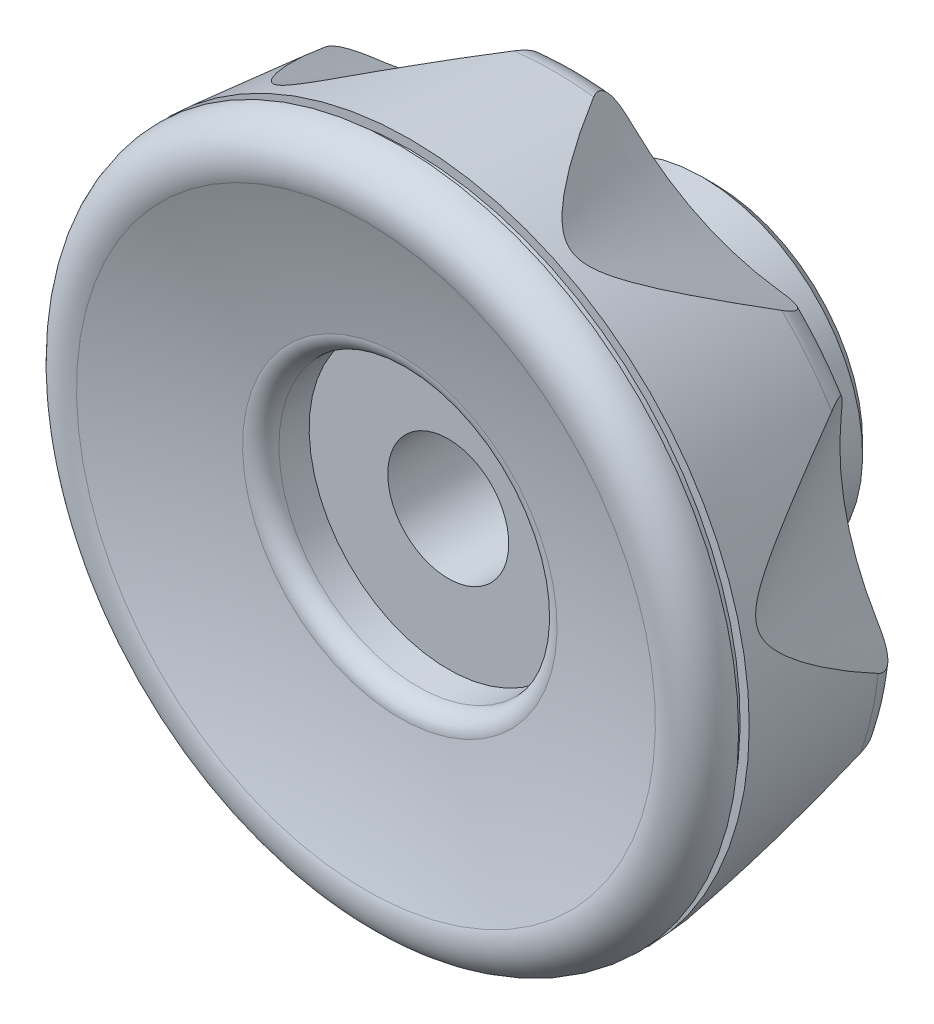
ISO-10303-21;
HEADER;
FILE_DESCRIPTION(('STEP AP214'),'2;1');
FILE_NAME('part.step','',(''),(''),'','','');
FILE_SCHEMA(('AUTOMOTIVE_DESIGN { 1 0 10303 214 1 1 1 1 }'));
ENDSEC;
DATA;
#1=APPLICATION_CONTEXT('core data for automotive mechanical design processes');
#2=APPLICATION_PROTOCOL_DEFINITION('international standard','automotive_design',2000,#1);
#3=PRODUCT_CONTEXT('',#1,'mechanical');
#4=PRODUCT('Part','Part','',(#3));
#5=PRODUCT_RELATED_PRODUCT_CATEGORY('part','',(#4));
#6=PRODUCT_DEFINITION_FORMATION('','',#4);
#7=PRODUCT_DEFINITION_CONTEXT('part definition',#1,'design');
#8=PRODUCT_DEFINITION('design','',#6,#7);
#9=PRODUCT_DEFINITION_SHAPE('','',#8);
#10=(LENGTH_UNIT() NAMED_UNIT(*) SI_UNIT(.MILLI.,.METRE.));
#11=(NAMED_UNIT(*) PLANE_ANGLE_UNIT() SI_UNIT($,.RADIAN.));
#12=(NAMED_UNIT(*) SI_UNIT($,.STERADIAN.) SOLID_ANGLE_UNIT());
#13=UNCERTAINTY_MEASURE_WITH_UNIT(LENGTH_MEASURE(1.E-05),#10,'distance_accuracy_value','');
#14=(GEOMETRIC_REPRESENTATION_CONTEXT(3) GLOBAL_UNCERTAINTY_ASSIGNED_CONTEXT((#13)) GLOBAL_UNIT_ASSIGNED_CONTEXT((#10,
#11,#12)) REPRESENTATION_CONTEXT('',''));
#15=CARTESIAN_POINT('',(0.,0.,0.));
#16=DIRECTION('',(0.,0.,1.));
#17=DIRECTION('',(1.,0.,0.));
#18=AXIS2_PLACEMENT_3D('',#15,#16,#17);
#19=CARTESIAN_POINT('',(0.,0.,13.5));
#20=DIRECTION('',(0.,0.,1.));
#21=DIRECTION('',(0.,1.,0.));
#22=AXIS2_PLACEMENT_3D('',#19,#20,#21);
#23=TOROIDAL_SURFACE('',#22,24.4738282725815,2.4999999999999);
#24=CARTESIAN_POINT('',(0.,0.,11.));
#25=DIRECTION('',(0.,0.,1.));
#26=DIRECTION('',(0.,1.,0.));
#27=AXIS2_PLACEMENT_3D('',#24,#25,#26);
#28=CIRCLE('',#27,24.4738282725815);
#29=CARTESIAN_POINT('',(-16.2379624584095,18.3111126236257,11.));
#30=VERTEX_POINT('',#29);
#31=CARTESIAN_POINT('',(-21.4653013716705,11.7562369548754,11.));
#32=VERTEX_POINT('',#31);
#33=EDGE_CURVE('E134',#30,#32,#28,.T.);
#34=ORIENTED_EDGE('',*,*,#33,.T.);
#35=CARTESIAN_POINT('',(-21.4653013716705,11.7562369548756,11.));
#36=CARTESIAN_POINT('',(-21.4754382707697,11.8601222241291,11.000030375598));
#37=CARTESIAN_POINT('',(-21.4872751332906,11.9639124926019,11.0020766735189));
#38=CARTESIAN_POINT('',(-21.5148402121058,12.1711325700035,11.0112222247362));
#39=CARTESIAN_POINT('',(-21.5305827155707,12.2745596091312,11.0183402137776));
#40=CARTESIAN_POINT('',(-21.5666560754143,12.4816775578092,11.0388207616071));
#41=CARTESIAN_POINT('',(-21.5870535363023,12.5853482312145,11.0522773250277));
#42=CARTESIAN_POINT('',(-21.6327777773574,12.79018793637,11.086761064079));
#43=CARTESIAN_POINT('',(-21.6580966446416,12.8913606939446,11.1077761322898));
#44=CARTESIAN_POINT('',(-21.7159025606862,13.096009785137,11.1604458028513));
#45=CARTESIAN_POINT('',(-21.7487343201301,13.1992460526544,11.1926745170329));
#46=CARTESIAN_POINT('',(-21.8208966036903,13.3985520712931,11.2692171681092));
#47=CARTESIAN_POINT('',(-21.8602062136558,13.494643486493,11.313492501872));
#48=CARTESIAN_POINT('',(-21.9242907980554,13.631369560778,11.3905180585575));
#49=CARTESIAN_POINT('',(-21.9466893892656,13.6760092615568,11.4182052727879));
#50=CARTESIAN_POINT('',(-21.9930436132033,13.7619364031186,11.4772174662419));
#51=CARTESIAN_POINT('',(-22.0169983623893,13.8032257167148,11.5085403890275));
#52=CARTESIAN_POINT('',(-22.0662965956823,13.8818232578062,11.574842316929));
#53=CARTESIAN_POINT('',(-22.0916394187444,13.919133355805,11.6098195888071));
#54=CARTESIAN_POINT('',(-22.1434758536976,13.9891694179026,11.6833341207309));
#55=CARTESIAN_POINT('',(-22.1699692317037,14.0218963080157,11.7218706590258));
#56=CARTESIAN_POINT('',(-22.2204575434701,14.0784837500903,11.7972787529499));
#57=CARTESIAN_POINT('',(-22.2443568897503,14.1029401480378,11.8337680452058));
#58=CARTESIAN_POINT('',(-22.2925479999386,14.147619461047,11.9090357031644));
#59=CARTESIAN_POINT('',(-22.3168398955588,14.1678409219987,11.9478148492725));
#60=CARTESIAN_POINT('',(-22.3655101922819,14.2038164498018,12.0272744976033));
#61=CARTESIAN_POINT('',(-22.3898884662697,14.2195754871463,12.0679528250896));
#62=CARTESIAN_POINT('',(-22.4384945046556,14.2465760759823,12.1508760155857));
#63=CARTESIAN_POINT('',(-22.4627222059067,14.2578158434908,12.1931214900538));
#64=CARTESIAN_POINT('',(-22.5288434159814,14.2825299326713,12.3109990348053));
#65=CARTESIAN_POINT('',(-22.5703388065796,14.2913426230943,12.3878768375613));
#66=CARTESIAN_POINT('',(-22.6510509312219,14.2958836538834,12.5432786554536));
#67=CARTESIAN_POINT('',(-22.6902625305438,14.2915835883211,12.6218058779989));
#68=CARTESIAN_POINT('',(-22.7755265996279,14.2684993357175,12.7992847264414));
#69=CARTESIAN_POINT('',(-22.8206927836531,14.246227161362,12.8982168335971));
#70=CARTESIAN_POINT('',(-22.8841902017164,14.2010917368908,13.044286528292));
#71=CARTESIAN_POINT('',(-22.9046065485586,14.184142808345,13.0924834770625));
#72=CARTESIAN_POINT('',(-22.9440559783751,14.146710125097,13.187982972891));
#73=CARTESIAN_POINT('',(-22.9630908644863,14.1262311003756,13.2352866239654));
#74=CARTESIAN_POINT('',(-22.9814573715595,14.1041446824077,13.2821097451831));
#75=B_SPLINE_CURVE_WITH_KNOTS('',3,(#35,#36,#37,#38,#39,#40,#41,#42,#43,#44,#45,#46,#47,#48,#49,
#50,#51,#52,#53,#54,#55,#56,#57,#58,#59,#60,#61,#62,#63,#64,#65,#66,#67,#68,#69,#70,#71,#72,#73,
#74),.UNSPECIFIED.,.F.,.F.,(4,2,2,2,2,2,2,2,2,2,2,2,2,2,2,2,2,2,2,4),(0.,0.313209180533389,
0.627581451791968,0.946770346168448,1.26545021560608,1.60369981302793,1.94087800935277,
2.11199734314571,2.28302035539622,2.45396261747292,2.62487029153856,2.77466826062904,
2.92451758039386,3.07419932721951,3.22394010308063,3.48614173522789,3.74891177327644,
4.08027673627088,4.24522540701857,4.40995475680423),.UNSPECIFIED.);
#76=CARTESIAN_POINT('',(-22.981457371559,14.1041446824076,13.282109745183));
#77=VERTEX_POINT('',#76);
#78=EDGE_CURVE('E119',#32,#77,#75,.T.);
#79=ORIENTED_EDGE('',*,*,#78,.T.);
#80=CARTESIAN_POINT('',(0.,0.,13.282109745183));
#81=DIRECTION('',(0.,0.,1.));
#82=DIRECTION('',(0.,1.,0.));
#83=AXIS2_PLACEMENT_3D('',#80,#81,#82);
#84=CIRCLE('',#83,26.9643149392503);
#85=CARTESIAN_POINT('',(-18.8643796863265,19.2667968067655,13.282109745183));
#86=VERTEX_POINT('',#85);
#87=EDGE_CURVE('E149',#86,#77,#84,.T.);
#88=ORIENTED_EDGE('',*,*,#87,.F.);
#89=CARTESIAN_POINT('',(-18.8643796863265,19.2667968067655,13.282109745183));
#90=CARTESIAN_POINT('',(-18.8981743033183,19.2226732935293,13.1915305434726));
#91=CARTESIAN_POINT('',(-18.9255552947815,19.1772447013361,13.0988167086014));
#92=CARTESIAN_POINT('',(-18.9651950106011,19.0843052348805,12.9100927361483));
#93=CARTESIAN_POINT('',(-18.9773008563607,19.0367781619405,12.8140590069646));
#94=CARTESIAN_POINT('',(-18.983341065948,18.9407957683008,12.6209607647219));
#95=CARTESIAN_POINT('',(-18.9771650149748,18.8923365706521,12.5238935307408));
#96=CARTESIAN_POINT('',(-18.9442986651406,18.7968510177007,12.3329550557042));
#97=CARTESIAN_POINT('',(-18.917699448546,18.7498192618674,12.2390715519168));
#98=CARTESIAN_POINT('',(-18.8474169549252,18.6641060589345,12.0674765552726));
#99=CARTESIAN_POINT('',(-18.8058006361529,18.6250650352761,11.9890989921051));
#100=CARTESIAN_POINT('',(-18.7069025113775,18.5516039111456,11.8403817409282));
#101=CARTESIAN_POINT('',(-18.6496092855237,18.5171872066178,11.7700479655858));
#102=CARTESIAN_POINT('',(-18.5279204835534,18.457227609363,11.6454449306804));
#103=CARTESIAN_POINT('',(-18.4646762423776,18.4311577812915,11.5902907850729));
#104=CARTESIAN_POINT('',(-18.3299240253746,18.3843608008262,11.4887242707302));
#105=CARTESIAN_POINT('',(-18.2584221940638,18.3636297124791,11.4423054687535));
#106=CARTESIAN_POINT('',(-18.0741590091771,18.3189481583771,11.3379996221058));
#107=CARTESIAN_POINT('',(-17.9578593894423,18.2981009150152,11.2850492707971));
#108=CARTESIAN_POINT('',(-17.7173155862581,18.2668011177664,11.1949523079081));
#109=CARTESIAN_POINT('',(-17.5930199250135,18.2564250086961,11.1579230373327));
#110=CARTESIAN_POINT('',(-17.3654004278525,18.2458816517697,11.1030967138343));
#111=CARTESIAN_POINT('',(-17.2626807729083,18.2441255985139,11.0829631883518));
#112=CARTESIAN_POINT('',(-17.0560091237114,18.2457463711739,11.0499258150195));
#113=CARTESIAN_POINT('',(-16.9520556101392,18.2491303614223,11.0370320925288));
#114=CARTESIAN_POINT('',(-16.7461255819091,18.260237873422,11.0174873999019));
#115=CARTESIAN_POINT('',(-16.6441552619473,18.2678653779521,11.0107067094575));
#116=CARTESIAN_POINT('',(-16.4406884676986,18.2868392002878,11.0019849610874));
#117=CARTESIAN_POINT('',(-16.3391915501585,18.2981729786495,11.000027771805));
#118=CARTESIAN_POINT('',(-16.2379624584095,18.3111126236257,11.));
#119=B_SPLINE_CURVE_WITH_KNOTS('',3,(#89,#90,#91,#92,#93,#94,#95,#96,#97,#98,#99,#100,#101,#102,
#103,#104,#105,#106,#107,#108,#109,#110,#111,#112,#113,#114,#115,#116,#117,#118),.UNSPECIFIED.,
.F.,.F.,(4,2,2,2,2,2,2,2,2,2,2,2,2,2,4),(0.,0.319088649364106,0.641346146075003,
0.96555390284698,1.28832411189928,1.57749027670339,1.86686764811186,2.12940978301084,
2.39175780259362,2.77800167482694,3.16704536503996,3.48068996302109,3.79477212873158,
4.10202079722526,4.40824052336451),.UNSPECIFIED.);
#120=EDGE_CURVE('E139',#86,#30,#119,.T.);
#121=ORIENTED_EDGE('',*,*,#120,.T.);
#122=EDGE_LOOP('',(#34,#79,#88,#121));
#123=FACE_BOUND('',#122,.T.);
#124=ADVANCED_FACE('F14',(#123),#23,.T.);
#125=CARTESIAN_POINT('',(-26.8251366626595,-2.73611461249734,13.282109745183));
#126=VERTEX_POINT('',#125);
#127=CARTESIAN_POINT('',(-25.355768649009,-9.17383651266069,13.282109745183));
#128=VERTEX_POINT('',#127);
#129=EDGE_CURVE('E156',#126,#128,#84,.T.);
#130=ORIENTED_EDGE('',*,*,#129,.F.);
#131=CARTESIAN_POINT('',(-26.8251366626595,-2.73611461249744,13.282109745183));
#132=CARTESIAN_POINT('',(-26.8117101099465,-2.79004686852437,13.1915305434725));
#133=CARTESIAN_POINT('',(-26.7932643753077,-2.83977845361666,13.0988167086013));
#134=CARTESIAN_POINT('',(-26.7453163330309,-2.92871684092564,12.9100927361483));
#135=CARTESIAN_POINT('',(-26.7157060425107,-2.96781421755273,12.8140590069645));
#136=CARTESIAN_POINT('',(-26.6444299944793,-3.0323806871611,12.620960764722));
#137=CARTESIAN_POINT('',(-26.602692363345,-3.0577658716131,12.5238935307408));
#138=CARTESIAN_POINT('',(-26.507546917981,-3.09160419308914,12.3329550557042));
#139=CARTESIAN_POINT('',(-26.4541916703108,-3.10013190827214,12.2390715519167));
#140=CARTESIAN_POINT('',(-26.3433579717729,-3.09862415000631,12.0674765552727));
#141=CARTESIAN_POINT('',(-26.2868871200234,-3.09042888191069,11.9890989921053));
#142=CARTESIAN_POINT('',(-26.1677909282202,-3.05890947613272,11.8403817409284));
#143=CARTESIAN_POINT('',(-26.1051611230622,-3.03557429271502,11.7700479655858));
#144=CARTESIAN_POINT('',(-25.9824110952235,-2.97781835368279,11.6454449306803));
#145=CARTESIAN_POINT('',(-25.9225967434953,-2.94462628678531,11.590290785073));
#146=CARTESIAN_POINT('',(-25.8019927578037,-2.86845020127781,11.4887242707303));
#147=CARTESIAN_POINT('',(-25.7412038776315,-2.82547344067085,11.4423054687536));
#148=CARTESIAN_POINT('',(-25.5913842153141,-2.70926917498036,11.3379996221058));
#149=CARTESIAN_POINT('',(-25.5025735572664,-2.63134051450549,11.2850492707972));
#150=CARTESIAN_POINT('',(-25.3281257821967,-2.46279090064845,11.194952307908));
#151=CARTESIAN_POINT('',(-25.2425163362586,-2.37208203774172,11.1579230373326));
#152=CARTESIAN_POINT('',(-25.0923547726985,-2.20069562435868,11.1030967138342));
#153=CARTESIAN_POINT('',(-25.0269371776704,-2.12148104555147,11.0829631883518));
#154=CARTESIAN_POINT('',(-24.8993466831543,-1.95888810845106,11.0499258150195));
#155=CARTESIAN_POINT('',(-24.8371784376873,-1.87550409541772,11.0370320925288));
#156=CARTESIAN_POINT('',(-24.7174673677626,-1.70757609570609,11.0174873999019));
#157=CARTESIAN_POINT('',(-24.6598533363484,-1.62309681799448,11.0107067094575));
#158=CARTESIAN_POINT('',(-24.5478281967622,-1.45219008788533,11.0019849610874));
#159=CARTESIAN_POINT('',(-24.4934070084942,-1.365770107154,11.000027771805));
#160=CARTESIAN_POINT('',(-24.4404083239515,-1.27855827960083,11.));
#161=B_SPLINE_CURVE_WITH_KNOTS('',3,(#131,#132,#133,#134,#135,#136,#137,#138,#139,#140,#141,
#142,#143,#144,#145,#146,#147,#148,#149,#150,#151,#152,#153,#154,#155,#156,#157,#158,#159,#160),
.UNSPECIFIED.,.F.,.F.,(4,2,2,2,2,2,2,2,2,2,2,2,2,2,4),(0.,0.319088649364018,0.641346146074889,
0.965553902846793,1.288324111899,1.57749027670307,1.8668676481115,2.12940978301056,
2.39175780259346,2.77800167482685,3.16704536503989,3.4806899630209,3.79477212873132,
4.10202079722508,4.40824052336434),.UNSPECIFIED.);
#162=CARTESIAN_POINT('',(-24.4404083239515,-1.27855827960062,11.));
#163=VERTEX_POINT('',#162);
#164=EDGE_CURVE('E34',#126,#163,#161,.T.);
#165=ORIENTED_EDGE('',*,*,#164,.T.);
#166=CARTESIAN_POINT('',(-22.5747926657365,-9.45235454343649,11.));
#167=VERTEX_POINT('',#166);
#168=EDGE_CURVE('E136',#163,#167,#28,.T.);
#169=ORIENTED_EDGE('',*,*,#168,.T.);
#170=CARTESIAN_POINT('',(-22.5747926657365,-9.45235454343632,11.));
#171=CARTESIAN_POINT('',(-22.6623336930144,-9.39550848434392,11.000030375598));
#172=CARTESIAN_POINT('',(-22.7508603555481,-9.34005074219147,11.0020766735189));
#173=CARTESIAN_POINT('',(-22.930058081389,-9.23240238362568,11.0112222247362));
#174=CARTESIAN_POINT('',(-23.0207358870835,-9.18022466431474,11.0183402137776));
#175=CARTESIAN_POINT('',(-23.2051585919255,-9.07929202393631,11.0388207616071));
#176=CARTESIAN_POINT('',(-23.2989291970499,-9.03060179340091,11.0522773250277));
#177=CARTESIAN_POINT('',(-23.4875879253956,-8.93863497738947,11.0867610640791));
#178=CARTESIAN_POINT('',(-23.5824740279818,-8.89534988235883,11.1077761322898));
#179=CARTESIAN_POINT('',(-23.7785165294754,-8.81294774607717,11.1604458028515));
#180=CARTESIAN_POINT('',(-23.8797001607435,-8.77424988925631,11.1926745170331));
#181=CARTESIAN_POINT('',(-24.0805163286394,-8.70640336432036,11.2692171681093));
#182=CARTESIAN_POINT('',(-24.1801527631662,-8.67722483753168,11.3134925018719));
#183=CARTESIAN_POINT('',(-24.3270055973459,-8.64208087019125,11.3905180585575));
#184=CARTESIAN_POINT('',(-24.3758716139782,-8.63176039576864,11.4182052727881));
#185=CARTESIAN_POINT('',(-24.4719535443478,-8.6144268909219,11.4772174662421));
#186=CARTESIAN_POINT('',(-24.5191703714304,-8.60741200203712,11.5085403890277));
#187=CARTESIAN_POINT('',(-24.611357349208,-8.59695014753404,11.5748423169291));
#188=CARTESIAN_POINT('',(-24.6563285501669,-8.59350149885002,11.6098195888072));
#189=CARTESIAN_POINT('',(-24.7434044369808,-8.59036208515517,11.683334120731));
#190=CARTESIAN_POINT('',(-24.785509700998,-8.59067055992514,11.721870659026));
#191=CARTESIAN_POINT('',(-24.8612304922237,-8.594862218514,11.79727875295));
#192=CARTESIAN_POINT('',(-24.8952522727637,-8.59829916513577,11.8337680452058));
#193=CARTESIAN_POINT('',(-24.960230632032,-8.60811939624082,11.9090357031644));
#194=CARTESIAN_POINT('',(-24.9911861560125,-8.61450369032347,11.9478148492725));
#195=CARTESIAN_POINT('',(-25.0496583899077,-8.63012528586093,12.0272744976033));
#196=CARTESIAN_POINT('',(-25.0771789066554,-8.63935938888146,12.0679528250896));
#197=CARTESIAN_POINT('',(-25.1285941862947,-8.66052652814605,12.1508760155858));
#198=CARTESIAN_POINT('',(-25.152487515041,-8.67246062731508,12.1931214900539));
#199=CARTESIAN_POINT('',(-25.2130356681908,-8.70874728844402,12.3109990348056));
#200=CARTESIAN_POINT('',(-25.2457976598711,-8.73569506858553,12.3878768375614));
#201=CARTESIAN_POINT('',(-25.2996711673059,-8.79596706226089,12.5432786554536));
#202=CARTESIAN_POINT('',(-25.3207572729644,-8.82930497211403,12.621805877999));
#203=CARTESIAN_POINT('',(-25.3558705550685,-8.91035990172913,12.7992847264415));
#204=CARTESIAN_POINT('',(-25.3666181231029,-8.9595587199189,12.8982168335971));
#205=CARTESIAN_POINT('',(-25.3709198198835,-9.03734447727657,13.0442865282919));
#206=CARTESIAN_POINT('',(-25.3703979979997,-9.0638741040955,13.0924834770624));
#207=CARTESIAN_POINT('',(-25.3657282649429,-9.11805580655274,13.1879829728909));
#208=CARTESIAN_POINT('',(-25.3615851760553,-9.14570634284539,13.2352866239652));
#209=CARTESIAN_POINT('',(-25.355768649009,-9.17383651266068,13.282109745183));
#210=B_SPLINE_CURVE_WITH_KNOTS('',3,(#170,#171,#172,#173,#174,#175,#176,#177,#178,#179,#180,
#181,#182,#183,#184,#185,#186,#187,#188,#189,#190,#191,#192,#193,#194,#195,#196,#197,#198,#199,
#200,#201,#202,#203,#204,#205,#206,#207,#208,#209),.UNSPECIFIED.,.F.,.F.,(4,2,2,2,2,2,2,2,2,2,2,
2,2,2,2,2,2,2,2,4),(0.,0.313209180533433,0.627581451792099,0.946770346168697,1.26545021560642,
1.60369981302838,1.9408780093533,2.11199734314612,2.28302035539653,2.45396261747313,
2.62487029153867,2.77466826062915,2.92451758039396,3.07419932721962,3.22394010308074,
3.48614173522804,3.74891177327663,4.08027673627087,4.24522540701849,4.40995475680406),.UNSPECIFIED.);
#211=EDGE_CURVE('E315',#167,#128,#210,.T.);
#212=ORIENTED_EDGE('',*,*,#211,.T.);
#213=EDGE_LOOP('',(#130,#165,#169,#212));
#214=FACE_BOUND('',#213,.T.);
#215=ADVANCED_FACE('F424',(#214),#23,.T.);
#216=CARTESIAN_POINT('',(-14.586018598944,-22.6786759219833,13.282109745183));
#217=VERTEX_POINT('',#216);
#218=CARTESIAN_POINT('',(-8.63666897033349,-25.543731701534,13.282109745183));
#219=VERTEX_POINT('',#218);
#220=EDGE_CURVE('E160',#217,#219,#84,.T.);
#221=ORIENTED_EDGE('',*,*,#220,.F.);
#222=CARTESIAN_POINT('',(-14.586018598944,-22.6786759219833,13.282109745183));
#223=CARTESIAN_POINT('',(-14.5354813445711,-22.7018048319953,13.1915305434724));
#224=CARTESIAN_POINT('',(-14.4850988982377,-22.7183905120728,13.0988167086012));
#225=CARTESIAN_POINT('',(-14.3856689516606,-22.736355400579,12.9100927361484));
#226=CARTESIAN_POINT('',(-14.336639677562,-22.7375819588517,12.8140590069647));
#227=CARTESIAN_POINT('',(-14.2417196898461,-22.7221126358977,12.620960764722));
#228=CARTESIAN_POINT('',(-14.1958497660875,-22.7053082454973,12.5238935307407));
#229=CARTESIAN_POINT('',(-14.1100716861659,-22.6520183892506,12.3329550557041));
#230=CARTESIAN_POINT('',(-14.070137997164,-22.6156205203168,12.2390715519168));
#231=CARTESIAN_POINT('',(-14.0022131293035,-22.5280271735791,12.0674765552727));
#232=CARTESIAN_POINT('',(-13.9734114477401,-22.4787668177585,11.9890989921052));
#233=CARTESIAN_POINT('',(-13.9237990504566,-22.3660016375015,11.8403817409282));
#234=CARTESIAN_POINT('',(-13.9029941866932,-22.3024864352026,11.7700479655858));
#235=CARTESIAN_POINT('',(-13.8716162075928,-22.1705063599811,11.6454449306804));
#236=CARTESIAN_POINT('',(-13.8602731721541,-22.1030467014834,11.590290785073));
#237=CARTESIAN_POINT('',(-13.8446346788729,-21.9612596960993,11.4887242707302));
#238=CARTESIAN_POINT('',(-13.8403340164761,-21.8869374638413,11.4423054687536));
#239=CARTESIAN_POINT('',(-13.8377751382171,-21.6973515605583,11.3379996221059));
#240=CARTESIAN_POINT('',(-13.8433296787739,-21.5793288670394,11.2850492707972));
#241=CARTESIAN_POINT('',(-13.8663406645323,-21.3378511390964,11.194952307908));
#242=CARTESIAN_POINT('',(-13.8838830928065,-21.2143629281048,11.1579230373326));
#243=CARTESIAN_POINT('',(-13.9242541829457,-20.9901042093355,11.1030967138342));
#244=CARTESIAN_POINT('',(-13.9453994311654,-20.8895691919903,11.0829631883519));
#245=CARTESIAN_POINT('',(-13.9929683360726,-20.6884398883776,11.0499258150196));
#246=CARTESIAN_POINT('',(-14.0193993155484,-20.5878457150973,11.0370320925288));
#247=CARTESIAN_POINT('',(-14.0760520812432,-20.3895504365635,11.0174873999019));
#248=CARTESIAN_POINT('',(-14.1061788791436,-20.2918340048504,11.0107067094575));
#249=CARTESIAN_POINT('',(-14.1699526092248,-20.097690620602,11.0019849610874));
#250=CARTESIAN_POINT('',(-14.2035874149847,-20.001260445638,11.000027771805));
#251=CARTESIAN_POINT('',(-14.238728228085,-19.9054487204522,11.));
#252=B_SPLINE_CURVE_WITH_KNOTS('',3,(#222,#223,#224,#225,#226,#227,#228,#229,#230,#231,#232,
#233,#234,#235,#236,#237,#238,#239,#240,#241,#242,#243,#244,#245,#246,#247,#248,#249,#250,#251),
.UNSPECIFIED.,.F.,.F.,(4,2,2,2,2,2,2,2,2,2,2,2,2,2,4),(0.,0.319088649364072,0.641346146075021,
0.965553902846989,1.28832411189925,1.5774902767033,1.86686764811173,2.12940978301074,
2.39175780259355,2.77800167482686,3.16704536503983,3.48068996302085,3.79477212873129,
4.10202079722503,4.40824052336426),.UNSPECIFIED.);
#253=CARTESIAN_POINT('',(-14.238728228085,-19.905448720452,11.));
#254=VERTEX_POINT('',#253);
#255=EDGE_CURVE('E42',#217,#254,#252,.T.);
#256=ORIENTED_EDGE('',*,*,#255,.T.);
#257=CARTESIAN_POINT('',(-6.685004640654,-23.5431302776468,11.));
#258=VERTEX_POINT('',#257);
#259=EDGE_CURVE('E146',#254,#258,#28,.T.);
#260=ORIENTED_EDGE('',*,*,#259,.T.);
#261=CARTESIAN_POINT('',(-6.685004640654,-23.5431302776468,11.));
#262=CARTESIAN_POINT('',(-6.78402961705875,-23.5761296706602,11.000030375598));
#263=CARTESIAN_POINT('',(-6.88258369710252,-23.6107652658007,11.0020766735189));
#264=CARTESIAN_POINT('',(-7.07847452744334,-23.6837500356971,11.0112222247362));
#265=CARTESIAN_POINT('',(-7.17580539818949,-23.7221125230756,11.0183402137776));
#266=CARTESIAN_POINT('',(-7.36970338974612,-23.8033695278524,11.0388207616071));
#267=CARTESIAN_POINT('',(-7.46623596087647,-23.8463244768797,11.0522773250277));
#268=CARTESIAN_POINT('',(-7.65576530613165,-23.9364834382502,11.0867610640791));
#269=CARTESIAN_POINT('',(-7.74876747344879,-23.9836805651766,11.1077761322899));
#270=CARTESIAN_POINT('',(-7.93542255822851,-24.0855758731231,11.1604458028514));
#271=CARTESIAN_POINT('',(-8.02876472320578,-24.1405567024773,11.192674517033));
#272=CARTESIAN_POINT('',(-8.2070161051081,-24.2552594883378,11.2692171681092));
#273=CARTESIAN_POINT('',(-8.29195109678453,-24.3149658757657,11.313492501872));
#274=CARTESIAN_POINT('',(-8.41098900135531,-24.4078681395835,11.3905180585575));
#275=CARTESIAN_POINT('',(-8.44952533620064,-24.4396384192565,11.418205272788));
#276=CARTESIAN_POINT('',(-8.52298331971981,-24.5039510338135,11.477217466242));
#277=CARTESIAN_POINT('',(-8.55790699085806,-24.5364929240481,11.5085403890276));
#278=CARTESIAN_POINT('',(-8.62356403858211,-24.602044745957,11.5748423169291));
#279=CARTESIAN_POINT('',(-8.65429938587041,-24.6350544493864,11.6098195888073));
#280=CARTESIAN_POINT('',(-8.71104480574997,-24.7011757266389,11.683334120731));
#281=CARTESIAN_POINT('',(-8.73705583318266,-24.7342872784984,11.7218706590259));
#282=CARTESIAN_POINT('',(-8.78098980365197,-24.796101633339,11.7972787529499));
#283=CARTESIAN_POINT('',(-8.79951492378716,-24.824843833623,11.8337680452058));
#284=CARTESIAN_POINT('',(-8.8323505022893,-24.8817687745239,11.9090357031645));
#285=CARTESIAN_POINT('',(-8.84665951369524,-24.9099513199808,11.9478148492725));
#286=CARTESIAN_POINT('',(-8.87090290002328,-24.9654066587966,12.0272744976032));
#287=CARTESIAN_POINT('',(-8.88084214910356,-24.9926804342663,12.0679528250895));
#288=CARTESIAN_POINT('',(-8.89634991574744,-25.0460760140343,12.1508760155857));
#289=CARTESIAN_POINT('',(-8.90191670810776,-25.0721973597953,12.1931214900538));
#290=CARTESIAN_POINT('',(-8.91129781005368,-25.1421601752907,12.3109990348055));
#291=CARTESIAN_POINT('',(-8.91065595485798,-25.1845761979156,12.3878768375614));
#292=CARTESIAN_POINT('',(-8.8971229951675,-25.2642751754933,12.5432786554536));
#293=CARTESIAN_POINT('',(-8.88420533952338,-25.3015468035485,12.621805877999));
#294=CARTESIAN_POINT('',(-8.84272681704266,-25.3795363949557,12.7992847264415));
#295=CARTESIAN_POINT('',(-8.81096263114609,-25.4186141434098,12.8982168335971));
#296=CARTESIAN_POINT('',(-8.75282934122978,-25.4704759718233,13.044286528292));
#297=CARTESIAN_POINT('',(-8.73176229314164,-25.486608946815,13.0924834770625));
#298=CARTESIAN_POINT('',(-8.68648980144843,-25.5167397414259,13.187982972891));
#299=CARTESIAN_POINT('',(-8.66228856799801,-25.5307403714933,13.2352866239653));
#300=CARTESIAN_POINT('',(-8.63666897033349,-25.5437317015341,13.2821097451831));
#301=B_SPLINE_CURVE_WITH_KNOTS('',3,(#261,#262,#263,#264,#265,#266,#267,#268,#269,#270,#271,
#272,#273,#274,#275,#276,#277,#278,#279,#280,#281,#282,#283,#284,#285,#286,#287,#288,#289,#290,
#291,#292,#293,#294,#295,#296,#297,#298,#299,#300),.UNSPECIFIED.,.F.,.F.,(4,2,2,2,2,2,2,2,2,2,2,
2,2,2,2,2,2,2,2,4),(0.,0.313209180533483,0.627581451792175,0.946770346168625,1.26545021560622,
1.60369981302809,1.940878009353,2.11199734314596,2.28302035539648,2.45396261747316,
2.62487029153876,2.77466826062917,2.92451758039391,3.07419932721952,3.22394010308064,
3.48614173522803,3.74891177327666,4.0802767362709,4.24522540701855,4.40995475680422),.UNSPECIFIED.);
#302=EDGE_CURVE('E331',#258,#219,#301,.T.);
#303=ORIENTED_EDGE('',*,*,#302,.T.);
#304=EDGE_LOOP('',(#221,#256,#260,#303));
#305=FACE_BOUND('',#304,.T.);
#306=ADVANCED_FACE('F451',(#305),#23,.T.);
#307=CARTESIAN_POINT('',(8.636668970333,-25.5437317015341,13.282109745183));
#308=VERTEX_POINT('',#307);
#309=CARTESIAN_POINT('',(14.586018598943,-22.6786759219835,13.282109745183));
#310=VERTEX_POINT('',#309);
#311=EDGE_CURVE('E459',#308,#310,#84,.T.);
#312=ORIENTED_EDGE('',*,*,#311,.F.);
#313=CARTESIAN_POINT('',(8.636668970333,-25.5437317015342,13.2821097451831));
#314=CARTESIAN_POINT('',(8.68626134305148,-25.5186407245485,13.1915305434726));
#315=CARTESIAN_POINT('',(8.73064149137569,-25.4895911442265,13.0988167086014));
#316=CARTESIAN_POINT('',(8.80668056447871,-25.4230546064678,12.9100927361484));
#317=CARTESIAN_POINT('',(8.83820877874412,-25.3854867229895,12.8140590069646));
#318=CARTESIAN_POINT('',(8.88529601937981,-25.3016303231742,12.6209607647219));
#319=CARTESIAN_POINT('',(8.90075724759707,-25.2552904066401,12.5238935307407));
#320=CARTESIAN_POINT('',(8.91257531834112,-25.1550007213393,12.3329550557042));
#321=CARTESIAN_POINT('',(8.90901656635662,-25.1010856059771,12.2390715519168));
#322=CARTESIAN_POINT('',(8.88288379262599,-24.9933662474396,12.0674765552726));
#323=CARTESIAN_POINT('',(8.8623280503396,-24.9401348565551,11.9890989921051));
#324=CARTESIAN_POINT('',(8.80509750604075,-24.8310383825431,11.8403817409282));
#325=CARTESIAN_POINT('',(8.76841094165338,-24.7751714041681,11.7700479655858));
#326=CARTESIAN_POINT('',(8.68478861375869,-24.6683508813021,11.6454449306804));
#327=CARTESIAN_POINT('',(8.63911879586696,-24.6174221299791,11.5902907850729));
#328=CARTESIAN_POINT('',(8.53801569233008,-24.5167927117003,11.4887242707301));
#329=CARTESIAN_POINT('',(8.48258965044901,-24.4670911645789,11.4423054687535));
#330=CARTESIAN_POINT('',(8.33596085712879,-24.3468856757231,11.3379996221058));
#331=CARTESIAN_POINT('',(8.24022380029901,-24.277642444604,11.285049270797));
#332=CARTESIAN_POINT('',(8.03708179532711,-24.1450742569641,11.194952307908));
#333=CARTESIAN_POINT('',(7.9295972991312,-24.081795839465,11.1579230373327));
#334=CARTESIAN_POINT('',(7.72909380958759,-23.9735362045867,11.1030967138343));
#335=CARTESIAN_POINT('',(7.63730852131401,-23.9273856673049,11.0829631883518));
#336=CARTESIAN_POINT('',(7.45040057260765,-23.8391744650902,11.0499258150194));
#337=CARTESIAN_POINT('',(7.35527343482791,-23.7971195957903,11.0370320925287));
#338=CARTESIAN_POINT('',(7.16491752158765,-23.7177774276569,11.0174873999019));
#339=CARTESIAN_POINT('',(7.06973598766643,-23.6804063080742,11.0107067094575));
#340=CARTESIAN_POINT('',(6.87818630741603,-23.6092201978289,11.0019849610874));
#341=CARTESIAN_POINT('',(6.78182320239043,-23.5753937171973,11.000027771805));
#342=CARTESIAN_POINT('',(6.6850046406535,-23.543130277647,11.));
#343=B_SPLINE_CURVE_WITH_KNOTS('',3,(#313,#314,#315,#316,#317,#318,#319,#320,#321,#322,#323,
#324,#325,#326,#327,#328,#329,#330,#331,#332,#333,#334,#335,#336,#337,#338,#339,#340,#341,#342),
.UNSPECIFIED.,.F.,.F.,(4,2,2,2,2,2,2,2,2,2,2,2,2,2,4),(0.,0.319088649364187,0.641346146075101,
0.965553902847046,1.28832411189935,1.57749027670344,1.86686764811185,2.12940978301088,
2.39175780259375,2.77800167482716,3.16704536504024,3.48068996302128,3.79477212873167,
4.1020207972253,4.40824052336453),.UNSPECIFIED.);
#344=CARTESIAN_POINT('',(6.685004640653,-23.5431302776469,11.));
#345=VERTEX_POINT('',#344);
#346=EDGE_CURVE('E324',#308,#345,#343,.T.);
#347=ORIENTED_EDGE('',*,*,#346,.T.);
#348=CARTESIAN_POINT('',(14.2387282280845,-19.9054487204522,11.));
#349=VERTEX_POINT('',#348);
#350=EDGE_CURVE('E453',#345,#349,#28,.T.);
#351=ORIENTED_EDGE('',*,*,#350,.T.);
#352=CARTESIAN_POINT('',(14.2387282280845,-19.9054487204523,11.));
#353=CARTESIAN_POINT('',(14.202787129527,-20.0034443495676,11.000030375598));
#354=CARTESIAN_POINT('',(14.168418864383,-20.1020919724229,11.0020766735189));
#355=CARTESIAN_POINT('',(14.1033447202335,-20.3007508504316,11.0112222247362));
#356=CARTESIAN_POINT('',(14.0726529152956,-20.4007658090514,11.0183402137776));
#357=CARTESIAN_POINT('',(14.0152887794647,-20.6030242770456,11.038820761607));
#358=CARTESIAN_POINT('',(13.9886852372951,-20.7052784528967,11.0522773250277));
#359=CARTESIAN_POINT('',(13.9410047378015,-20.9096716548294,11.086761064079));
#360=CARTESIAN_POINT('',(13.9199190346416,-21.0118106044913,11.1077761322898));
#361=CARTESIAN_POINT('',(13.8832064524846,-21.2212741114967,11.1604458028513));
#362=CARTESIAN_POINT('',(13.8679943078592,-21.3285319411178,11.1926745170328));
#363=CARTESIAN_POINT('',(13.8465346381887,-21.5394105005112,11.269217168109));
#364=CARTESIAN_POINT('',(13.8402588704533,-21.6430416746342,11.3134925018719));
#365=CARTESIAN_POINT('',(13.8386738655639,-21.7940328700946,11.3905180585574));
#366=CARTESIAN_POINT('',(13.8394858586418,-21.843970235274,11.4182052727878));
#367=CARTESIAN_POINT('',(13.8439671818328,-21.9415002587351,11.4772174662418));
#368=CARTESIAN_POINT('',(13.8476349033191,-21.9890942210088,11.5085403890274));
#369=CARTESIAN_POINT('',(13.8579488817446,-22.0812978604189,11.5748423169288));
#370=CARTESIAN_POINT('',(13.8645937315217,-22.1259089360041,11.609819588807));
#371=CARTESIAN_POINT('',(13.8809092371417,-22.2115002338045,11.6833341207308));
#372=CARTESIAN_POINT('',(13.8905792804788,-22.2524811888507,11.7218706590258));
#373=CARTESIAN_POINT('',(13.9115153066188,-22.3253707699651,11.7972787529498));
#374=CARTESIAN_POINT('',(13.9224366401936,-22.3577747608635,11.8337680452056));
#375=CARTESIAN_POINT('',(13.9464697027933,-22.4189387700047,11.9090357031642));
#376=CARTESIAN_POINT('',(13.9595821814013,-22.4476975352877,11.9478148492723));
#377=CARTESIAN_POINT('',(13.9878234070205,-22.5012276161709,12.0272744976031));
#378=CARTESIAN_POINT('',(14.0029498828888,-22.5260033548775,12.0679528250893));
#379=CARTESIAN_POINT('',(14.0350272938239,-22.5714194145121,12.1508760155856));
#380=CARTESIAN_POINT('',(14.0519789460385,-22.5920581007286,12.1931214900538));
#381=CARTESIAN_POINT('',(14.1008290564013,-22.6430136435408,12.3109990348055));
#382=CARTESIAN_POINT('',(14.1343914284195,-22.6689577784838,12.3878768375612));
#383=CARTESIAN_POINT('',(14.2051402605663,-22.7080687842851,12.5432786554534));
#384=CARTESIAN_POINT('',(14.2423344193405,-22.7212078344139,12.6218058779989));
#385=CARTESIAN_POINT('',(14.3291705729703,-22.7374043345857,12.7992847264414));
#386=CARTESIAN_POINT('',(14.3795274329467,-22.7369346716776,12.898216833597));
#387=CARTESIAN_POINT('',(14.4563201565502,-22.7238195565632,13.0442865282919));
#388=CARTESIAN_POINT('',(14.4820685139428,-22.7174074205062,13.0924834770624));
#389=CARTESIAN_POINT('',(14.5338526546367,-22.7007982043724,13.1879829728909));
#390=CARTESIAN_POINT('',(14.5598880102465,-22.6906061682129,13.2352866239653));
#391=CARTESIAN_POINT('',(14.586018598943,-22.6786759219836,13.2821097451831));
#392=B_SPLINE_CURVE_WITH_KNOTS('',3,(#352,#353,#354,#355,#356,#357,#358,#359,#360,#361,#362,
#363,#364,#365,#366,#367,#368,#369,#370,#371,#372,#373,#374,#375,#376,#377,#378,#379,#380,#381,
#382,#383,#384,#385,#386,#387,#388,#389,#390,#391),.UNSPECIFIED.,.F.,.F.,(4,2,2,2,2,2,2,2,2,2,2,
2,2,2,2,2,2,2,2,4),(0.,0.313209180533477,0.627581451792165,0.946770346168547,1.26545021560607,
1.60369981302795,1.94087800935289,2.11199734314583,2.28302035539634,2.45396261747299,
2.62487029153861,2.77466826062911,2.9245175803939,3.07419932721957,3.22394010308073,
3.48614173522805,3.74891177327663,4.08027673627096,4.24522540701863,4.40995475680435),.UNSPECIFIED.);
#393=EDGE_CURVE('E347',#349,#310,#392,.T.);
#394=ORIENTED_EDGE('',*,*,#393,.T.);
#395=EDGE_LOOP('',(#312,#347,#351,#394));
#396=FACE_BOUND('',#395,.T.);
#397=ADVANCED_FACE('F432',(#396),#23,.T.);
#398=CARTESIAN_POINT('',(25.3557686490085,-9.17383651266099,13.282109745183));
#399=VERTEX_POINT('',#398);
#400=CARTESIAN_POINT('',(26.825136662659,-2.73611461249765,13.282109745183));
#401=VERTEX_POINT('',#400);
#402=EDGE_CURVE('E166',#399,#401,#84,.T.);
#403=ORIENTED_EDGE('',*,*,#402,.F.);
#404=CARTESIAN_POINT('',(25.3557686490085,-9.17383651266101,13.282109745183));
#405=CARTESIAN_POINT('',(25.3670720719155,-9.11941966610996,13.1915305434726));
#406=CARTESIAN_POINT('',(25.3720307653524,-9.06660975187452,13.0988167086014));
#407=CARTESIAN_POINT('',(25.3674199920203,-8.96567515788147,12.9100927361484));
#408=CARTESIAN_POINT('',(25.3577057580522,-8.91760221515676,12.8140590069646));
#409=CARTESIAN_POINT('',(25.3215025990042,-8.82850431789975,12.6209607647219));
#410=CARTESIAN_POINT('',(25.294912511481,-8.78752377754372,12.5238935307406));
#411=CARTESIAN_POINT('',(25.2238713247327,-8.71575444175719,12.3329550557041));
#412=CARTESIAN_POINT('',(25.1794999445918,-8.68492126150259,12.2390715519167));
#413=CARTESIAN_POINT('',(25.0789880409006,-8.63819076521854,12.0674765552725));
#414=CARTESIAN_POINT('',(25.0245537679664,-8.62107266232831,11.989098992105));
#415=CARTESIAN_POINT('',(24.9035760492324,-8.59779676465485,11.8403817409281));
#416=CARTESIAN_POINT('',(24.8370237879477,-8.59164698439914,11.7700479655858));
#417=CARTESIAN_POINT('',(24.7013704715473,-8.5904240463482,11.6454449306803));
#418=CARTESIAN_POINT('',(24.633078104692,-8.59437659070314,11.5902907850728));
#419=CARTESIAN_POINT('',(24.4913661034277,-8.61068076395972,11.4887242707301));
#420=CARTESIAN_POINT('',(24.4179502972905,-8.62302618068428,11.4423054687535));
#421=CARTESIAN_POINT('',(24.2325483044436,-8.66271829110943,11.3379996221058));
#422=CARTESIAN_POINT('',(24.1187206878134,-8.69439608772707,11.285049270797));
#423=CARTESIAN_POINT('',(23.8884177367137,-8.77056398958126,11.1949523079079));
#424=CARTESIAN_POINT('',(23.771929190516,-8.815145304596,11.1579230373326));
#425=CARTESIAN_POINT('',(23.5622765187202,-8.90440646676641,11.1030967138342));
#426=CARTESIAN_POINT('',(23.4689673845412,-8.94739270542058,11.0829631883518));
#427=CARTESIAN_POINT('',(23.2834658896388,-9.03852443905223,11.0499258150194));
#428=CARTESIAN_POINT('',(23.1912752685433,-9.08667704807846,11.0370320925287));
#429=CARTESIAN_POINT('',(23.0105580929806,-9.18603426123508,11.0174873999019));
#430=CARTESIAN_POINT('',(22.9219954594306,-9.23714966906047,11.0107067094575));
#431=CARTESIAN_POINT('',(22.746910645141,-9.342525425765,11.0019849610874));
#432=CARTESIAN_POINT('',(22.6603826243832,-9.39677466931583,11.000027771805));
#433=CARTESIAN_POINT('',(22.5747926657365,-9.45235454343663,11.));
#434=B_SPLINE_CURVE_WITH_KNOTS('',3,(#404,#405,#406,#407,#408,#409,#410,#411,#412,#413,#414,
#415,#416,#417,#418,#419,#420,#421,#422,#423,#424,#425,#426,#427,#428,#429,#430,#431,#432,#433),
.UNSPECIFIED.,.F.,.F.,(4,2,2,2,2,2,2,2,2,2,2,2,2,2,4),(0.,0.319088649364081,0.641346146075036,
0.965553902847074,1.28832411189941,1.5774902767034,1.86686764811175,2.12940978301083,
2.39175780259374,2.77800167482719,3.1670453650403,3.48068996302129,3.79477212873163,
4.10202079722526,4.40824052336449),.UNSPECIFIED.);
#435=CARTESIAN_POINT('',(22.574792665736,-9.45235454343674,11.));
#436=VERTEX_POINT('',#435);
#437=EDGE_CURVE('E340',#399,#436,#434,.T.);
#438=ORIENTED_EDGE('',*,*,#437,.T.);
#439=CARTESIAN_POINT('',(24.440408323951,-1.27855827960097,11.));
#440=VERTEX_POINT('',#439);
#441=EDGE_CURVE('E155',#436,#440,#28,.T.);
#442=ORIENTED_EDGE('',*,*,#441,.T.);
#443=CARTESIAN_POINT('',(24.4404083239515,-1.2785582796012,11.));
#444=CARTESIAN_POINT('',(24.4946154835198,-1.36775743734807,11.000030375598));
#445=CARTESIAN_POINT('',(24.5503130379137,-1.45613341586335,11.0020766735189));
#446=CARTESIAN_POINT('',(24.6650577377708,-1.6308722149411,11.0112222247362));
#447=CARTESIAN_POINT('',(24.724116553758,-1.71722634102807,11.0183402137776));
#448=CARTESIAN_POINT('',(24.8464826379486,-1.88818152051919,11.038820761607));
#449=CARTESIAN_POINT('',(24.9098411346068,-1.97273544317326,11.0522773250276));
#450=CARTESIAN_POINT('',(25.0399138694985,-2.13745063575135,11.086761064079));
#451=CARTESIAN_POINT('',(25.1066225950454,-2.21761869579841,11.1077761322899));
#452=CARTESIAN_POINT('',(25.2474978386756,-2.37692010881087,11.1604458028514));
#453=CARTESIAN_POINT('',(25.3218707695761,-2.45568760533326,11.1926745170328));
#454=CARTESIAN_POINT('',(25.4733623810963,-2.60394608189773,11.269217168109));
#455=CARTESIAN_POINT('',(25.5504716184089,-2.67346565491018,11.3134925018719));
#456=CARTESIAN_POINT('',(25.667533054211,-2.76884633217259,11.3905180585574));
#457=CARTESIAN_POINT('',(25.7070819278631,-2.7993469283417,11.4182052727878));
#458=CARTESIAN_POINT('',(25.7861280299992,-2.85665226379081,11.4772174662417));
#459=CARTESIAN_POINT('',(25.8256252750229,-2.88345907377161,11.5085403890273));
#460=CARTESIAN_POINT('',(25.9041436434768,-2.93288330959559,11.5748423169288));
#461=CARTESIAN_POINT('',(25.9431649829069,-2.95550270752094,11.6098195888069));
#462=CARTESIAN_POINT('',(26.0202555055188,-2.99611203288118,11.6833341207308));
#463=CARTESIAN_POINT('',(26.0583248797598,-3.01410289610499,11.7218706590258));
#464=CARTESIAN_POINT('',(26.1283656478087,-3.04318036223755,11.7972787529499));
#465=CARTESIAN_POINT('',(26.1605094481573,-3.05484527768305,11.8337680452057));
#466=CARTESIAN_POINT('',(26.2233137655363,-3.074190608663,11.9090357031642));
#467=CARTESIAN_POINT('',(26.2539737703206,-3.08186965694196,11.9478148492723));
#468=CARTESIAN_POINT('',(26.3134333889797,-3.09316523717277,12.0272744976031));
#469=CARTESIAN_POINT('',(26.3422350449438,-3.09678630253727,12.0679528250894));
#470=CARTESIAN_POINT('',(26.3977426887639,-3.10002362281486,12.1508760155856));
#471=CARTESIAN_POINT('',(26.4244478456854,-3.09963829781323,12.1931214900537));
#472=CARTESIAN_POINT('',(26.4947440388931,-3.09321600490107,12.3109990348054));
#473=CARTESIAN_POINT('',(26.5359537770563,-3.08315178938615,12.3878768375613));
#474=CARTESIAN_POINT('',(26.6106431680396,-3.05222343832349,12.5432786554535));
#475=CARTESIAN_POINT('',(26.6441058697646,-3.03133593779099,12.6218058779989));
#476=CARTESIAN_POINT('',(26.7109102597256,-2.9735430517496,12.7992847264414));
#477=CARTESIAN_POINT('',(26.7419400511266,-2.93387964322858,12.8982168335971));
#478=CARTESIAN_POINT('',(26.7795657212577,-2.86566353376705,13.044286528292));
#479=CARTESIAN_POINT('',(26.7906063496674,-2.84153475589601,13.0924834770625));
#480=CARTESIAN_POINT('',(26.8099076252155,-2.79069260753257,13.1879829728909));
#481=CARTESIAN_POINT('',(26.818171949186,-2.7639827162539,13.2352866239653));
#482=CARTESIAN_POINT('',(26.825136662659,-2.73611461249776,13.282109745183));
#483=B_SPLINE_CURVE_WITH_KNOTS('',3,(#443,#444,#445,#446,#447,#448,#449,#450,#451,#452,#453,
#454,#455,#456,#457,#458,#459,#460,#461,#462,#463,#464,#465,#466,#467,#468,#469,#470,#471,#472,
#473,#474,#475,#476,#477,#478,#479,#480,#481,#482),.UNSPECIFIED.,.F.,.F.,(4,2,2,2,2,2,2,2,2,2,2,
2,2,2,2,2,2,2,2,4),(0.,0.313209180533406,0.627581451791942,0.946770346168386,1.26545021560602,
1.60369981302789,1.94087800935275,2.11199734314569,2.2830203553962,2.45396261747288,
2.62487029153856,2.77466826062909,2.9245175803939,3.07419932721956,3.22394010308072,
3.48614173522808,3.74891177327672,4.08027673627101,4.2452254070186,4.40995475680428),.UNSPECIFIED.);
#484=EDGE_CURVE('E387',#440,#401,#483,.T.);
#485=ORIENTED_EDGE('',*,*,#484,.T.);
#486=EDGE_LOOP('',(#403,#438,#442,#485));
#487=FACE_BOUND('',#486,.T.);
#488=ADVANCED_FACE('F426',(#487),#23,.T.);
#489=CARTESIAN_POINT('',(22.981457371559,14.1041446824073,13.282109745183));
#490=VERTEX_POINT('',#489);
#491=CARTESIAN_POINT('',(18.864379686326,19.2667968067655,13.282109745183));
#492=VERTEX_POINT('',#491);
#493=EDGE_CURVE('E162',#490,#492,#84,.T.);
#494=ORIENTED_EDGE('',*,*,#493,.F.);
#495=CARTESIAN_POINT('',(22.981457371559,14.1041446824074,13.282109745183));
#496=CARTESIAN_POINT('',(22.9459601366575,14.1469104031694,13.1915305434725));
#497=CARTESIAN_POINT('',(22.9077633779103,14.1837137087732,13.0988167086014));
#498=CARTESIAN_POINT('',(22.8259747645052,14.2430405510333,12.9100927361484));
#499=CARTESIAN_POINT('',(22.7823330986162,14.2654186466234,12.8140590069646));
#500=CARTESIAN_POINT('',(22.6901012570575,14.2926655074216,12.6209607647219));
#501=CARTESIAN_POINT('',(22.6414827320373,14.2974274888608,12.5238935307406));
#502=CARTESIAN_POINT('',(22.5410777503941,14.2866327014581,12.3329550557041));
#503=CARTESIAN_POINT('',(22.4893062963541,14.2711659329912,12.2390715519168));
#504=CARTESIAN_POINT('',(22.390102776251,14.2217185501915,12.0674765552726));
#505=CARTESIAN_POINT('',(22.3427800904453,14.1898330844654,11.989098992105));
#506=CARTESIAN_POINT('',(22.2491538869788,14.1097611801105,11.8403817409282));
#507=CARTESIAN_POINT('',(22.2028511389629,14.0615628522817,11.7700479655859));
#508=CARTESIAN_POINT('',(22.1173165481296,13.9562673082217,11.6454449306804));
#509=CARTESIAN_POINT('',(22.0778271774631,13.9004098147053,11.5902907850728));
#510=CARTESIAN_POINT('',(22.0022183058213,13.7794494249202,11.48872427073));
#511=CARTESIAN_POINT('',(21.9660963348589,13.7143533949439,11.4423054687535));
#512=CARTESIAN_POINT('',(21.8815326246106,13.5446526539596,11.3379996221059));
#513=CARTESIAN_POINT('',(21.8353289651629,13.4359078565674,11.285049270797));
#514=CARTESIAN_POINT('',(21.7512878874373,13.2083598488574,11.1949523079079));
#515=CARTESIAN_POINT('',(21.7135135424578,13.089489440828,11.1579230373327));
#516=CARTESIAN_POINT('',(21.6525844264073,12.8699229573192,11.1030967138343));
#517=CARTESIAN_POINT('',(21.6280151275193,12.7701694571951,11.0829631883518));
#518=CARTESIAN_POINT('',(21.5836064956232,12.5683188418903,11.0499258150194));
#519=CARTESIAN_POINT('',(21.5637738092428,12.4662186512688,11.0370320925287));
#520=CARTESIAN_POINT('',(21.5287790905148,12.2629800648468,11.0174873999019));
#521=CARTESIAN_POINT('',(21.5135248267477,12.1618690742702,11.0107067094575));
#522=CARTESIAN_POINT('',(21.4867473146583,11.959281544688,11.0019849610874));
#523=CARTESIAN_POINT('',(21.475211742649,11.8578073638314,11.000027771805));
#524=CARTESIAN_POINT('',(21.4653013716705,11.7562369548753,11.));
#525=B_SPLINE_CURVE_WITH_KNOTS('',3,(#495,#496,#497,#498,#499,#500,#501,#502,#503,#504,#505,
#506,#507,#508,#509,#510,#511,#512,#513,#514,#515,#516,#517,#518,#519,#520,#521,#522,#523,#524),
.UNSPECIFIED.,.F.,.F.,(4,2,2,2,2,2,2,2,2,2,2,2,2,2,4),(0.,0.31908864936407,0.641346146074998,
0.965553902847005,1.28832411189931,1.57749027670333,1.86686764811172,2.12940978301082,
2.39175780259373,2.77800167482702,3.16704536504,3.48068996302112,3.7947721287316,
4.10202079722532,4.40824052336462),.UNSPECIFIED.);
#526=CARTESIAN_POINT('',(21.4653013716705,11.7562369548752,11.));
#527=VERTEX_POINT('',#526);
#528=EDGE_CURVE('E381',#490,#527,#525,.T.);
#529=ORIENTED_EDGE('',*,*,#528,.T.);
#530=CARTESIAN_POINT('',(16.237962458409,18.3111126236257,11.));
#531=VERTEX_POINT('',#530);
#532=EDGE_CURVE('E148',#527,#531,#28,.T.);
#533=ORIENTED_EDGE('',*,*,#532,.T.);
#534=CARTESIAN_POINT('',(16.237962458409,18.3111126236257,11.));
#535=CARTESIAN_POINT('',(16.3414987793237,18.2978787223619,11.000030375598));
#536=CARTESIAN_POINT('',(16.4453207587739,18.28632330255,11.0020766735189));
#537=CARTESIAN_POINT('',(16.6534792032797,18.2670864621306,11.0112222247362));
#538=CARTESIAN_POINT('',(16.7578161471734,18.259419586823,11.0183402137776));
#539=CARTESIAN_POINT('',(16.9677682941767,18.2485004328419,11.038820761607));
#540=CARTESIAN_POINT('',(17.0733785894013,18.2453175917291,11.0522773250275));
#541=CARTESIAN_POINT('',(17.2832571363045,18.2443143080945,11.086761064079));
#542=CARTESIAN_POINT('',(17.3875272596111,18.2464853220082,11.1077761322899));
#543=CARTESIAN_POINT('',(17.5999083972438,18.2573032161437,11.1604458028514));
#544=CARTESIAN_POINT('',(17.7078620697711,18.2663395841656,11.1926745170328));
#545=CARTESIAN_POINT('',(17.9182286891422,18.2923428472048,11.269217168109));
#546=CARTESIAN_POINT('',(18.0206581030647,18.3092845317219,11.3134925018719));
#547=CARTESIAN_POINT('',(18.1682163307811,18.3413379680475,11.3905180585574));
#548=CARTESIAN_POINT('',(18.2167209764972,18.3532417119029,11.4182052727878));
#549=CARTESIAN_POINT('',(18.3108085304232,18.3793131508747,11.4772174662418));
#550=CARTESIAN_POINT('',(18.3563930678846,18.3934795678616,11.5085403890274));
#551=CARTESIAN_POINT('',(18.4439898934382,18.4240521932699,11.5748423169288));
#552=CARTESIAN_POINT('',(18.4860038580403,18.4404573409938,11.609819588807));
#553=CARTESIAN_POINT('',(18.5658186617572,18.4754096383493,11.6833341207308));
#554=CARTESIAN_POINT('',(18.6036203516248,18.493956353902,11.7218706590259));
#555=CARTESIAN_POINT('',(18.6700237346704,18.5305869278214,11.7972787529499));
#556=CARTESIAN_POINT('',(18.6991850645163,18.5484450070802,11.8337680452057));
#557=CARTESIAN_POINT('',(18.7534677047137,18.5854857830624,11.9090357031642));
#558=CARTESIAN_POINT('',(18.7785876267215,18.6046689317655,11.9478148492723));
#559=CARTESIAN_POINT('',(18.8244913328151,18.6441136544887,12.027274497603));
#560=CARTESIAN_POINT('',(18.8452799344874,18.6643739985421,12.0679528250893));
#561=CARTESIAN_POINT('',(18.8824194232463,18.7057531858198,12.1508760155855));
#562=CARTESIAN_POINT('',(18.8987685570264,18.726872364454,12.1931214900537));
#563=CARTESIAN_POINT('',(18.9375763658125,18.7858363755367,12.3109990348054));
#564=CARTESIAN_POINT('',(18.9554016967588,18.8243303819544,12.3878768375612));
#565=CARTESIAN_POINT('',(18.9777890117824,18.9020084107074,12.5432786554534));
#566=CARTESIAN_POINT('',(18.982322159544,18.9411937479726,12.6218058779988));
#567=CARTESIAN_POINT('',(18.9787897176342,19.029456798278,12.7992847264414));
#568=CARTESIAN_POINT('',(18.967126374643,19.0784465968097,12.8982168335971));
#569=CARTESIAN_POINT('',(18.9372520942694,19.1503955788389,13.0442865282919));
#570=CARTESIAN_POINT('',(18.9252711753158,19.1740715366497,13.0924834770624));
#571=CARTESIAN_POINT('',(18.8975553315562,19.2208614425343,13.1879829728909));
#572=CARTESIAN_POINT('',(18.8818254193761,19.2439760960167,13.2352866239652));
#573=CARTESIAN_POINT('',(18.8643796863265,19.2667968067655,13.282109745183));
#574=B_SPLINE_CURVE_WITH_KNOTS('',3,(#534,#535,#536,#537,#538,#539,#540,#541,#542,#543,#544,
#545,#546,#547,#548,#549,#550,#551,#552,#553,#554,#555,#556,#557,#558,#559,#560,#561,#562,#563,
#564,#565,#566,#567,#568,#569,#570,#571,#572,#573),.UNSPECIFIED.,.F.,.F.,(4,2,2,2,2,2,2,2,2,2,2,
2,2,2,2,2,2,2,2,4),(0.,0.313209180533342,0.627581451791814,0.94677034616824,1.26545021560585,
1.603699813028,1.94087800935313,2.11199734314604,2.28302035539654,2.4539626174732,
2.62487029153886,2.77466826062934,2.92451758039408,3.07419932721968,3.2239401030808,
3.48614173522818,3.74891177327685,4.08027673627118,4.24522540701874,4.40995475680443),.UNSPECIFIED.);
#575=EDGE_CURVE('E403',#531,#492,#574,.T.);
#576=ORIENTED_EDGE('',*,*,#575,.T.);
#577=EDGE_LOOP('',(#494,#529,#533,#576));
#578=FACE_BOUND('',#577,.T.);
#579=ADVANCED_FACE('F417',(#578),#23,.T.);
#580=CARTESIAN_POINT('',(-13.25,0.,11.));
#581=DIRECTION('',(0.,0.,1.));
#582=DIRECTION('',(0.,1.,0.));
#583=AXIS2_PLACEMENT_3D('',#580,#581,#582);
#584=PLANE('',#583);
#585=ORIENTED_EDGE('',*,*,#168,.F.);
#586=CARTESIAN_POINT('',(-42.5181882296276,9.70449900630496,11.));
#587=DIRECTION('',(0.,0.,-1.));
#588=DIRECTION('',(0.781831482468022,-0.623489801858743,0.));
#589=AXIS2_PLACEMENT_3D('',#586,#587,#588);
#590=CIRCLE('',#589,21.1526280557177);
#591=EDGE_CURVE('E122',#32,#163,#590,.T.);
#592=ORIENTED_EDGE('',*,*,#591,.F.);
#593=ORIENTED_EDGE('',*,*,#33,.F.);
#594=CARTESIAN_POINT('',(-18.9223739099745,39.2927142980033,11.));
#595=DIRECTION('',(0.,0.,-1.));
#596=DIRECTION('',(0.,-1.,0.));
#597=AXIS2_PLACEMENT_3D('',#594,#595,#596);
#598=CIRCLE('',#597,21.1526280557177);
#599=CARTESIAN_POINT('',(-4.19200033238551,24.1121422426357,11.));
#600=VERTEX_POINT('',#599);
#601=EDGE_CURVE('E409',#600,#30,#598,.T.);
#602=ORIENTED_EDGE('',*,*,#601,.F.);
#603=CARTESIAN_POINT('',(4.19200033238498,24.1121422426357,11.));
#604=VERTEX_POINT('',#603);
#605=EDGE_CURVE('E142',#604,#600,#28,.T.);
#606=ORIENTED_EDGE('',*,*,#605,.F.);
#607=CARTESIAN_POINT('',(18.922373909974,39.2927142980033,11.));
#608=DIRECTION('',(0.,0.,-1.));
#609=DIRECTION('',(-0.781831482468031,-0.623489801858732,0.));
#610=AXIS2_PLACEMENT_3D('',#607,#608,#609);
#611=CIRCLE('',#610,21.1526280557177);
#612=EDGE_CURVE('E395',#531,#604,#611,.T.);
#613=ORIENTED_EDGE('',*,*,#612,.F.);
#614=ORIENTED_EDGE('',*,*,#532,.F.);
#615=CARTESIAN_POINT('',(42.5181882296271,9.70449900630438,11.));
#616=DIRECTION('',(0.,0.,-1.));
#617=DIRECTION('',(-0.974927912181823,0.222520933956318,0.));
#618=AXIS2_PLACEMENT_3D('',#615,#616,#617);
#619=CIRCLE('',#618,21.1526280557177);
#620=EDGE_CURVE('E388',#440,#527,#619,.T.);
#621=ORIENTED_EDGE('',*,*,#620,.F.);
#622=ORIENTED_EDGE('',*,*,#441,.F.);
#623=CARTESIAN_POINT('',(34.096939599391,-27.1914019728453,11.));
#624=DIRECTION('',(0.,0.,-1.));
#625=DIRECTION('',(-0.433883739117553,0.900968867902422,0.));
#626=AXIS2_PLACEMENT_3D('',#623,#624,#625);
#627=CIRCLE('',#626,21.1526280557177);
#628=EDGE_CURVE('E338',#349,#436,#627,.T.);
#629=ORIENTED_EDGE('',*,*,#628,.F.);
#630=ORIENTED_EDGE('',*,*,#350,.F.);
#631=CARTESIAN_POINT('',(-4.9960036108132E-13,-43.6116226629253,11.));
#632=DIRECTION('',(0.,0.,-1.));
#633=DIRECTION('',(0.433883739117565,0.900968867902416,0.));
#634=AXIS2_PLACEMENT_3D('',#631,#632,#633);
#635=CIRCLE('',#634,21.1526280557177);
#636=EDGE_CURVE('E322',#258,#345,#635,.T.);
#637=ORIENTED_EDGE('',*,*,#636,.F.);
#638=ORIENTED_EDGE('',*,*,#259,.F.);
#639=CARTESIAN_POINT('',(-34.0969395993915,-27.1914019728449,11.));
#640=DIRECTION('',(0.,0.,-1.));
#641=DIRECTION('',(0.974927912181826,0.222520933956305,0.));
#642=AXIS2_PLACEMENT_3D('',#639,#640,#641);
#643=CIRCLE('',#642,21.1526280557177);
#644=EDGE_CURVE('E127',#167,#254,#643,.T.);
#645=ORIENTED_EDGE('',*,*,#644,.F.);
#646=EDGE_LOOP('',(#585,#592,#593,#602,#606,#613,#614,#621,#622,#629,#630,#637,#638,#645));
#647=FACE_BOUND('',#646,.T.);
#648=CARTESIAN_POINT('',(0.,0.,11.));
#649=DIRECTION('',(0.,0.,1.));
#650=DIRECTION('',(0.,1.,0.));
#651=AXIS2_PLACEMENT_3D('',#648,#649,#650);
#652=CIRCLE('',#651,13.25);
#653=CARTESIAN_POINT('',(0.,13.25,11.));
#654=VERTEX_POINT('',#653);
#655=EDGE_CURVE('E204',#654,#654,#652,.T.);
#656=ORIENTED_EDGE('',*,*,#655,.T.);
#657=EDGE_LOOP('',(#656));
#658=FACE_BOUND('',#657,.T.);
#659=ADVANCED_FACE('F16',(#647,#658),#584,.F.);
#660=CARTESIAN_POINT('',(3.30163995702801,26.761417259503,13.282109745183));
#661=VERTEX_POINT('',#660);
#662=CARTESIAN_POINT('',(-3.30163995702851,26.761417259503,13.282109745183));
#663=VERTEX_POINT('',#662);
#664=EDGE_CURVE('E157',#661,#663,#84,.T.);
#665=ORIENTED_EDGE('',*,*,#664,.F.);
#666=CARTESIAN_POINT('',(3.30163995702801,26.7614172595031,13.282109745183));
#667=CARTESIAN_POINT('',(3.24607220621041,26.7603283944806,13.1915305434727));
#668=CARTESIAN_POINT('',(3.19348293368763,26.7534114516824,13.0988167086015));
#669=CARTESIAN_POINT('',(3.09610497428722,26.7264562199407,12.9100927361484));
#670=CARTESIAN_POINT('',(3.0513989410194,26.7062883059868,12.8140590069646));
#671=CARTESIAN_POINT('',(2.97259087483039,26.6511666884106,12.6209607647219));
#672=CARTESIAN_POINT('',(2.9385546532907,26.6161242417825,12.5238935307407));
#673=CARTESIAN_POINT('',(2.88439287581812,26.5308940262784,12.3329550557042));
#674=CARTESIAN_POINT('',(2.86420630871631,26.4807741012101,12.2390715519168));
#675=CARTESIAN_POINT('',(2.84101344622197,26.3723837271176,12.0674765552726));
#676=CARTESIAN_POINT('',(2.83643729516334,26.3155050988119,11.9890989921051));
#677=CARTESIAN_POINT('',(2.84066504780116,26.1923811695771,11.8403817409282));
#678=CARTESIAN_POINT('',(2.84947872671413,26.1261290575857,11.7700479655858));
#679=CARTESIAN_POINT('',(2.8784721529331,25.9936047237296,11.6454449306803));
#680=CARTESIAN_POINT('',(2.89752208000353,25.9279041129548,11.5902907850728));
#681=CARTESIAN_POINT('',(2.94495136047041,25.7933731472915,11.4887242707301));
#682=CARTESIAN_POINT('',(2.97332380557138,25.7245451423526,11.4423054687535));
#683=CARTESIAN_POINT('',(3.05327657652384,25.5526238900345,11.3379996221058));
#684=CARTESIAN_POINT('',(3.10948917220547,25.4486991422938,11.285049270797));
#685=CARTESIAN_POINT('',(3.23499461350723,25.241119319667,11.1949523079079));
#686=CARTESIAN_POINT('',(3.30437932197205,25.1374716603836,11.1579230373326));
#687=CARTESIAN_POINT('',(3.4380546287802,24.9529378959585,11.1030967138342));
#688=CARTESIAN_POINT('',(3.50072634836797,24.8715335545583,11.0829631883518));
#689=CARTESIAN_POINT('',(3.63085118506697,24.7109616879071,11.0499258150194));
#690=CARTESIAN_POINT('',(3.69831085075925,24.6317974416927,11.0370320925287));
#691=CARTESIAN_POINT('',(3.83539032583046,24.4777202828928,11.0174873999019));
#692=CARTESIAN_POINT('',(3.90493120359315,24.4027523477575,11.0107067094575));
#693=CARTESIAN_POINT('',(4.04662500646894,24.2555055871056,11.0019849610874));
#694=CARTESIAN_POINT('',(4.11876840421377,24.1832185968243,11.000027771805));
#695=CARTESIAN_POINT('',(4.19200033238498,24.1121422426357,11.));
#696=B_SPLINE_CURVE_WITH_KNOTS('',3,(#666,#667,#668,#669,#670,#671,#672,#673,#674,#675,#676,
#677,#678,#679,#680,#681,#682,#683,#684,#685,#686,#687,#688,#689,#690,#691,#692,#693,#694,#695),
.UNSPECIFIED.,.F.,.F.,(4,2,2,2,2,2,2,2,2,2,2,2,2,2,4),(0.,0.319088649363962,0.64134614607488,
0.965553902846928,1.28832411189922,1.57749027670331,1.86686764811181,2.12940978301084,
2.39175780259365,2.77800167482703,3.16704536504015,3.48068996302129,3.79477212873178,
4.10202079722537,4.40824052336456),.UNSPECIFIED.);
#697=EDGE_CURVE('E397',#661,#604,#696,.T.);
#698=ORIENTED_EDGE('',*,*,#697,.T.);
#699=ORIENTED_EDGE('',*,*,#605,.T.);
#700=CARTESIAN_POINT('',(-4.19200033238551,24.1121422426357,11.));
#701=CARTESIAN_POINT('',(-4.11709981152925,24.1848389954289,11.000030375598));
#702=CARTESIAN_POINT('',(-4.04333347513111,24.2588056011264,11.0020766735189));
#703=CARTESIAN_POINT('',(-3.89850884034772,24.4095564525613,11.0112222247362));
#704=CARTESIAN_POINT('',(-3.82746161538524,24.4863501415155,11.0183402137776));
#705=CARTESIAN_POINT('',(-3.68802165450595,24.6436893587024,11.0388207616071));
#706=CARTESIAN_POINT('',(-3.61968626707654,24.724274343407,11.0522773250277));
#707=CARTESIAN_POINT('',(-3.48804473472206,24.887738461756,11.0867610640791));
#708=CARTESIAN_POINT('',(-3.4247307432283,24.9706137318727,11.1077761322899));
#709=CARTESIAN_POINT('',(-3.30077104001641,25.1434048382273,11.1604458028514));
#710=CARTESIAN_POINT('',(-3.24052794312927,25.2334405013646,11.1926745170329));
#711=CARTESIAN_POINT('',(-3.12969667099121,25.4141245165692,11.2692171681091));
#712=CARTESIAN_POINT('',(-3.07907851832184,25.5047700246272,11.313492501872));
#713=CARTESIAN_POINT('',(-3.01213785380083,25.6401206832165,11.3905180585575));
#714=CARTESIAN_POINT('',(-2.99120242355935,25.6854650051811,11.4182052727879));
#715=CARTESIAN_POINT('',(-2.95292326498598,25.7752808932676,11.4772174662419));
#716=CARTESIAN_POINT('',(-2.9355775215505,25.8197529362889,11.5085403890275));
#717=CARTESIAN_POINT('',(-2.90486443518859,25.9073006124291,11.574842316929));
#718=CARTESIAN_POINT('',(-2.89149521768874,25.9503768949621,11.6098195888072));
#719=CARTESIAN_POINT('',(-2.86905830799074,26.0345710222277,11.6833341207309));
#720=CARTESIAN_POINT('',(-2.85998974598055,26.0756892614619,11.7218706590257));
#721=CARTESIAN_POINT('',(-2.84722684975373,26.1504443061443,11.7972787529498));
#722=CARTESIAN_POINT('',(-2.84300706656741,26.184377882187,11.8337680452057));
#723=CARTESIAN_POINT('',(-2.83812203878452,26.2499123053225,11.9090357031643));
#724=CARTESIAN_POINT('',(-2.837458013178,26.2815123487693,11.9478148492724));
#725=CARTESIAN_POINT('',(-2.83967664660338,26.3419946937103,12.0272744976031));
#726=CARTESIAN_POINT('',(-2.84255534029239,26.3708799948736,12.0679528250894));
#727=CARTESIAN_POINT('',(-2.85175079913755,26.425716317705,12.1508760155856));
#728=CARTESIAN_POINT('',(-2.85806891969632,26.4516661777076,12.1931214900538));
#729=CARTESIAN_POINT('',(-2.87997256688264,26.518770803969,12.3109990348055));
#730=CARTESIAN_POINT('',(-2.89895448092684,26.556707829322,12.3878768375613));
#731=CARTESIAN_POINT('',(-2.94572734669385,26.6226423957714,12.5432786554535));
#732=CARTESIAN_POINT('',(-2.97353730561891,26.6506182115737,12.6218058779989));
#733=CARTESIAN_POINT('',(-3.04474657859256,26.702887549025,12.7992847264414));
#734=CARTESIAN_POINT('',(-3.09032032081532,26.724313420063,12.898216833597));
#735=CARTESIAN_POINT('',(-3.16519860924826,26.7458162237,13.0442865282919));
#736=CARTESIAN_POINT('',(-3.19117919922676,26.7512108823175,13.0924834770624));
#737=CARTESIAN_POINT('',(-3.24504156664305,26.758714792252,13.1879829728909));
#738=CARTESIAN_POINT('',(-3.27292077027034,26.7608284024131,13.2352866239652));
#739=CARTESIAN_POINT('',(-3.30163995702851,26.7614172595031,13.282109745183));
#740=B_SPLINE_CURVE_WITH_KNOTS('',3,(#700,#701,#702,#703,#704,#705,#706,#707,#708,#709,#710,
#711,#712,#713,#714,#715,#716,#717,#718,#719,#720,#721,#722,#723,#724,#725,#726,#727,#728,#729,
#730,#731,#732,#733,#734,#735,#736,#737,#738,#739),.UNSPECIFIED.,.F.,.F.,(4,2,2,2,2,2,2,2,2,2,2,
2,2,2,2,2,2,2,2,4),(0.,0.313209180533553,0.627581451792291,0.946770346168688,1.26545021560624,
1.60369981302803,1.9408780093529,2.11199734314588,2.28302035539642,2.45396261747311,
2.62487029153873,2.77466826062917,2.92451758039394,3.07419932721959,3.22394010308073,
3.48614173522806,3.74891177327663,4.0802767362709,4.24522540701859,4.40995475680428),.UNSPECIFIED.);
#741=EDGE_CURVE('E207',#600,#663,#740,.T.);
#742=ORIENTED_EDGE('',*,*,#741,.T.);
#743=EDGE_LOOP('',(#665,#698,#699,#742));
#744=FACE_BOUND('',#743,.T.);
#745=ADVANCED_FACE('F219',(#744),#23,.T.);
#746=CARTESIAN_POINT('',(0.,0.,25.119995));
#747=DIRECTION('',(0.,0.,1.));
#748=DIRECTION('',(0.,1.,0.));
#749=AXIS2_PLACEMENT_3D('',#746,#747,#748);
#750=CONICAL_SURFACE('',#749,28.,0.0872668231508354);
#751=CARTESIAN_POINT('',(-26.8251366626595,-2.73611461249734,13.2821097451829));
#752=CARTESIAN_POINT('',(-26.850573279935,-2.63425454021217,13.4532141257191));
#753=CARTESIAN_POINT('',(-26.8754397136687,-2.53188163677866,13.6240984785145));
#754=CARTESIAN_POINT('',(-26.9240309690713,-2.32596818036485,13.9655815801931));
#755=CARTESIAN_POINT('',(-26.9477545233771,-2.22242648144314,14.1361798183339));
#756=CARTESIAN_POINT('',(-26.9940220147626,-2.01417082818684,14.4770104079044));
#757=CARTESIAN_POINT('',(-27.0165649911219,-1.90945600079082,14.6472423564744));
#758=CARTESIAN_POINT('',(-27.0604320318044,-1.69884315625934,14.9872560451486));
#759=CARTESIAN_POINT('',(-27.0817554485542,-1.59294454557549,15.1570375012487));
#760=CARTESIAN_POINT('',(-27.1231430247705,-1.37994704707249,15.4960622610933));
#761=CARTESIAN_POINT('',(-27.1432068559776,-1.27284785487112,15.6653054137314));
#762=CARTESIAN_POINT('',(-27.183026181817,-1.05191481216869,16.0118008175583));
#763=CARTESIAN_POINT('',(-27.2027134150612,-0.938016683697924,16.1890199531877));
#764=CARTESIAN_POINT('',(-27.2405989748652,-0.708822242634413,16.5426492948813));
#765=CARTESIAN_POINT('',(-27.2587976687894,-0.593526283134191,16.719059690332));
#766=CARTESIAN_POINT('',(-27.2936508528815,-0.361476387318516,17.070948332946));
#767=CARTESIAN_POINT('',(-27.310306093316,-0.24472319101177,17.246426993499));
#768=CARTESIAN_POINT('',(-27.3420115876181,-0.00967775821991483,17.5963153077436));
#769=CARTESIAN_POINT('',(-27.3570629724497,0.108613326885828,17.7707256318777));
#770=CARTESIAN_POINT('',(-27.3854924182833,0.346843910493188,18.1183224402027));
#771=CARTESIAN_POINT('',(-27.3988719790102,0.466781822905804,18.2915098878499));
#772=CARTESIAN_POINT('',(-27.4238501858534,0.708175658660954,18.6360852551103));
#773=CARTESIAN_POINT('',(-27.435454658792,0.829625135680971,18.8074772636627));
#774=CARTESIAN_POINT('',(-27.4568390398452,1.07465268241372,19.1488531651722));
#775=CARTESIAN_POINT('',(-27.4666189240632,1.19823077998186,19.318837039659));
#776=CARTESIAN_POINT('',(-27.4842432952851,1.44793396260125,19.6573232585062));
#777=CARTESIAN_POINT('',(-27.4920855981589,1.57406175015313,19.8258237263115));
#778=CARTESIAN_POINT('',(-27.5056827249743,1.82939736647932,20.1611869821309));
#779=CARTESIAN_POINT('',(-27.5114326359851,1.95861169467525,20.3280450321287));
#780=CARTESIAN_POINT('',(-27.5206337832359,2.22082342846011,20.6598449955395));
#781=CARTESIAN_POINT('',(-27.5240763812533,2.35383312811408,20.8247774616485));
#782=CARTESIAN_POINT('',(-27.5283008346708,2.62072301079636,21.1475667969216));
#783=CARTESIAN_POINT('',(-27.5291428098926,2.75451072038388,21.3054989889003));
#784=CARTESIAN_POINT('',(-27.5279718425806,3.02682820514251,21.617239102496));
#785=CARTESIAN_POINT('',(-27.5259587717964,3.16535819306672,21.7710468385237));
#786=CARTESIAN_POINT('',(-27.5185651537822,3.44798840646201,22.0725078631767));
#787=CARTESIAN_POINT('',(-27.5131956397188,3.59206893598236,22.2201796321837));
#788=CARTESIAN_POINT('',(-27.5020387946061,3.81369406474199,22.4351377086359));
#789=CARTESIAN_POINT('',(-27.4978166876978,3.88829933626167,22.5055362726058));
#790=CARTESIAN_POINT('',(-27.4882008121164,4.03975111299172,22.6437891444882));
#791=CARTESIAN_POINT('',(-27.4828072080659,4.11659730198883,22.7116438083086));
#792=CARTESIAN_POINT('',(-27.47069170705,4.27270240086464,22.8440275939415));
#793=CARTESIAN_POINT('',(-27.4639729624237,4.35195521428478,22.9085641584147));
#794=CARTESIAN_POINT('',(-27.4489868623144,4.51342048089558,23.0336070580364));
#795=CARTESIAN_POINT('',(-27.4407200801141,4.59563182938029,23.0941148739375));
#796=CARTESIAN_POINT('',(-27.4245556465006,4.7434759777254,23.1961554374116));
#797=CARTESIAN_POINT('',(-27.417038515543,4.80839699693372,23.2387765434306));
#798=CARTESIAN_POINT('',(-27.4008081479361,4.94042009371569,23.3203478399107));
#799=CARTESIAN_POINT('',(-27.3920943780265,5.00752313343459,23.3592963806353));
#800=CARTESIAN_POINT('',(-27.3733493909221,5.14381784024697,23.4325619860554));
#801=CARTESIAN_POINT('',(-27.3633217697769,5.2130034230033,23.4668911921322));
#802=CARTESIAN_POINT('',(-27.3417843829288,5.35363304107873,23.5300330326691));
#803=CARTESIAN_POINT('',(-27.3302750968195,5.42507633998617,23.5588474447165));
#804=CARTESIAN_POINT('',(-27.3084883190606,5.55335072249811,23.6039774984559));
#805=CARTESIAN_POINT('',(-27.2985367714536,5.60976139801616,23.6216434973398));
#806=CARTESIAN_POINT('',(-27.2776543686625,5.72361302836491,23.6525345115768));
#807=CARTESIAN_POINT('',(-27.2667236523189,5.78105383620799,23.6657601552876));
#808=CARTESIAN_POINT('',(-27.2438891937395,5.89664609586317,23.6873163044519));
#809=CARTESIAN_POINT('',(-27.23198575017,5.95479732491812,23.6956483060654));
#810=CARTESIAN_POINT('',(-27.2072486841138,6.07142011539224,23.7071016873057));
#811=CARTESIAN_POINT('',(-27.1944150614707,6.12989167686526,23.7102230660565));
#812=CARTESIAN_POINT('',(-27.1678719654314,6.24683465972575,23.7111271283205));
#813=CARTESIAN_POINT('',(-27.1541603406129,6.30530570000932,23.708896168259));
#814=CARTESIAN_POINT('',(-27.1260122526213,6.42162568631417,23.6991603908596));
#815=CARTESIAN_POINT('',(-27.11157578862,6.4794746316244,23.6916555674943));
#816=CARTESIAN_POINT('',(-27.0821076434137,6.59416969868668,23.6716633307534));
#817=CARTESIAN_POINT('',(-27.0670757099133,6.65101538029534,23.6591737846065));
#818=CARTESIAN_POINT('',(-27.0365513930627,6.76339439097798,23.6296492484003));
#819=CARTESIAN_POINT('',(-27.0210588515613,6.81892725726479,23.6126126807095));
#820=CARTESIAN_POINT('',(-26.9824586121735,6.95392386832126,23.5656541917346));
#821=CARTESIAN_POINT('',(-26.9591544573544,7.03252944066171,23.5334220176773));
#822=CARTESIAN_POINT('',(-26.9120921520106,7.18632419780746,23.4619189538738));
#823=CARTESIAN_POINT('',(-26.8883337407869,7.26151133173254,23.4226439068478));
#824=CARTESIAN_POINT('',(-26.8404651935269,7.40882799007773,23.3383431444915));
#825=CARTESIAN_POINT('',(-26.816354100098,7.48094555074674,23.2932972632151));
#826=CARTESIAN_POINT('',(-26.767978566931,7.6220853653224,23.1987460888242));
#827=CARTESIAN_POINT('',(-26.7437141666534,7.69110838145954,23.1492419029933));
#828=CARTESIAN_POINT('',(-26.6946793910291,7.82752588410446,23.0458202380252));
#829=CARTESIAN_POINT('',(-26.6699073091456,7.89487423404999,22.9918430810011));
#830=CARTESIAN_POINT('',(-26.6202839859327,8.02706316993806,22.880924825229));
#831=CARTESIAN_POINT('',(-26.5954327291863,8.09190323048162,22.8239831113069));
#832=CARTESIAN_POINT('',(-26.5206970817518,8.28333263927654,22.6493843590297));
#833=CARTESIAN_POINT('',(-26.4707134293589,8.40660376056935,22.52813180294));
#834=CARTESIAN_POINT('',(-26.3704455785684,8.6463394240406,22.2790375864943));
#835=CARTESIAN_POINT('',(-26.3201611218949,8.76279676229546,22.1511892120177));
#836=CARTESIAN_POINT('',(-26.2190375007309,8.99073905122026,21.890199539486));
#837=CARTESIAN_POINT('',(-26.1681968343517,9.10219762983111,21.7570359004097));
#838=CARTESIAN_POINT('',(-26.0662094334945,9.320432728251,21.4873746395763));
#839=CARTESIAN_POINT('',(-26.0150631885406,9.42721520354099,21.350881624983));
#840=CARTESIAN_POINT('',(-25.9123657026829,9.63696812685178,21.0752314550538));
#841=CARTESIAN_POINT('',(-25.8608145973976,9.73993979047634,20.936075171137));
#842=CARTESIAN_POINT('',(-25.7548096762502,9.947445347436,20.6489933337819));
#843=CARTESIAN_POINT('',(-25.7003336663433,10.0518237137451,20.5009638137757));
#844=CARTESIAN_POINT('',(-25.5908445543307,10.257525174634,20.2029896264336));
#845=CARTESIAN_POINT('',(-25.5358314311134,10.3588481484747,20.0530448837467));
#846=CARTESIAN_POINT('',(-25.3699100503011,10.6588697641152,19.6007413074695));
#847=CARTESIAN_POINT('',(-25.2581588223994,10.8535451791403,19.2960194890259));
#848=CARTESIAN_POINT('',(-25.0328196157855,11.2333204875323,18.6834059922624));
#849=CARTESIAN_POINT('',(-24.9192418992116,11.4184587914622,18.3755341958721));
#850=CARTESIAN_POINT('',(-24.6897659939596,11.7812783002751,17.7563558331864));
#851=CARTESIAN_POINT('',(-24.5738681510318,11.9589606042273,17.4450497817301));
#852=CARTESIAN_POINT('',(-24.3386455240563,12.3093875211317,16.8166629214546));
#853=CARTESIAN_POINT('',(-24.2192986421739,12.4820691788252,16.4995553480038));
#854=CARTESIAN_POINT('',(-23.9782877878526,12.8213203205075,15.8629372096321));
#855=CARTESIAN_POINT('',(-23.8566236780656,12.987889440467,15.5434265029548));
#856=CARTESIAN_POINT('',(-23.6106424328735,13.3158894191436,14.9013020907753));
#857=CARTESIAN_POINT('',(-23.4863178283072,13.4773013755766,14.5786816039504));
#858=CARTESIAN_POINT('',(-23.2354988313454,13.7947044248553,13.9316703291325));
#859=CARTESIAN_POINT('',(-23.1090046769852,13.9506961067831,13.6072797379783));
#860=CARTESIAN_POINT('',(-22.981457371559,14.1041446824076,13.2821097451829));
#861=B_SPLINE_CURVE_WITH_KNOTS('',3,(#751,#752,#753,#754,#755,#756,#757,#758,#759,#760,#761,
#762,#763,#764,#765,#766,#767,#768,#769,#770,#771,#772,#773,#774,#775,#776,#777,#778,#779,#780,
#781,#782,#783,#784,#785,#786,#787,#788,#789,#790,#791,#792,#793,#794,#795,#796,#797,#798,#799,
#800,#801,#802,#803,#804,#805,#806,#807,#808,#809,#810,#811,#812,#813,#814,#815,#816,#817,#818,
#819,#820,#821,#822,#823,#824,#825,#826,#827,#828,#829,#830,#831,#832,#833,#834,#835,#836,#837,
#838,#839,#840,#841,#842,#843,#844,#845,#846,#847,#848,#849,#850,#851,#852,#853,#854,#855,#856,
#857,#858,#859,#860),.UNSPECIFIED.,.F.,.F.,(4,2,2,2,2,2,2,2,2,2,2,2,2,2,2,2,2,2,2,2,2,2,2,2,2,2,
2,2,2,2,2,2,2,2,2,2,2,2,2,2,2,2,2,2,2,2,2,2,2,2,2,2,2,2,4),(0.,0.602238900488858,
1.20513094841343,1.80850622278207,2.41219896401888,3.01604838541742,3.65078381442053,
4.28536211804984,4.9196303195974,5.55344826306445,6.18669348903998,6.81781325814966,
7.44894129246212,8.08077755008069,8.71408792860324,9.34975627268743,9.9706152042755,
10.5915020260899,11.2103585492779,11.5182997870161,11.8261977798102,12.1333719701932,
12.4404326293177,12.6744033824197,12.9084787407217,13.1419263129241,13.375298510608,
13.5549712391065,13.7346185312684,13.914210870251,14.0938032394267,14.2738538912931,
14.4539047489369,14.6340327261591,14.8142232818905,15.078062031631,15.3420570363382,
15.6070010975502,15.8718795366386,16.1411605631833,16.4104976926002,16.9500709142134,
17.4902046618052,18.0329152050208,18.5749131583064,19.1167367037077,19.6841250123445,
20.2515357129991,21.3867660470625,22.5169945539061,23.6470558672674,24.7878543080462,
25.9287205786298,27.073375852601,28.2179063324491),.UNSPECIFIED.);
#862=EDGE_CURVE('E9',#126,#77,#861,.T.);
#863=ORIENTED_EDGE('',*,*,#862,.F.);
#864=ORIENTED_EDGE('',*,*,#129,.T.);
#865=CARTESIAN_POINT('',(-14.586018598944,-22.6786759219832,13.282109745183));
#866=CARTESIAN_POINT('',(-14.6815154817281,-22.6350543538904,13.4532141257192));
#867=CARTESIAN_POINT('',(-14.7770578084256,-22.5906672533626,13.6240984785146));
#868=CARTESIAN_POINT('',(-14.9683435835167,-22.5002724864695,13.9655815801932));
#869=CARTESIAN_POINT('',(-15.0640871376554,-22.454263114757,14.1361798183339));
#870=CARTESIAN_POINT('',(-15.2557552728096,-22.3605912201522,14.4770104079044));
#871=CARTESIAN_POINT('',(-15.3516799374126,-22.3129274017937,14.6472423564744));
#872=CARTESIAN_POINT('',(-15.5436943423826,-22.2159090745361,14.9872560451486));
#873=CARTESIAN_POINT('',(-15.6397841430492,-22.1665536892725,15.1570375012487));
#874=CARTESIAN_POINT('',(-15.8321170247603,-22.0661100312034,15.4960622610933));
#875=CARTESIAN_POINT('',(-15.928360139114,-22.0150213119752,15.6653054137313));
#876=CARTESIAN_POINT('',(-16.125919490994,-21.9084038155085,16.0118008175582));
#877=CARTESIAN_POINT('',(-16.2272434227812,-21.8527815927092,16.1890199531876));
#878=CARTESIAN_POINT('',(-16.4300561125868,-21.7395013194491,16.5426492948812));
#879=CARTESIAN_POINT('',(-16.5315448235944,-21.6818437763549,16.7190596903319));
#880=CARTESIAN_POINT('',(-16.7346993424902,-21.5644123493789,17.070948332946));
#881=CARTESIAN_POINT('',(-16.8363650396,-21.5046395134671,17.2464269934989));
#882=CARTESIAN_POINT('',(-17.0398990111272,-21.3828794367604,17.5963153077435));
#883=CARTESIAN_POINT('',(-17.1417670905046,-21.3208937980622,17.7707256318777));
#884=CARTESIAN_POINT('',(-17.3457487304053,-21.194586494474,18.1183224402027));
#885=CARTESIAN_POINT('',(-17.4478619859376,-21.1302669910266,18.2915098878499));
#886=CARTESIAN_POINT('',(-17.6521649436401,-20.9992891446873,18.6360852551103));
#887=CARTESIAN_POINT('',(-17.7543532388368,-20.932639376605,18.8074772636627));
#888=CARTESIAN_POINT('',(-17.9592564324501,-20.7965861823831,19.1488531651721));
#889=CARTESIAN_POINT('',(-18.0619713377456,-20.7271827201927,19.3188370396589));
#890=CARTESIAN_POINT('',(-18.268185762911,-20.5852746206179,19.6573232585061));
#891=CARTESIAN_POINT('',(-18.371686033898,-20.5127665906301,19.8258237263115));
#892=CARTESIAN_POINT('',(-18.5797931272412,-20.3641980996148,20.1611869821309));
#893=CARTESIAN_POINT('',(-18.6844019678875,-20.2881297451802,20.3280450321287));
#894=CARTESIAN_POINT('',(-18.8951441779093,-20.1318371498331,20.6598449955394));
#895=CARTESIAN_POINT('',(-19.0012817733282,-20.0515984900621,20.8247774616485));
#896=CARTESIAN_POINT('',(-19.2125785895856,-19.8884981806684,21.1475667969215));
#897=CARTESIAN_POINT('',(-19.3177029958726,-19.8057411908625,21.3054989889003));
#898=CARTESIAN_POINT('',(-19.5298792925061,-19.6350385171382,21.6172391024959));
#899=CARTESIAN_POINT('',(-19.6369312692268,-19.5470926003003,21.7710468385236));
#900=CARTESIAN_POINT('',(-19.8532906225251,-19.3650949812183,22.0725078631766));
#901=CARTESIAN_POINT('',(-19.9625894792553,-19.2710641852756,22.2201796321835));
#902=CARTESIAN_POINT('',(-20.128906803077,-19.1241604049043,22.4351377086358));
#903=CARTESIAN_POINT('',(-20.1846031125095,-19.0743438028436,22.5055362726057));
#904=CARTESIAN_POINT('',(-20.2970174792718,-18.972397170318,22.6437891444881));
#905=CARTESIAN_POINT('',(-20.3537353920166,-18.9202674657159,22.7116438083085));
#906=CARTESIAN_POINT('',(-20.4682293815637,-18.8134652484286,22.8440275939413));
#907=CARTESIAN_POINT('',(-20.526002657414,-18.7587990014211,22.9085641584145));
#908=CARTESIAN_POINT('',(-20.6428976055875,-18.6464104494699,23.0336070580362));
#909=CARTESIAN_POINT('',(-20.7020187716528,-18.5886892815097,23.0941148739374));
#910=CARTESIAN_POINT('',(-20.8075296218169,-18.4838720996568,23.1961554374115));
#911=CARTESIAN_POINT('',(-20.8536000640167,-18.4375173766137,23.2387765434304));
#912=CARTESIAN_POINT('',(-20.9467004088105,-18.3425129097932,23.3203478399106));
#913=CARTESIAN_POINT('',(-20.9937307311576,-18.2938621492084,23.3592963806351));
#914=CARTESIAN_POINT('',(-21.0886029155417,-18.194228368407,23.4325619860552));
#915=CARTESIAN_POINT('',(-21.1364422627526,-18.1432519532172,23.466891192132));
#916=CARTESIAN_POINT('',(-21.2329625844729,-18.0387322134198,23.5300330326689));
#917=CARTESIAN_POINT('',(-21.2816432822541,-17.9851897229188,23.5588474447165));
#918=CARTESIAN_POINT('',(-21.368348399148,-17.8881783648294,23.6039774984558));
#919=CARTESIAN_POINT('',(-21.4062473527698,-17.8452264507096,23.6216434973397));
#920=CARTESIAN_POINT('',(-21.4822401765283,-17.7579146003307,23.6525345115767));
#921=CARTESIAN_POINT('',(-21.5203340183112,-17.7135548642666,23.6657601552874));
#922=CARTESIAN_POINT('',(-21.5964706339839,-17.6236315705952,23.6873163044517));
#923=CARTESIAN_POINT('',(-21.6345134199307,-17.5780683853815,23.6956483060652));
#924=CARTESIAN_POINT('',(-21.7102694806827,-17.4860150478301,23.7071016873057));
#925=CARTESIAN_POINT('',(-21.7479827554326,-17.4395248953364,23.7102230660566));
#926=CARTESIAN_POINT('',(-21.8228631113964,-17.3458599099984,23.7111271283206));
#927=CARTESIAN_POINT('',(-21.8600285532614,-17.2986836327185,23.708896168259));
#928=CARTESIAN_POINT('',(-21.9334211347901,-17.204152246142,23.6991603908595));
#929=CARTESIAN_POINT('',(-21.9696482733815,-17.156797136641,23.6916555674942));
#930=CARTESIAN_POINT('',(-22.0409473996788,-17.062246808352,23.6716633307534));
#931=CARTESIAN_POINT('',(-22.076018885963,-17.0150516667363,23.6591737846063));
#932=CARTESIAN_POINT('',(-22.1448487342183,-16.9211196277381,23.6296492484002));
#933=CARTESIAN_POINT('',(-22.1786066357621,-16.8743828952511,23.6126126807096));
#934=CARTESIAN_POINT('',(-22.260084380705,-16.7600350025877,23.5656541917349));
#935=CARTESIAN_POINT('',(-22.3070107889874,-16.6928053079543,23.5334220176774));
#936=CARTESIAN_POINT('',(-22.3979095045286,-16.5601210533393,23.4619189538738));
#937=CARTESIAN_POINT('',(-22.4418800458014,-16.4946675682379,23.4226439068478));
#938=CARTESIAN_POINT('',(-22.5272112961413,-16.3653919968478,23.3383431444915));
#939=CARTESIAN_POINT('',(-22.5685620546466,-16.3015766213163,23.2932972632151));
#940=CARTESIAN_POINT('',(-22.6487479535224,-16.175755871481,23.1987460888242));
#941=CARTESIAN_POINT('',(-22.687583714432,-16.1137500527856,23.1492419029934));
#942=CARTESIAN_POINT('',(-22.7636665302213,-15.9903581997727,23.0458202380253));
#943=CARTESIAN_POINT('',(-22.8008764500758,-15.9289995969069,22.9918430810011));
#944=CARTESIAN_POINT('',(-22.8732862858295,-15.8077840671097,22.880924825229));
#945=CARTESIAN_POINT('',(-22.9084857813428,-15.7479274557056,22.8239831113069));
#946=CARTESIAN_POINT('',(-23.0115544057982,-15.5701424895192,22.6493843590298));
#947=CARTESIAN_POINT('',(-23.0767673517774,-15.45420540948,22.5281318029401));
#948=CARTESIAN_POINT('',(-23.2016842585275,-15.2263401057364,22.2790375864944));
#949=CARTESIAN_POINT('',(-23.2613824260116,-15.1144161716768,22.1511892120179));
#950=CARTESIAN_POINT('',(-23.3765453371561,-14.8932348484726,21.8901995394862));
#951=CARTESIAN_POINT('',(-23.431988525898,-14.7839927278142,21.7570359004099));
#952=CARTESIAN_POINT('',(-23.5390234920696,-14.5681884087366,21.4873746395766));
#953=CARTESIAN_POINT('',(-23.5906202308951,-14.461622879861,21.3508816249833));
#954=CARTESIAN_POINT('',(-23.6905808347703,-14.2505519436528,21.0752314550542));
#955=CARTESIAN_POINT('',(-23.7389457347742,-14.1460458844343,20.9360751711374));
#956=CARTESIAN_POINT('',(-23.83508712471,-13.9337903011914,20.6489933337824));
#957=CARTESIAN_POINT('',(-23.8827281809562,-13.8261203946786,20.5009638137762));
#958=CARTESIAN_POINT('',(-23.9752867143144,-13.6122655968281,20.202989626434));
#959=CARTESIAN_POINT('',(-24.020204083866,-13.5060807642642,20.0530448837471));
#960=CARTESIAN_POINT('',(-24.1513201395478,-13.1892977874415,19.6007413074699));
#961=CARTESIAN_POINT('',(-24.2338477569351,-12.9805490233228,19.2960194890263));
#962=CARTESIAN_POINT('',(-24.3902713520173,-12.5675857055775,18.6834059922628));
#963=CARTESIAN_POINT('',(-24.4642037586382,-12.3633552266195,18.3755341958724));
#964=CARTESIAN_POINT('',(-24.6047915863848,-11.9577294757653,17.7563558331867));
#965=CARTESIAN_POINT('',(-24.6714480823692,-11.7563337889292,17.4450497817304));
#966=CARTESIAN_POINT('',(-24.7987639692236,-11.3539417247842,16.8166629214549));
#967=CARTESIAN_POINT('',(-24.8593603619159,-11.1529673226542,16.499555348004));
#968=CARTESIAN_POINT('',(-24.9743297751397,-10.7530178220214,15.8629372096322));
#969=CARTESIAN_POINT('',(-25.0287024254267,-10.5540428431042,15.5434265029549));
#970=CARTESIAN_POINT('',(-25.1317763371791,-10.1572223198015,14.9013020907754));
#971=CARTESIAN_POINT('',(-25.1804581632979,-9.95938272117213,14.5786816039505));
#972=CARTESIAN_POINT('',(-25.2722307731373,-9.5653869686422,13.9316703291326));
#973=CARTESIAN_POINT('',(-25.3153221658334,-9.36923063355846,13.6072797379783));
#974=CARTESIAN_POINT('',(-25.355768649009,-9.17383651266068,13.2821097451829));
#975=B_SPLINE_CURVE_WITH_KNOTS('',3,(#865,#866,#867,#868,#869,#870,#871,#872,#873,#874,#875,
#876,#877,#878,#879,#880,#881,#882,#883,#884,#885,#886,#887,#888,#889,#890,#891,#892,#893,#894,
#895,#896,#897,#898,#899,#900,#901,#902,#903,#904,#905,#906,#907,#908,#909,#910,#911,#912,#913,
#914,#915,#916,#917,#918,#919,#920,#921,#922,#923,#924,#925,#926,#927,#928,#929,#930,#931,#932,
#933,#934,#935,#936,#937,#938,#939,#940,#941,#942,#943,#944,#945,#946,#947,#948,#949,#950,#951,
#952,#953,#954,#955,#956,#957,#958,#959,#960,#961,#962,#963,#964,#965,#966,#967,#968,#969,#970,
#971,#972,#973,#974),.UNSPECIFIED.,.F.,.F.,(4,2,2,2,2,2,2,2,2,2,2,2,2,2,2,2,2,2,2,2,2,2,2,2,2,2,
2,2,2,2,2,2,2,2,2,2,2,2,2,2,2,2,2,2,2,2,2,2,2,2,2,2,2,2,4),(0.,0.60223890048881,
1.20513094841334,1.80850622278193,2.4121989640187,3.01604838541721,3.65078381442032,
4.28536211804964,4.91963031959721,5.55344826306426,6.18669348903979,6.81781325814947,
7.44894129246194,8.08077755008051,8.71408792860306,9.34975627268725,9.9706152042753,
10.5915020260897,11.2103585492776,11.5182997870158,11.8261977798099,12.1333719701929,
12.4404326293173,12.6744033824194,12.9084787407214,13.1419263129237,13.3752985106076,
13.5549712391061,13.734618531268,13.9142108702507,14.0938032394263,14.2738538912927,
14.4539047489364,14.6340327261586,14.81422328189,15.0780620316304,15.3420570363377,
15.6070010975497,15.8718795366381,16.1411605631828,16.4104976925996,16.9500709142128,
17.4902046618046,18.03291520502,18.5749131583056,19.1167367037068,19.6841250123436,
20.2515357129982,21.3867660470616,22.5169945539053,23.6470558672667,24.7878543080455,
25.9287205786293,27.0733758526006,28.2179063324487),.UNSPECIFIED.);
#976=EDGE_CURVE('E28',#217,#128,#975,.T.);
#977=ORIENTED_EDGE('',*,*,#976,.F.);
#978=ORIENTED_EDGE('',*,*,#220,.T.);
#979=CARTESIAN_POINT('',(8.636668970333,-25.5437317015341,13.282109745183));
#980=CARTESIAN_POINT('',(8.5430229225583,-25.5911965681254,13.4532141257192));
#981=CARTESIAN_POINT('',(8.4487500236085,-25.6382196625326,13.6240984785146));
#982=CARTESIAN_POINT('',(8.25881181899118,-25.7314126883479,13.9655815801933));
#983=CARTESIAN_POINT('',(8.16314511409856,-25.7775816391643,14.136179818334));
#984=CARTESIAN_POINT('',(7.97040635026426,-25.8690303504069,14.4770104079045));
#985=CARTESIAN_POINT('',(7.87333322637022,-25.9143093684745,14.6472423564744));
#986=CARTESIAN_POINT('',(7.67776222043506,-26.003942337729,14.9872560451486));
#987=CARTESIAN_POINT('',(7.57926361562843,-26.0482957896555,15.1570375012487));
#988=CARTESIAN_POINT('',(7.3808160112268,-26.1360420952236,15.4960622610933));
#989=CARTESIAN_POINT('',(7.28086664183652,-26.1794346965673,15.6653054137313));
#990=CARTESIAN_POINT('',(7.07433348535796,-26.2674178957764,16.0118008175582));
#991=CARTESIAN_POINT('',(6.96767184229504,-26.311956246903,16.1890199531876));
#992=CARTESIAN_POINT('',(6.75265411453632,-26.3998924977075,16.5426492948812));
#993=CARTESIAN_POINT('',(6.64429845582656,-26.4432906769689,16.719059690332));
#994=CARTESIAN_POINT('',(6.42582209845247,-26.5289059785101,17.070948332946));
#995=CARTESIAN_POINT('',(6.31570228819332,-26.5711236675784,17.246426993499));
#996=CARTESIAN_POINT('',(6.09360507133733,-26.65433676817,17.5963153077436));
#997=CARTESIAN_POINT('',(5.98162903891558,-26.6953330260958,17.7707256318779));
#998=CARTESIAN_POINT('',(5.75569754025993,-26.776060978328,18.1183224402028));
#999=CARTESIAN_POINT('',(5.64174395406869,-26.8157937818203,18.2915098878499));
#1000=CARTESIAN_POINT('',(5.41196053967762,-26.8938609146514,18.6360852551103));
#1001=CARTESIAN_POINT('',(5.29613829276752,-26.9321994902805,18.8074772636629));
#1002=CARTESIAN_POINT('',(5.06201257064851,-27.0075714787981,19.1488531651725));
#1003=CARTESIAN_POINT('',(4.94370906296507,-27.0446048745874,19.3188370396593));
#1004=CARTESIAN_POINT('',(4.70418825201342,-27.1173515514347,19.6573232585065));
#1005=CARTESIAN_POINT('',(4.5829678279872,-27.153063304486,19.8258237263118));
#1006=CARTESIAN_POINT('',(4.33705965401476,-27.2231370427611,20.1611869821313));
#1007=CARTESIAN_POINT('',(4.21236447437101,-27.2574956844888,20.328045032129));
#1008=CARTESIAN_POINT('',(3.95877438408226,-27.3248137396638,20.6598449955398));
#1009=CARTESIAN_POINT('',(3.82986556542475,-27.3577674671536,20.8247774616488));
#1010=CARTESIAN_POINT('',(3.57060719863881,-27.4212745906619,21.1475667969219));
#1011=CARTESIAN_POINT('',(3.44036118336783,-27.4518660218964,21.3054989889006));
#1012=CARTESIAN_POINT('',(3.17461070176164,-27.5113207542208,21.6172391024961));
#1013=CARTESIAN_POINT('',(3.03910599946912,-27.5401839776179,21.7710468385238));
#1014=CARTESIAN_POINT('',(2.76191668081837,-27.5958668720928,22.0725078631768));
#1015=CARTESIAN_POINT('',(2.62025372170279,-27.6226929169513,22.2201796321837));
#1016=CARTESIAN_POINT('',(2.4017025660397,-27.6611320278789,22.4351377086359));
#1017=CARTESIAN_POINT('',(2.32802829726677,-27.6736170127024,22.5055362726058));
#1018=CARTESIAN_POINT('',(2.17823399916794,-27.6979434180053,22.6437891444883));
#1019=CARTESIAN_POINT('',(2.10211431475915,-27.7097849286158,22.7116438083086));
#1020=CARTESIAN_POINT('',(1.94722714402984,-27.7327098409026,22.8440275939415));
#1021=CARTESIAN_POINT('',(1.86846630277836,-27.7437949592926,22.9085641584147));
#1022=CARTESIAN_POINT('',(1.70771458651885,-27.7651139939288,23.0336070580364));
#1023=CARTESIAN_POINT('',(1.6257249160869,-27.7753482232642,23.0941148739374));
#1024=CARTESIAN_POINT('',(1.47799060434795,-27.7924874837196,23.1961554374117));
#1025=CARTESIAN_POINT('',(1.41302457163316,-27.7996051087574,23.2387765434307));
#1026=CARTESIAN_POINT('',(1.28069997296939,-27.8131595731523,23.3203478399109));
#1027=CARTESIAN_POINT('',(1.21334035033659,-27.8195961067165,23.3592963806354));
#1028=CARTESIAN_POINT('',(1.0762916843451,-27.8316495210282,23.4325619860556));
#1029=CARTESIAN_POINT('',(1.00660937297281,-27.8372685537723,23.4668911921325));
#1030=CARTESIAN_POINT('',(0.864713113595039,-27.8475641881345,23.5300330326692));
#1031=CARTESIAN_POINT('',(0.792499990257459,-27.8522410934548,23.5588474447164));
#1032=CARTESIAN_POINT('',(0.662593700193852,-27.8595442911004,23.6039774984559));
#1033=CARTESIAN_POINT('',(0.60538293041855,-27.8623948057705,23.62164349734));
#1034=CARTESIAN_POINT('',(0.489739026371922,-27.867370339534,23.6525345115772));
#1035=CARTESIAN_POINT('',(0.431306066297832,-27.8694954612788,23.6657601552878));
#1036=CARTESIAN_POINT('',(0.313530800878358,-27.8729552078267,23.6873163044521));
#1037=CARTESIAN_POINT('',(0.254188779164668,-27.8742900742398,23.6956483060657));
#1038=CARTESIAN_POINT('',(0.134985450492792,-27.876124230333,23.707101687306));
#1039=CARTESIAN_POINT('',(0.0751241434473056,-27.8766235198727,23.7102230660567));
#1040=CARTESIAN_POINT('',(-0.0447932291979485,-27.8767681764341,23.7111271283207));
#1041=CARTESIAN_POINT('',(-0.104849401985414,-27.8764113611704,23.7088961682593));
#1042=CARTESIAN_POINT('',(-0.22451654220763,-27.8748526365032,23.6991603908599));
#1043=CARTESIAN_POINT('',(-0.284127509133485,-27.8736507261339,23.6916555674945));
#1044=CARTESIAN_POINT('',(-0.402504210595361,-27.870443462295,23.6716633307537));
#1045=CARTESIAN_POINT('',(-0.461269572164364,-27.8684377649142,23.6591737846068));
#1046=CARTESIAN_POINT('',(-0.577623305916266,-27.8636854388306,23.6296492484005));
#1047=CARTESIAN_POINT('',(-0.635211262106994,-27.8609385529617,23.6126126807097));
#1048=CARTESIAN_POINT('',(-0.775412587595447,-27.8533456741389,23.5656541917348));
#1049=CARTESIAN_POINT('',(-0.857233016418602,-27.8481171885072,23.5334220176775));
#1050=CARTESIAN_POINT('',(-1.01764416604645,-27.8364573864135,23.4619189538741));
#1051=CARTESIAN_POINT('',(-1.09623294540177,-27.8300253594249,23.422643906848));
#1052=CARTESIAN_POINT('',(-1.25050782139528,-27.8161380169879,23.3383431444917));
#1053=CARTESIAN_POINT('',(-1.32618246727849,-27.8086791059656,23.2932972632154));
#1054=CARTESIAN_POINT('',(-1.47454818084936,-27.7929230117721,23.1987460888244));
#1055=CARTESIAN_POINT('',(-1.54723998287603,-27.7846260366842,23.1492419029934));
#1056=CARTESIAN_POINT('',(-1.69114847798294,-27.7671764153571,23.0458202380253));
#1057=CARTESIAN_POINT('',(-1.76232057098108,-27.7580118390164,22.9918430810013));
#1058=CARTESIAN_POINT('',(-1.90223748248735,-27.7390474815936,22.8809248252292));
#1059=CARTESIAN_POINT('',(-1.9709817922,-27.7292475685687,22.8239831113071));
#1060=CARTESIAN_POINT('',(-2.17424191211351,-27.6989827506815,22.6493843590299));
#1061=CARTESIAN_POINT('',(-2.30554477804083,-27.6776826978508,22.5281318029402));
#1062=CARTESIAN_POINT('',(-2.56158146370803,-27.633274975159,22.2790375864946));
#1063=CARTESIAN_POINT('',(-2.68630831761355,-27.6101654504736,22.1511892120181));
#1064=CARTESIAN_POINT('',(-2.93103774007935,-27.5622991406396,21.8901995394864));
#1065=CARTESIAN_POINT('',(-3.05101493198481,-27.5375350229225,21.7570359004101));
#1066=CARTESIAN_POINT('',(-3.28647275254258,-27.4866665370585,21.4873746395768));
#1067=CARTESIAN_POINT('',(-3.40195907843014,-27.4605639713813,21.3508816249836));
#1068=CARTESIAN_POINT('',(-3.62930539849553,-27.4071157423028,21.0752314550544));
#1069=CARTESIAN_POINT('',(-3.74116654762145,-27.379770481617,20.9360751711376));
#1070=CARTESIAN_POINT('',(-3.96705782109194,-27.3225976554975,20.6489933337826));
#1071=CARTESIAN_POINT('',(-4.08094125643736,-27.2927138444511,20.5009638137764));
#1072=CARTESIAN_POINT('',(-4.30584897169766,-27.2317427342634,20.2029896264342));
#1073=CARTESIAN_POINT('',(-4.4168731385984,-27.2006553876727,20.0530448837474));
#1074=CARTESIAN_POINT('',(-4.74629356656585,-27.1056550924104,19.6007413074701));
#1075=CARTESIAN_POINT('',(-4.96095505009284,-27.0400250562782,19.2960194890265));
#1076=CARTESIAN_POINT('',(-5.38135128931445,-26.9048435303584,18.683405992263));
#1077=CARTESIAN_POINT('',(-5.58712120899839,-26.8353105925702,18.3755341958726));
#1078=CARTESIAN_POINT('',(-5.99190726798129,-26.6923230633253,17.7563558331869));
#1079=CARTESIAN_POINT('',(-6.19092440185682,-26.6188690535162,17.4450497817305));
#1080=CARTESIAN_POINT('',(-6.58490734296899,-26.4675212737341,16.816662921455));
#1081=CARTESIAN_POINT('',(-6.77981669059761,-26.3895919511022,16.4995553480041));
#1082=CARTESIAN_POINT('',(-7.16419205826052,-26.2301142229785,15.8629372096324));
#1083=CARTESIAN_POINT('',(-7.35365775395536,-26.1485656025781,15.5434265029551));
#1084=CARTESIAN_POINT('',(-7.72817006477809,-25.9817384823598,14.9013020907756));
#1085=CARTESIAN_POINT('',(-7.91319991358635,-25.8964484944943,14.5786816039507));
#1086=CARTESIAN_POINT('',(-8.27845748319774,-25.7225468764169,13.9316703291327));
#1087=CARTESIAN_POINT('',(-8.45868572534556,-25.6339356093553,13.6072797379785));
#1088=CARTESIAN_POINT('',(-8.63666897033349,-25.543731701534,13.282109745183));
#1089=B_SPLINE_CURVE_WITH_KNOTS('',3,(#979,#980,#981,#982,#983,#984,#985,#986,#987,#988,#989,
#990,#991,#992,#993,#994,#995,#996,#997,#998,#999,#1000,#1001,#1002,#1003,#1004,#1005,#1006,
#1007,#1008,#1009,#1010,#1011,#1012,#1013,#1014,#1015,#1016,#1017,#1018,#1019,#1020,#1021,#1022,
#1023,#1024,#1025,#1026,#1027,#1028,#1029,#1030,#1031,#1032,#1033,#1034,#1035,#1036,#1037,#1038,
#1039,#1040,#1041,#1042,#1043,#1044,#1045,#1046,#1047,#1048,#1049,#1050,#1051,#1052,#1053,#1054,
#1055,#1056,#1057,#1058,#1059,#1060,#1061,#1062,#1063,#1064,#1065,#1066,#1067,#1068,#1069,#1070,
#1071,#1072,#1073,#1074,#1075,#1076,#1077,#1078,#1079,#1080,#1081,#1082,#1083,#1084,#1085,#1086,
#1087,#1088),.UNSPECIFIED.,.F.,.F.,(4,2,2,2,2,2,2,2,2,2,2,2,2,2,2,2,2,2,2,2,2,2,2,2,2,2,2,2,2,2,
2,2,2,2,2,2,2,2,2,2,2,2,2,2,2,2,2,2,2,2,2,2,2,2,4),(0.,0.602238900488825,1.20513094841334,
1.80850622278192,2.41219896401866,3.01604838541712,3.65078381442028,4.28536211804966,
4.91963031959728,5.55344826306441,6.18669348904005,6.8178132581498,7.44894129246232,
8.08077755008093,8.71408792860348,9.34975627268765,9.97061520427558,10.5915020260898,
11.2103585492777,11.5182997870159,11.82619777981,12.1333719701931,12.4404326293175,
12.6744033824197,12.9084787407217,13.1419263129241,13.3752985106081,13.5549712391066,
13.7346185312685,13.9142108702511,14.0938032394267,14.2738538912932,14.453904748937,
14.6340327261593,14.8142232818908,15.0780620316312,15.3420570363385,15.6070010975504,
15.8718795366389,16.1411605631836,16.4104976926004,16.9500709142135,17.4902046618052,
18.0329152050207,18.5749131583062,19.1167367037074,19.6841250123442,20.2515357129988,
21.3867660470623,22.516994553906,23.6470558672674,24.7878543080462,25.92872057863,
27.0733758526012,28.2179063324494),.UNSPECIFIED.);
#1090=EDGE_CURVE('E278',#308,#219,#1089,.T.);
#1091=ORIENTED_EDGE('',*,*,#1090,.F.);
#1092=ORIENTED_EDGE('',*,*,#311,.T.);
#1093=CARTESIAN_POINT('',(25.3557686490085,-9.173836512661,13.282109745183));
#1094=CARTESIAN_POINT('',(25.3344908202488,-9.27664580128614,13.4532141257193));
#1095=CARTESIAN_POINT('',(25.3124767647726,-9.37966974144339,13.6240984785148));
#1096=CARTESIAN_POINT('',(25.2669134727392,-9.58627431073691,13.9655815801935));
#1097=CARTESIAN_POINT('',(25.2433625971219,-9.68985542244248,14.1361798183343));
#1098=CARTESIAN_POINT('',(25.194689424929,-9.89756199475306,14.4770104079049));
#1099=CARTESIAN_POINT('',(25.169565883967,-10.0016878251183,14.6472423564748));
#1100=CARTESIAN_POINT('',(25.1177072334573,-10.2104766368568,14.9872560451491));
#1101=CARTESIAN_POINT('',(25.0909712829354,-10.3151398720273,15.1570375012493));
#1102=CARTESIAN_POINT('',(25.035844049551,-10.5250013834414,15.4960622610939));
#1103=CARTESIAN_POINT('',(25.0074523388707,-10.6301997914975,15.6653054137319));
#1104=CARTESIAN_POINT('',(24.9474690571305,-10.8465305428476,16.0118008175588));
#1105=CARTESIAN_POINT('',(24.9157880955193,-10.957691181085,16.1890199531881));
#1106=CARTESIAN_POINT('',(24.8504780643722,-11.1806261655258,16.5426492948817));
#1107=CARTESIAN_POINT('',(24.8168494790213,-11.2924003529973,16.7190596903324));
#1108=CARTESIAN_POINT('',(24.7475684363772,-11.5165923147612,17.0709483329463));
#1109=CARTESIAN_POINT('',(24.7119169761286,-11.6290097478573,17.2464269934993));
#1110=CARTESIAN_POINT('',(24.638500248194,-11.8545348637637,17.5963153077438));
#1111=CARTESIAN_POINT('',(24.6007364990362,-11.967641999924,17.770725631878));
#1112=CARTESIAN_POINT('',(24.5229861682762,-12.1946154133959,18.1183224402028));
#1113=CARTESIAN_POINT('',(24.4830016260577,-12.308480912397,18.2915098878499));
#1114=CARTESIAN_POINT('',(24.4007693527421,-12.5368068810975,18.6360852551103));
#1115=CARTESIAN_POINT('',(24.358529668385,-12.6512640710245,18.8074772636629));
#1116=CARTESIAN_POINT('',(24.2714828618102,-12.8813045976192,19.1488531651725));
#1117=CARTESIAN_POINT('',(24.2266757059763,-12.9968879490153,19.3188370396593));
#1118=CARTESIAN_POINT('',(24.1342125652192,-13.229509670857,19.6573232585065));
#1119=CARTESIAN_POINT('',(24.0865534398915,-13.3465495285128,19.8258237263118));
#1120=CARTESIAN_POINT('',(23.9880180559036,-13.5824985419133,20.1611869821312));
#1121=CARTESIAN_POINT('',(23.9371345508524,-13.7014114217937,20.3280450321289));
#1122=CARTESIAN_POINT('',(23.8316550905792,-13.9416482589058,20.6598449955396));
#1123=CARTESIAN_POINT('',(23.7770460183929,-14.0629795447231,20.8247774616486));
#1124=CARTESIAN_POINT('',(23.6650529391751,-14.3052719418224,21.1475667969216));
#1125=CARTESIAN_POINT('',(23.6077632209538,-14.4261758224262,21.3054989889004));
#1126=CARTESIAN_POINT('',(23.4885540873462,-14.6710173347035,21.617239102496));
#1127=CARTESIAN_POINT('',(23.4266344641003,-14.7949551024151,21.7710468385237));
#1128=CARTESIAN_POINT('',(23.2973443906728,-15.0463881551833,22.0725078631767));
#1129=CARTESIAN_POINT('',(23.2299924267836,-15.1738704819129,22.2201796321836));
#1130=CARTESIAN_POINT('',(23.1237809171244,-15.3687070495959,22.435137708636));
#1131=CARTESIAN_POINT('',(23.0876069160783,-15.4340921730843,22.5055362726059));
#1132=CARTESIAN_POINT('',(23.0132308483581,-15.5663733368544,22.6437891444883));
#1133=CARTESIAN_POINT('',(22.9750290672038,-15.633269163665,22.7116438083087));
#1134=CARTESIAN_POINT('',(22.896381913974,-15.768658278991,22.8440275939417));
#1135=CARTESIAN_POINT('',(22.8559420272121,-15.8371474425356,22.9085641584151));
#1136=CARTESIAN_POINT('',(22.7723828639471,-15.9761203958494,23.0336070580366));
#1137=CARTESIAN_POINT('',(22.7292645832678,-16.0466034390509,23.0941148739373));
#1138=CARTESIAN_POINT('',(22.6505537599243,-16.1727929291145,23.1961554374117));
#1139=CARTESIAN_POINT('',(22.6156128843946,-16.2280231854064,23.2387765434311));
#1140=CARTESIAN_POINT('',(22.5437071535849,-16.3399297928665,23.3203478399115));
#1141=CARTESIAN_POINT('',(22.5067414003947,-16.3966067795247,23.3592963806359));
#1142=CARTESIAN_POINT('',(22.4307166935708,-16.5112709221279,23.432561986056));
#1143=CARTESIAN_POINT('',(22.3916636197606,-16.5692541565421,23.466891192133));
#1144=CARTESIAN_POINT('',(22.3112422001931,-16.6866123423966,23.5300330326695));
#1145=CARTESIAN_POINT('',(22.2698746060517,-16.7459868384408,23.5588474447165));
#1146=CARTESIAN_POINT('',(22.1945892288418,-16.8521051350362,23.6039774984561));
#1147=CARTESIAN_POINT('',(22.1611475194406,-16.8986115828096,23.6216434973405));
#1148=CARTESIAN_POINT('',(22.0929347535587,-16.9921278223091,23.6525345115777));
#1149=CARTESIAN_POINT('',(22.0581638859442,-17.0391375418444,23.6657601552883));
#1150=CARTESIAN_POINT('',(21.9874371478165,-17.1333750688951,23.6873163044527));
#1151=CARTESIAN_POINT('',(21.951481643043,-17.1806028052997,23.6956483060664));
#1152=CARTESIAN_POINT('',(21.8785935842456,-17.2749432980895,23.7071016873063));
#1153=CARTESIAN_POINT('',(21.8416610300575,-17.3220560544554,23.7102230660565));
#1154=CARTESIAN_POINT('',(21.7670068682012,-17.4159014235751,23.7111271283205));
#1155=CARTESIAN_POINT('',(21.7292834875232,-17.4626327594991,23.7088961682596));
#1156=CARTESIAN_POINT('',(21.65345358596,-17.555220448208,23.6991603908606));
#1157=CARTESIAN_POINT('',(21.6153470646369,-17.6010767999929,23.691655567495));
#1158=CARTESIAN_POINT('',(21.5390328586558,-17.691627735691,23.6716633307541));
#1159=CARTESIAN_POINT('',(21.5008251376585,-17.7363218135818,23.6591737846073));
#1160=CARTESIAN_POINT('',(21.4245642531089,-17.8243277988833,23.6296492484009));
#1161=CARTESIAN_POINT('',(21.386511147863,-17.867639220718,23.6126126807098));
#1162=CARTESIAN_POINT('',(21.2931606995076,-17.9725189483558,23.5656541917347));
#1163=CARTESIAN_POINT('',(21.2380587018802,-18.0332288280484,23.5334220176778));
#1164=CARTESIAN_POINT('',(21.1289279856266,-18.1513735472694,23.4619189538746));
#1165=CARTESIAN_POINT('',(21.0748999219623,-18.2088064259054,23.4226439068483));
#1166=CARTESIAN_POINT('',(20.9678535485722,-18.3207647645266,23.338343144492));
#1167=CARTESIAN_POINT('',(20.9148395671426,-18.3752790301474,23.2932972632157));
#1168=CARTESIAN_POINT('',(20.8100164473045,-18.481452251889,23.1987460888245));
#1169=CARTESIAN_POINT('',(20.7582070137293,-18.5331119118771,23.1492419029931));
#1170=CARTESIAN_POINT('',(20.6548388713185,-18.6347444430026,23.0458202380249));
#1171=CARTESIAN_POINT('',(20.6032986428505,-18.6846750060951,22.9918430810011));
#1172=CARTESIAN_POINT('',(20.5012349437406,-18.7822423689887,22.8809248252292));
#1173=CARTESIAN_POINT('',(20.4507116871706,-18.8298786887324,22.823983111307));
#1174=CARTESIAN_POINT('',(20.3003190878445,-18.9699240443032,22.6493843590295));
#1175=CARTESIAN_POINT('',(20.2018000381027,-19.0593003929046,22.5281318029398));
#1176=CARTESIAN_POINT('',(20.0074444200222,-19.2317901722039,22.279037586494));
#1177=CARTESIAN_POINT('',(19.9116107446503,-19.3148970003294,22.1511892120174));
#1178=CARTESIAN_POINT('',(19.7216010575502,-19.4763900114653,21.8901995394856));
#1179=CARTESIAN_POINT('',(19.6274351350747,-19.5547517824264,21.7570359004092));
#1180=CARTESIAN_POINT('',(19.4408590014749,-19.7071241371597,21.4873746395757));
#1181=CARTESIAN_POINT('',(19.3484466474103,-19.7811402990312,21.3508816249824));
#1182=CARTESIAN_POINT('',(19.1649110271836,-19.9255623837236,21.075231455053));
#1183=CARTESIAN_POINT('',(19.0737873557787,-19.9959694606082,20.936075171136));
#1184=CARTESIAN_POINT('',(18.8882469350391,-20.1369316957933,20.6489933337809));
#1185=CARTESIAN_POINT('',(18.7938776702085,-20.2073370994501,20.5009638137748));
#1186=CARTESIAN_POINT('',(18.6059808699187,-20.3451621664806,20.2029896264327));
#1187=CARTESIAN_POINT('',(18.5124533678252,-20.4125817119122,20.0530448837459));
#1188=CARTESIAN_POINT('',(18.2327888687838,-20.6109012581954,19.6007413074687));
#1189=CARTESIAN_POINT('',(18.0476379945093,-20.737810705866,19.2960194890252));
#1190=CARTESIAN_POINT('',(17.6798360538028,-20.9822054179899,18.6834059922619));
#1191=CARTESIAN_POINT('',(17.4971775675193,-21.0997297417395,18.3755341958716));
#1192=CARTESIAN_POINT('',(17.1330054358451,-21.3270529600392,17.7563558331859));
#1193=CARTESIAN_POINT('',(16.9514916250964,-21.436852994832,17.4450497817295));
#1194=CARTESIAN_POINT('',(16.5875188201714,-21.6505174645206,16.8166629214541));
#1195=CARTESIAN_POINT('',(16.4050672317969,-21.7543155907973,16.4995553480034));
#1196=CARTESIAN_POINT('',(16.0407284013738,-21.9553996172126,15.8629372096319));
#1197=CARTESIAN_POINT('',(15.8588411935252,-22.0526851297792,15.5434265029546));
#1198=CARTESIAN_POINT('',(15.4949058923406,-22.2414756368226,14.9013020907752));
#1199=CARTESIAN_POINT('',(15.3128592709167,-22.3329603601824,14.5786816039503));
#1200=CARTESIAN_POINT('',(14.9491631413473,-22.5101043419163,13.9316703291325));
#1201=CARTESIAN_POINT('',(14.7675135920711,-22.5957642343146,13.6072797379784));
#1202=CARTESIAN_POINT('',(14.586018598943,-22.6786759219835,13.282109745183));
#1203=B_SPLINE_CURVE_WITH_KNOTS('',3,(#1093,#1094,#1095,#1096,#1097,#1098,#1099,#1100,#1101,
#1102,#1103,#1104,#1105,#1106,#1107,#1108,#1109,#1110,#1111,#1112,#1113,#1114,#1115,#1116,#1117,
#1118,#1119,#1120,#1121,#1122,#1123,#1124,#1125,#1126,#1127,#1128,#1129,#1130,#1131,#1132,#1133,
#1134,#1135,#1136,#1137,#1138,#1139,#1140,#1141,#1142,#1143,#1144,#1145,#1146,#1147,#1148,#1149,
#1150,#1151,#1152,#1153,#1154,#1155,#1156,#1157,#1158,#1159,#1160,#1161,#1162,#1163,#1164,#1165,
#1166,#1167,#1168,#1169,#1170,#1171,#1172,#1173,#1174,#1175,#1176,#1177,#1178,#1179,#1180,#1181,
#1182,#1183,#1184,#1185,#1186,#1187,#1188,#1189,#1190,#1191,#1192,#1193,#1194,#1195,#1196,#1197,
#1198,#1199,#1200,#1201,#1202),.UNSPECIFIED.,.F.,.F.,(4,2,2,2,2,2,2,2,2,2,2,2,2,2,2,2,2,2,2,2,2,
2,2,2,2,2,2,2,2,2,2,2,2,2,2,2,2,2,2,2,2,2,2,2,2,2,2,2,2,2,2,2,2,2,4),(0.,0.602238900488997,
1.20513094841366,1.80850622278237,2.41219896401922,3.0160483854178,3.65078381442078,
4.28536211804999,4.91963031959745,5.55344826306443,6.18669348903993,6.81781325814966,
7.44894129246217,8.08077755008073,8.71408792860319,9.34975627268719,9.97061520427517,
10.5915020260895,11.2103585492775,11.5182997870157,11.8261977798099,12.1333719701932,
12.4404326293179,12.67440338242,12.908478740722,13.1419263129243,13.3752985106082,
13.5549712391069,13.7346185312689,13.9142108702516,14.0938032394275,14.2738538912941,
14.4539047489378,14.63403272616,14.8142232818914,15.078062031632,15.3420570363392,
15.6070010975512,15.8718795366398,16.1411605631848,16.4104976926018,16.9500709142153,
17.4902046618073,18.0329152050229,18.5749131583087,19.1167367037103,19.6841250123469,
20.2515357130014,21.3867660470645,22.5169945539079,23.6470558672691,24.7878543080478,
25.9287205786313,27.0733758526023,28.2179063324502),.UNSPECIFIED.);
#1204=EDGE_CURVE('E271',#399,#310,#1203,.T.);
#1205=ORIENTED_EDGE('',*,*,#1204,.F.);
#1206=ORIENTED_EDGE('',*,*,#402,.T.);
#1207=CARTESIAN_POINT('',(22.981457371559,14.1041446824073,13.282109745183));
#1208=CARTESIAN_POINT('',(23.048570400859,14.0234084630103,13.4532141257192));
#1209=CARTESIAN_POINT('',(23.1153922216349,13.941962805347,13.6240984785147));
#1210=CARTESIAN_POINT('',(23.2485139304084,13.7775241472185,13.9655815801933));
#1211=CARTESIAN_POINT('',(23.3148131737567,13.6945295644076,14.1361798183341));
#1212=CARTESIAN_POINT('',(23.4468574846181,13.526972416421,14.4770104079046));
#1213=CARTESIAN_POINT('',(23.5126020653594,13.442408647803,14.6472423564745));
#1214=CARTESIAN_POINT('',(23.6435063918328,13.2716862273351,14.9872560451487));
#1215=CARTESIAN_POINT('',(23.7086658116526,13.1855267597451,15.1570375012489));
#1216=CARTESIAN_POINT('',(23.8383708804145,13.0115800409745,15.4960622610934));
#1217=CARTESIAN_POINT('',(23.9029163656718,12.9237923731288,15.6653054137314));
#1218=CARTESIAN_POINT('',(24.0346515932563,12.7420155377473,16.0118008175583));
#1219=CARTESIAN_POINT('',(24.1018077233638,12.6479388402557,16.1890199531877));
#1220=CARTESIAN_POINT('',(24.2353851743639,12.4578797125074,16.5426492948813));
#1221=CARTESIAN_POINT('',(24.3018066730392,12.3618977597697,16.719059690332));
#1222=CARTESIAN_POINT('',(24.4338909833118,12.1679502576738,17.0709483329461));
#1223=CARTESIAN_POINT('',(24.4995541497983,12.0699857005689,17.246426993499));
#1224=CARTESIAN_POINT('',(24.630102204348,11.8719735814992,17.5963153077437));
#1225=CARTESIAN_POINT('',(24.6949876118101,11.7719275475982,17.7707256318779));
#1226=CARTESIAN_POINT('',(24.8239660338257,11.5696242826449,18.1183224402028));
#1227=CARTESIAN_POINT('',(24.8880597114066,11.4673691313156,18.2915098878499));
#1228=CARTESIAN_POINT('',(25.0153011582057,11.2607184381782,18.6360852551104));
#1229=CARTESIAN_POINT('',(25.078451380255,11.1563312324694,18.807477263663));
#1230=CARTESIAN_POINT('',(25.2040315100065,10.9448473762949,19.1488531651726));
#1231=CARTESIAN_POINT('',(25.2664614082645,10.837750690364,19.3188370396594));
#1232=CARTESIAN_POINT('',(25.3906825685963,10.6204228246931,19.6573232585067));
#1233=CARTESIAN_POINT('',(25.4524730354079,10.5101882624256,19.825823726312));
#1234=CARTESIAN_POINT('',(25.575509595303,10.286038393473,20.1611869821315));
#1235=CARTESIAN_POINT('',(25.6367540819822,10.1721150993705,20.3280450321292));
#1236=CARTESIAN_POINT('',(25.7588134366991,9.93986271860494,20.65984499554));
#1237=CARTESIAN_POINT('',(25.8196258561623,9.82151880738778,20.824777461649));
#1238=CARTESIAN_POINT('',(25.9392311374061,9.5828922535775,21.147566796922));
#1239=CARTESIAN_POINT('',(25.9980380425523,9.46271901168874,21.3054989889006));
#1240=CARTESIAN_POINT('',(26.115137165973,9.2168613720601,21.6172391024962));
#1241=CARTESIAN_POINT('',(26.173429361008,9.09117672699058,21.7710468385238));
#1242=CARTESIAN_POINT('',(26.2893965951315,8.83332773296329,22.0725078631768));
#1243=CARTESIAN_POINT('',(26.3470730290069,8.70118591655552,22.2201796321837));
#1244=CARTESIAN_POINT('',(26.4331805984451,8.49666780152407,22.435137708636));
#1245=CARTESIAN_POINT('',(26.4617466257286,8.42761887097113,22.5055362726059));
#1246=CARTESIAN_POINT('',(26.5187954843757,8.28699336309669,22.6437891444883));
#1247=CARTESIAN_POINT('',(26.5472783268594,8.21541714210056,22.7116438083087));
#1248=CARTESIAN_POINT('',(26.6040941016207,8.06951458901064,22.8440275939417));
#1249=CARTESIAN_POINT('',(26.6324272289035,7.99519511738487,22.9085641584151));
#1250=CARTESIAN_POINT('',(26.6889823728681,7.84321771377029,23.0336070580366));
#1251=CARTESIAN_POINT('',(26.7172044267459,7.76556102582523,23.0941148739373));
#1252=CARTESIAN_POINT('',(26.7667879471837,7.62534456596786,23.1961554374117));
#1253=CARTESIAN_POINT('',(26.7881834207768,7.56359118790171,23.2387765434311));
#1254=CARTESIAN_POINT('',(26.8308430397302,7.43760039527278,23.3203478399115));
#1255=CARTESIAN_POINT('',(26.8521071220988,7.37336188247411,23.3592963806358));
#1256=CARTESIAN_POINT('',(26.8943545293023,7.24243144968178,23.4325619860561));
#1257=CARTESIAN_POINT('',(26.9153384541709,7.17574657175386,23.4668911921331));
#1258=CARTESIAN_POINT('',(26.9569508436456,7.03969894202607,23.5300330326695));
#1259=CARTESIAN_POINT('',(26.9775794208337,6.97033706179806,23.5588474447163));
#1260=CARTESIAN_POINT('',(27.0136063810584,6.84531290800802,23.6039774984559));
#1261=CARTESIAN_POINT('',(27.0291160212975,6.79017083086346,23.6216434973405));
#1262=CARTESIAN_POINT('',(27.0596999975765,6.67853352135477,23.6525345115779));
#1263=CARTESIAN_POINT('',(27.0747743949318,6.6220384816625,23.6657601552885));
#1264=CARTESIAN_POINT('',(27.1043548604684,6.50798595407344,23.6873163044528));
#1265=CARTESIAN_POINT('',(27.1188611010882,6.4504287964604,23.6956483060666));
#1266=CARTESIAN_POINT('',(27.1471745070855,6.33462228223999,23.7071016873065));
#1267=CARTESIAN_POINT('',(27.1609816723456,6.27637292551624,23.7102230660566));
#1268=CARTESIAN_POINT('',(27.1878068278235,6.15949432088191,23.7111271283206));
#1269=CARTESIAN_POINT('',(27.2008227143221,6.10086448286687,23.7088961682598));
#1270=CARTESIAN_POINT('',(27.2259315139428,5.98385079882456,23.6991603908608));
#1271=CARTESIAN_POINT('',(27.2380244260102,5.92546695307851,23.6916555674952));
#1272=CARTESIAN_POINT('',(27.2612388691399,5.80934451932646,23.6716633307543));
#1273=CARTESIAN_POINT('',(27.2723599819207,5.75160621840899,23.6591737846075));
#1274=CARTESIAN_POINT('',(27.2936179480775,5.63711222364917,23.629649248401));
#1275=CARTESIAN_POINT('',(27.3037544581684,5.58035687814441,23.6126126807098));
#1276=CARTESIAN_POINT('',(27.3275496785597,5.44198111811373,23.5656541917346));
#1277=CARTESIAN_POINT('',(27.3406590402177,5.3610486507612,23.5334220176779));
#1278=CARTESIAN_POINT('',(27.3649864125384,5.20206479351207,23.4619189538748));
#1279=CARTESIAN_POINT('',(27.3762032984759,5.12401513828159,23.4226439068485));
#1280=CARTESIAN_POINT('',(27.3969935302,4.97051803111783,23.3383431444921));
#1281=CARTESIAN_POINT('',(27.4065608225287,4.89508094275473,23.2932972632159));
#1282=CARTESIAN_POINT('',(27.4242142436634,4.7469290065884,23.1987460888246));
#1283=CARTESIAN_POINT('',(27.4323007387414,4.67421348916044,23.1492419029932));
#1284=CARTESIAN_POINT('',(27.4473112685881,4.53003017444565,23.045820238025));
#1285=CARTESIAN_POINT('',(27.4542137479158,4.45860320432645,22.9918430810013));
#1286=CARTESIAN_POINT('',(27.4668593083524,4.31797433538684,22.8809248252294));
#1287=CARTESIAN_POINT('',(27.4726021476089,4.24877290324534,22.8239831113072));
#1288=CARTESIAN_POINT('',(27.4883257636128,4.04387438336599,22.6493843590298));
#1289=CARTESIAN_POINT('',(27.4967773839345,3.91112384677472,22.5281318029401));
#1290=CARTESIAN_POINT('',(27.5104565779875,3.65162488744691,22.2790375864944));
#1291=CARTESIAN_POINT('',(27.515680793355,3.52488284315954,22.1511892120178));
#1292=CARTESIAN_POINT('',(27.5234720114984,3.27563804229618,21.8901995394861));
#1293=CARTESIAN_POINT('',(27.5260262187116,3.15315839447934,21.7570359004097));
#1294=CARTESIAN_POINT('',(27.5288274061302,2.91228469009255,21.4873746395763));
#1295=CARTESIAN_POINT('',(27.5290774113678,2.79388548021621,21.3508816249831));
#1296=CARTESIAN_POINT('',(27.5275585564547,2.56034585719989,21.0752314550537));
#1297=CARTESIAN_POINT('',(27.5257903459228,2.44520440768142,20.9360751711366));
#1298=CARTESIAN_POINT('',(27.5203164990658,2.2122545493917,20.6489933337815));
#1299=CARTESIAN_POINT('',(27.5165233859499,2.09457663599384,20.5009638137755));
#1300=CARTESIAN_POINT('',(27.507127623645,1.86174047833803,20.2029896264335));
#1301=CARTESIAN_POINT('',(27.5015249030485,1.74658233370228,20.0530448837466));
#1302=CARTESIAN_POINT('',(27.4822094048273,1.40428160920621,19.6007413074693));
#1303=CARTESIAN_POINT('',(27.4659915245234,1.18039808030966,19.2960194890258));
#1304=CARTESIAN_POINT('',(27.4277462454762,0.740461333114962,18.6834059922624));
#1305=CARTESIAN_POINT('',(27.4057447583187,0.524377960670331,18.3755341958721));
#1306=CARTESIAN_POINT('',(27.3564155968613,0.0979230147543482,17.7563558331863));
#1307=CARTESIAN_POINT('',(27.32908871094,-0.112449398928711,17.4450497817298));
#1308=CARTESIAN_POINT('',(27.2692049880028,-0.530232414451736,16.8166629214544));
#1309=CARTESIAN_POINT('',(27.2366009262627,-0.737595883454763,16.4995553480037));
#1310=CARTESIAN_POINT('',(27.1666532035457,-1.14782129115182,15.8629372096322));
#1311=CARTESIAN_POINT('',(27.1293092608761,-1.35068296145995,15.5434265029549));
#1312=CARTESIAN_POINT('',(27.0500016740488,-1.75292799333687,14.9013020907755));
#1313=CARTESIAN_POINT('',(27.0080230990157,-1.95229756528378,14.5786816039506));
#1314=CARTESIAN_POINT('',(26.919759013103,-2.34709411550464,13.9316703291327));
#1315=CARTESIAN_POINT('',(26.8734739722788,-2.54252152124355,13.6072797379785));
#1316=CARTESIAN_POINT('',(26.825136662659,-2.73611461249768,13.282109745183));
#1317=B_SPLINE_CURVE_WITH_KNOTS('',3,(#1207,#1208,#1209,#1210,#1211,#1212,#1213,#1214,#1215,
#1216,#1217,#1218,#1219,#1220,#1221,#1222,#1223,#1224,#1225,#1226,#1227,#1228,#1229,#1230,#1231,
#1232,#1233,#1234,#1235,#1236,#1237,#1238,#1239,#1240,#1241,#1242,#1243,#1244,#1245,#1246,#1247,
#1248,#1249,#1250,#1251,#1252,#1253,#1254,#1255,#1256,#1257,#1258,#1259,#1260,#1261,#1262,#1263,
#1264,#1265,#1266,#1267,#1268,#1269,#1270,#1271,#1272,#1273,#1274,#1275,#1276,#1277,#1278,#1279,
#1280,#1281,#1282,#1283,#1284,#1285,#1286,#1287,#1288,#1289,#1290,#1291,#1292,#1293,#1294,#1295,
#1296,#1297,#1298,#1299,#1300,#1301,#1302,#1303,#1304,#1305,#1306,#1307,#1308,#1309,#1310,#1311,
#1312,#1313,#1314,#1315,#1316),.UNSPECIFIED.,.F.,.F.,(4,2,2,2,2,2,2,2,2,2,2,2,2,2,2,2,2,2,2,2,2,
2,2,2,2,2,2,2,2,2,2,2,2,2,2,2,2,2,2,2,2,2,2,2,2,2,2,2,2,2,2,2,2,2,4),(0.,0.602238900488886,
1.20513094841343,1.80850622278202,2.41219896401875,3.0160483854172,3.65078381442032,
4.28536211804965,4.91963031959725,5.55344826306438,6.18669348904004,6.81781325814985,
7.44894129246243,8.08077755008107,8.7140879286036,9.34975627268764,9.97061520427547,
10.5915020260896,11.2103585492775,11.5182997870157,11.8261977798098,12.1333719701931,
12.4404326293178,12.6744033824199,12.9084787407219,13.1419263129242,13.3752985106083,
13.554971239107,13.7346185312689,13.9142108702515,14.0938032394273,14.2738538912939,
14.4539047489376,14.6340327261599,14.8142232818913,15.078062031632,15.3420570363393,
15.6070010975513,15.8718795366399,16.1411605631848,16.4104976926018,16.950070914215,
17.4902046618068,18.0329152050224,18.5749131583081,19.1167367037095,19.6841250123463,
20.2515357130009,21.3867660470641,22.5169945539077,23.647055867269,24.7878543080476,
25.9287205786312,27.0733758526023,28.2179063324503),.UNSPECIFIED.);
#1318=EDGE_CURVE('E264',#490,#401,#1317,.T.);
#1319=ORIENTED_EDGE('',*,*,#1318,.F.);
#1320=ORIENTED_EDGE('',*,*,#493,.T.);
#1321=CARTESIAN_POINT('',(3.30163995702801,26.761417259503,13.282109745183));
#1322=CARTESIAN_POINT('',(3.40660636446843,26.7635501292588,13.4532141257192));
#1323=CARTESIAN_POINT('',(3.51194586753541,26.7650129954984,13.6240984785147));
#1324=CARTESIAN_POINT('',(3.72350921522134,26.766565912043,13.9655815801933));
#1325=CARTESIAN_POINT('',(3.82973389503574,26.7666544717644,14.1361798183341));
#1326=CARTESIAN_POINT('',(4.0430636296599,26.7654206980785,14.4770104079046));
#1327=CARTESIAN_POINT('',(4.15016932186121,26.7640972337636,14.6472423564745));
#1328=CARTESIAN_POINT('',(4.3652629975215,26.7599986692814,14.9872560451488));
#1329=CARTESIAN_POINT('',(4.47325141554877,26.7572228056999,15.1570375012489));
#1330=CARTESIAN_POINT('',(4.69011822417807,26.7501763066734,15.4960622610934));
#1331=CARTESIAN_POINT('',(4.79899683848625,26.7459052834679,15.6653054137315));
#1332=CARTESIAN_POINT('',(5.0232512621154,26.7355640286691,16.0118008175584));
#1333=CARTESIAN_POINT('',(5.13867454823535,26.7294129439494,16.1890199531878));
#1334=CARTESIAN_POINT('',(5.37055293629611,26.7153480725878,16.5426492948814));
#1335=CARTESIAN_POINT('',(5.48700777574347,26.7074347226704,16.7190596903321));
#1336=CARTESIAN_POINT('',(5.72099525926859,26.6897781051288,17.0709483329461));
#1337=CARTESIAN_POINT('',(5.83852734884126,26.680035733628,17.2464269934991));
#1338=CARTESIAN_POINT('',(6.07473483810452,26.6586437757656,17.5963153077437));
#1339=CARTESIAN_POINT('',(6.19340936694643,26.6469955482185,17.7707256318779));
#1340=CARTESIAN_POINT('',(6.43199315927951,26.6217009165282,18.1183224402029));
#1341=CARTESIAN_POINT('',(6.55190121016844,26.6080563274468,18.29150988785));
#1342=CARTESIAN_POINT('',(6.79280097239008,26.5786930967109,18.6360852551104));
#1343=CARTESIAN_POINT('',(6.91378769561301,26.56298157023,18.807477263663));
#1344=CARTESIAN_POINT('',(7.15743036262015,26.5293060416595,19.1488531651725));
#1345=CARTESIAN_POINT('',(7.28008632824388,26.5113420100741,19.3188370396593));
#1346=CARTESIAN_POINT('',(7.52745072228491,26.4729603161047,19.6573232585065));
#1347=CARTESIAN_POINT('',(7.65216129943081,26.4525399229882,19.8258237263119));
#1348=CARTESIAN_POINT('',(7.90412076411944,26.4089786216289,20.1611869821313));
#1349=CARTESIAN_POINT('',(8.03137489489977,26.3858314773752,20.3280450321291));
#1350=CARTESIAN_POINT('',(8.28905988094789,26.3364543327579,20.6598449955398));
#1351=CARTESIAN_POINT('',(8.41950079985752,26.3102131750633,20.8247774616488));
#1352=CARTESIAN_POINT('',(8.68063922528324,26.2549431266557,21.1475667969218));
#1353=CARTESIAN_POINT('',(8.81125995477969,26.2259934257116,21.3054989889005));
#1354=CARTESIAN_POINT('',(9.07648930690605,26.1642554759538,21.6172391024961));
#1355=CARTESIAN_POINT('',(9.21109810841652,26.1314670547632,21.7710468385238));
#1356=CARTESIAN_POINT('',(9.48499695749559,26.0613676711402,22.0725078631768));
#1357=CARTESIAN_POINT('',(9.62427025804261,26.0240718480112,22.2201796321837));
#1358=CARTESIAN_POINT('',(9.83785615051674,25.9638784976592,22.435137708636));
#1359=CARTESIAN_POINT('',(9.90965140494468,25.9431610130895,22.5055362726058));
#1360=CARTESIAN_POINT('',(10.0551662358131,25.9000850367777,22.6437891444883));
#1361=CARTESIAN_POINT('',(10.1288855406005,25.877726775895,22.7116438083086));
#1362=CARTESIAN_POINT('',(10.278380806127,25.8311783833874,22.8440275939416));
#1363=CARTESIAN_POINT('',(10.35415152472,25.8069926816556,22.9085641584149));
#1364=CARTESIAN_POINT('',(10.5082337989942,25.7564529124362,23.0336070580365));
#1365=CARTESIAN_POINT('',(10.5865444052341,25.7300996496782,23.0941148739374));
#1366=CARTESIAN_POINT('',(10.727084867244,25.6814420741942,23.1961554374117));
#1367=CARTESIAN_POINT('',(10.7887054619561,25.6596671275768,23.2387765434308));
#1368=CARTESIAN_POINT('',(10.9138068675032,25.6144657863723,23.3203478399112));
#1369=CARTESIAN_POINT('',(10.9772884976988,25.5910386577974,23.3592963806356));
#1370=CARTESIAN_POINT('',(11.1059948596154,25.5424352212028,23.4325619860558));
#1371=CARTESIAN_POINT('',(11.1712144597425,25.5172637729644,23.4668911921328));
#1372=CARTESIAN_POINT('',(11.3035256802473,25.4649733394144,23.5300330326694));
#1373=CARTESIAN_POINT('',(11.3706166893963,25.4378549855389,23.5588474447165));
#1374=CARTESIAN_POINT('',(11.4908269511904,25.388070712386,23.603977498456));
#1375=CARTESIAN_POINT('',(11.5436088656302,25.3658161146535,23.6216434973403));
#1376=CARTESIAN_POINT('',(11.6499592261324,25.3201229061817,23.6525345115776));
#1377=CARTESIAN_POINT('',(11.7035275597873,25.2966844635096,23.6657601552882));
#1378=CARTESIAN_POINT('',(11.8111405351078,25.2487008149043,23.6873163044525));
#1379=CARTESIAN_POINT('',(11.8651850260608,25.2241559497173,23.6956483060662));
#1380=CARTESIAN_POINT('',(11.9733793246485,25.1740880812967,23.7071016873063));
#1381=CARTESIAN_POINT('',(12.0275291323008,25.1485650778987,23.7102230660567));
#1382=CARTESIAN_POINT('',(12.1356337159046,25.0966652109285,23.7111271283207));
#1383=CARTESIAN_POINT('',(12.1895876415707,25.0702863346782,23.7088961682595));
#1384=CARTESIAN_POINT('',(12.296727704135,25.0169603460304,23.6991603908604));
#1385=CARTESIAN_POINT('',(12.3499138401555,24.9900132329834,23.6916555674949));
#1386=CARTESIAN_POINT('',(12.4551759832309,24.9357618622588,23.6716633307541));
#1387=CARTESIAN_POINT('',(12.5072515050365,24.9084574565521,23.6591737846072));
#1388=CARTESIAN_POINT('',(12.6100206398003,24.8536917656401,23.6296492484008));
#1389=CARTESIAN_POINT('',(12.6607137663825,24.8262304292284,23.6126126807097));
#1390=CARTESIAN_POINT('',(12.7837363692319,24.7585584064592,23.5656541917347));
#1391=CARTESIAN_POINT('',(12.8551854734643,24.7183471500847,23.5334220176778));
#1392=CARTESIAN_POINT('',(12.9946519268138,24.6382422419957,23.4619189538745));
#1393=CARTESIAN_POINT('',(13.0626672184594,24.5983487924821,23.4226439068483));
#1394=CARTESIAN_POINT('',(13.1956385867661,24.5188993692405,23.338343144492));
#1395=CARTESIAN_POINT('',(13.2605827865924,24.4793451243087,23.2932972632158));
#1396=CARTESIAN_POINT('',(13.3874193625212,24.4007759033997,23.1987460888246));
#1397=CARTESIAN_POINT('',(13.4493124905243,24.3617607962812,23.1492419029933));
#1398=CARTESIAN_POINT('',(13.5713984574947,24.2835996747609,23.0458202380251));
#1399=CARTESIAN_POINT('',(13.6315459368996,24.2444622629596,22.9918430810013));
#1400=CARTESIAN_POINT('',(13.7493783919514,24.1666682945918,22.8809248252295));
#1401=CARTESIAN_POINT('',(13.8070628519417,24.128011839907,22.8239831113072));
#1402=CARTESIAN_POINT('',(13.9770624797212,24.0125529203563,22.6493843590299));
#1403=CARTESIAN_POINT('',(14.0861205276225,23.9363920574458,22.5281318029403));
#1404=CARTESIAN_POINT('',(14.2975338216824,23.7852919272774,22.2790375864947));
#1405=CARTESIAN_POINT('',(14.399881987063,23.710354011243,22.1511892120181));
#1406=CARTESIAN_POINT('',(14.5996071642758,23.5610438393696,21.8901995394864));
#1407=CARTESIAN_POINT('',(14.69695813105,23.4866759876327,21.7570359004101));
#1408=CARTESIAN_POINT('',(14.8870272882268,23.3386837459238,21.4873746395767));
#1409=CARTESIAN_POINT('',(14.9797513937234,23.2650585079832,21.3508816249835));
#1410=CARTESIAN_POINT('',(15.1613930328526,23.1182614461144,21.0752314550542));
#1411=CARTESIAN_POINT('',(15.2503117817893,23.0450894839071,20.9360751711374));
#1412=CARTESIAN_POINT('',(15.4290264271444,22.895567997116,20.6489933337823));
#1413=CARTESIAN_POINT('',(15.5186657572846,22.8192314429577,20.5009638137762));
#1414=CARTESIAN_POINT('',(15.6948462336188,22.6667145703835,20.202989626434));
#1415=CARTESIAN_POINT('',(15.7813872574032,22.5905342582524,20.0530448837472));
#1416=CARTESIAN_POINT('',(16.0369657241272,22.3620117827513,19.6007413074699));
#1417=CARTESIAN_POINT('',(16.2018932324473,22.2097430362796,19.2960194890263));
#1418=CARTESIAN_POINT('',(16.5220040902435,21.905545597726,18.6834059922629));
#1419=CARTESIAN_POINT('',(16.6772271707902,21.7536183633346,18.3755341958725));
#1420=CARTESIAN_POINT('',(16.9798868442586,21.4491609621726,17.7563558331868));
#1421=CARTESIAN_POINT('',(17.1273245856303,21.2966308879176,17.4450497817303));
#1422=CARTESIAN_POINT('',(17.416623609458,20.9893284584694,16.8166629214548));
#1423=CARTESIAN_POINT('',(17.5584185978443,20.8345485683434,16.499555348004));
#1424=CARTESIAN_POINT('',(17.835534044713,20.5240898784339,15.8629372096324));
#1425=CARTESIAN_POINT('',(17.9708541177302,20.3684110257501,15.5434265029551));
#1426=CARTESIAN_POINT('',(18.2358944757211,20.0556101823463,14.9013020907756));
#1427=CARTESIAN_POINT('',(18.3655946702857,19.8984851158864,14.5786816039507));
#1428=CARTESIAN_POINT('',(18.6192272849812,19.5833258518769,13.9316703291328));
#1429=CARTESIAN_POINT('',(18.7431603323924,19.4252917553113,13.6072797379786));
#1430=CARTESIAN_POINT('',(18.864379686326,19.2667968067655,13.282109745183));
#1431=B_SPLINE_CURVE_WITH_KNOTS('',3,(#1321,#1322,#1323,#1324,#1325,#1326,#1327,#1328,#1329,
#1330,#1331,#1332,#1333,#1334,#1335,#1336,#1337,#1338,#1339,#1340,#1341,#1342,#1343,#1344,#1345,
#1346,#1347,#1348,#1349,#1350,#1351,#1352,#1353,#1354,#1355,#1356,#1357,#1358,#1359,#1360,#1361,
#1362,#1363,#1364,#1365,#1366,#1367,#1368,#1369,#1370,#1371,#1372,#1373,#1374,#1375,#1376,#1377,
#1378,#1379,#1380,#1381,#1382,#1383,#1384,#1385,#1386,#1387,#1388,#1389,#1390,#1391,#1392,#1393,
#1394,#1395,#1396,#1397,#1398,#1399,#1400,#1401,#1402,#1403,#1404,#1405,#1406,#1407,#1408,#1409,
#1410,#1411,#1412,#1413,#1414,#1415,#1416,#1417,#1418,#1419,#1420,#1421,#1422,#1423,#1424,#1425,
#1426,#1427,#1428,#1429,#1430),.UNSPECIFIED.,.F.,.F.,(4,2,2,2,2,2,2,2,2,2,2,2,2,2,2,2,2,2,2,2,2,
2,2,2,2,2,2,2,2,2,2,2,2,2,2,2,2,2,2,2,2,2,2,2,2,2,2,2,2,2,2,2,2,2,4),(0.,0.602238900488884,
1.20513094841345,1.80850622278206,2.41219896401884,3.01604838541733,3.65078381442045,
4.28536211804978,4.91963031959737,5.55344826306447,6.18669348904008,6.81781325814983,
7.44894129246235,8.08077755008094,8.71408792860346,9.34975627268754,9.97061520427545,
10.5915020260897,11.2103585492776,11.5182997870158,11.8261977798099,12.1333719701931,
12.4404326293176,12.6744033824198,12.9084787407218,13.1419263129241,13.3752985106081,
13.5549712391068,13.7346185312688,13.9142108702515,14.0938032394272,14.2738538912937,
14.4539047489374,14.6340327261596,14.814223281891,15.0780620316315,15.3420570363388,
15.6070010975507,15.8718795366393,16.1411605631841,16.410497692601,16.9500709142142,
17.4902046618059,18.0329152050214,18.574913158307,19.1167367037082,19.684125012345,
20.2515357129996,21.386766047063,22.5169945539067,23.6470558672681,24.7878543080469,
25.9287205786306,27.0733758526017,28.2179063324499),.UNSPECIFIED.);
#1432=EDGE_CURVE('E144',#661,#492,#1431,.T.);
#1433=ORIENTED_EDGE('',*,*,#1432,.F.);
#1434=ORIENTED_EDGE('',*,*,#664,.T.);
#1435=CARTESIAN_POINT('',(-18.8643796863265,19.2667968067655,13.282109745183));
#1436=CARTESIAN_POINT('',(-18.8006017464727,19.3501926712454,13.4532141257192));
#1437=CARTESIAN_POINT('',(-18.7360673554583,19.4334624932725,13.6240984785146));
#1438=CARTESIAN_POINT('',(-18.6053738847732,19.5998376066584,13.9655815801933));
#1439=CARTESIAN_POINT('',(-18.5392131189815,19.6829426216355,14.136179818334));
#1440=CARTESIAN_POINT('',(-18.4052396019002,19.8489612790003,14.4770104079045));
#1441=CARTESIAN_POINT('',(-18.3374255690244,19.9318747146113,14.6472423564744));
#1442=CARTESIAN_POINT('',(-18.2001124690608,20.0974863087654,14.9872560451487));
#1443=CARTESIAN_POINT('',(-18.1306125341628,20.1801843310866,15.1570375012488));
#1444=CARTESIAN_POINT('',(-17.9898891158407,20.3453442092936,15.4960622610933));
#1445=CARTESIAN_POINT('',(-17.9186651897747,20.4278059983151,15.6653054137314));
#1446=CARTESIAN_POINT('',(-17.7707597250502,20.5966874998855,16.0118008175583));
#1447=CARTESIAN_POINT('',(-17.6939853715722,20.6830939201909,16.1890199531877));
#1448=CARTESIAN_POINT('',(-17.5384152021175,20.8556144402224,16.5426492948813));
#1449=CARTESIAN_POINT('',(-17.4596198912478,20.9417286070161,16.719059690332));
#1450=CARTESIAN_POINT('',(-17.2999265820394,21.113658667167,17.0709483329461));
#1451=CARTESIAN_POINT('',(-17.2190296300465,21.1994746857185,17.2464269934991));
#1452=CARTESIAN_POINT('',(-17.0550317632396,21.3708114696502,17.5963153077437));
#1453=CARTESIAN_POINT('',(-16.971932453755,21.4563324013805,17.7707256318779));
#1454=CARTESIAN_POINT('',(-16.8034017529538,21.6270937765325,18.1183224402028));
#1455=CARTESIAN_POINT('',(-16.7179725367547,21.712334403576,18.29150988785));
#1456=CARTESIAN_POINT('',(-16.544816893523,21.8823697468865,18.6360852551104));
#1457=CARTESIAN_POINT('',(-16.4570991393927,21.9671649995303,18.8074772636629));
#1458=CARTESIAN_POINT('',(-16.2788618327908,22.1366561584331,19.1488531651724));
#1459=CARTESIAN_POINT('',(-16.1883422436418,22.2213520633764,19.3188370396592));
#1460=CARTESIAN_POINT('',(-16.0041050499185,22.3908187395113,19.6573232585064));
#1461=CARTESIAN_POINT('',(-15.9103839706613,22.4755894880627,19.8258237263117));
#1462=CARTESIAN_POINT('',(-15.7192322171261,22.6454193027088,20.1611869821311));
#1463=CARTESIAN_POINT('',(-15.6217933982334,22.7304785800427,20.3280450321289));
#1464=CARTESIAN_POINT('',(-15.4225248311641,22.9011586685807,20.6598449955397));
#1465=CARTESIAN_POINT('',(-15.3206800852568,22.9867803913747,20.8247774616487));
#1466=CARTESIAN_POINT('',(-15.1146510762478,23.1564863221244,21.1475667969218));
#1467=CARTESIAN_POINT('',(-15.0105765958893,23.2405598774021,21.3054989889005));
#1468=CARTESIAN_POINT('',(-14.7969401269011,23.4094315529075,21.6172391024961));
#1469=CARTESIAN_POINT('',(-14.6873778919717,23.4942297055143,21.7710468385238));
#1470=CARTESIAN_POINT('',(-14.4617988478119,23.6646661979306,22.0725078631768));
#1471=CARTESIAN_POINT('',(-14.3458043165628,23.7503008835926,22.2201796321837));
#1472=CARTESIAN_POINT('',(-14.1655746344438,23.8797591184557,22.435137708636));
#1473=CARTESIAN_POINT('',(-14.104613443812,23.9229737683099,22.5055362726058));
#1474=CARTESIAN_POINT('',(-13.9802082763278,24.0098844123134,22.6437891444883));
#1475=CARTESIAN_POINT('',(-13.9167646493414,24.0535803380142,22.7116438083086));
#1476=CARTESIAN_POINT('',(-13.7871628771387,24.1414379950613,22.8440275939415));
#1477=CARTESIAN_POINT('',(-13.7210114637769,24.1855983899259,22.9085641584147));
#1478=CARTESIAN_POINT('',(-13.5854291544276,24.2745537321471,23.0336070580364));
#1479=CARTESIAN_POINT('',(-13.51599947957,24.3193484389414,23.0941148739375));
#1480=CARTESIAN_POINT('',(-13.3903319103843,24.3988898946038,23.1961554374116));
#1481=CARTESIAN_POINT('',(-13.3348877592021,24.4334903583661,23.2387765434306));
#1482=CARTESIAN_POINT('',(-13.2215484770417,24.5031160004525,23.3203478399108));
#1483=CARTESIAN_POINT('',(-13.1636522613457,24.5381413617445,23.3592963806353));
#1484=CARTESIAN_POINT('',(-13.0454054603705,24.6084643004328,23.4325619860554));
#1485=CARTESIAN_POINT('',(-12.9850618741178,24.6437608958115,23.4668911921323));
#1486=CARTESIAN_POINT('',(-12.8616848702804,24.7146034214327,23.5300330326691));
#1487=CARTESIAN_POINT('',(-12.7986523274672,24.7501492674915,23.5588474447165));
#1488=CARTESIAN_POINT('',(-12.6847795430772,24.813093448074,23.6039774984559));
#1489=CARTESIAN_POINT('',(-12.6344712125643,24.8404844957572,23.6216434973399));
#1490=CARTESIAN_POINT('',(-12.5324384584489,24.8951433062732,23.6525345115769));
#1491=CARTESIAN_POINT('',(-12.4807142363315,24.9224110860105,23.6657601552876));
#1492=CARTESIAN_POINT('',(-12.3761035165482,24.9766289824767,23.6873163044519));
#1493=CARTESIAN_POINT('',(-12.3232173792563,25.0035791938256,23.6956483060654));
#1494=CARTESIAN_POINT('',(-12.2166147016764,25.056952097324,23.7071016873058));
#1495=CARTESIAN_POINT('',(-12.1628981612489,25.0833747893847,23.7102230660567));
#1496=CARTESIAN_POINT('',(-12.0549191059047,25.1355353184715,23.7111271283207));
#1497=CARTESIAN_POINT('',(-12.000655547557,25.1612712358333,23.7088961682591));
#1498=CARTESIAN_POINT('',(-11.8921628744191,25.2117884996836,23.6991603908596));
#1499=CARTESIAN_POINT('',(-11.8379337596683,25.2365698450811,23.6916555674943));
#1500=CARTESIAN_POINT('',(-11.7298884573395,25.2850419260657,23.6716633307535));
#1501=CARTESIAN_POINT('',(-11.6760724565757,25.3087321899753,23.6591737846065));
#1502=CARTESIAN_POINT('',(-11.5691794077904,25.3549344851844,23.6296492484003));
#1503=CARTESIAN_POINT('',(-11.5161026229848,25.3774461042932,23.6126126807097));
#1504=CARTESIAN_POINT('',(-11.3864911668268,25.4314362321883,23.5656541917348));
#1505=CARTESIAN_POINT('',(-11.3105049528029,25.4622260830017,23.5334220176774));
#1506=CARTESIAN_POINT('',(-11.160920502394,25.5213207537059,23.4619189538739));
#1507=CARTESIAN_POINT('',(-11.0873237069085,25.5496240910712,23.4226439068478));
#1508=CARTESIAN_POINT('',(-10.9423013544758,25.6040493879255,23.3383431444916));
#1509=CARTESIAN_POINT('',(-10.8708845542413,25.6301631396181,23.2932972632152));
#1510=CARTESIAN_POINT('',(-10.7303753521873,25.6803408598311,23.1987460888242));
#1511=CARTESIAN_POINT('',(-10.6612823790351,25.7044053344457,23.1492419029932));
#1512=CARTESIAN_POINT('',(-10.5240541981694,25.7511233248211,23.0458202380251));
#1513=CARTESIAN_POINT('',(-10.4559539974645,25.7737467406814,22.9918430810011));
#1514=CARTESIAN_POINT('',(-10.3216648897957,25.8173681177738,22.880924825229));
#1515=CARTESIAN_POINT('',(-10.2554763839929,25.8383657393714,22.8239831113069));
#1516=CARTESIAN_POINT('',(-10.059213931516,25.8992893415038,22.6493843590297));
#1517=CARTESIAN_POINT('',(-9.93167239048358,25.9370688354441,22.52813180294));
#1518=CARTESIAN_POINT('',(-9.68172351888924,26.0081490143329,22.2790375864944));
#1519=CARTESIAN_POINT('',(-9.55932165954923,26.0414450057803,22.1511892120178));
#1520=CARTESIAN_POINT('',(-9.31805965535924,26.10450306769,21.8901995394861));
#1521=CARTESIAN_POINT('',(-9.19921919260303,26.1342475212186,21.7570359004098));
#1522=CARTESIAN_POINT('',(-8.96500801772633,26.1905779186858,21.4873746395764));
#1523=CARTESIAN_POINT('',(-8.84963295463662,26.2171679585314,21.3508816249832));
#1524=CARTESIAN_POINT('',(-8.62161068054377,26.2676546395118,21.075231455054));
#1525=CARTESIAN_POINT('',(-8.50896260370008,26.2915521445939,20.9360751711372));
#1526=CARTESIAN_POINT('',(-8.28063523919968,26.3380517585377,20.6489933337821));
#1527=CARTESIAN_POINT('',(-8.16506370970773,26.3605395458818,20.5009638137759));
#1528=CARTESIAN_POINT('',(-7.93597448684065,26.4031902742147,20.2029896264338));
#1529=CARTESIAN_POINT('',(-7.82245687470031,26.4233531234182,20.0530448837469));
#1530=CARTESIAN_POINT('',(-7.48444024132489,26.4806909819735,19.6007413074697));
#1531=CARTESIAN_POINT('',(-7.2625611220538,26.5146984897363,19.2960194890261));
#1532=CARTESIAN_POINT('',(-6.82514413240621,26.5753072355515,18.6834059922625));
#1533=CARTESIAN_POINT('',(-6.60958262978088,26.6019404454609,18.3755341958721));
#1534=CARTESIAN_POINT('',(-6.18284302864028,26.6487432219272,17.7563558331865));
#1535=CARTESIAN_POINT('',(-5.9716642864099,26.668913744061,17.4450497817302));
#1536=CARTESIAN_POINT('',(-5.55103058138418,26.7034968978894,16.8166629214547));
#1537=CARTESIAN_POINT('',(-5.34161106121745,26.7178530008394,16.4995553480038));
#1538=CARTESIAN_POINT('',(-4.92610602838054,26.7409427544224,15.862937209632));
#1539=CARTESIAN_POINT('',(-4.72002071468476,26.7496760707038,15.5434265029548));
#1540=CARTESIAN_POINT('',(-4.31021320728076,26.7618648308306,14.9013020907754));
#1541=CARTESIAN_POINT('',(-4.1065011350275,26.7653026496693,14.5786816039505));
#1542=CARTESIAN_POINT('',(-3.70196235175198,26.7671020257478,13.9316703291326));
#1543=CARTESIAN_POINT('',(-3.50113532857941,26.7654641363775,13.6072797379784));
#1544=CARTESIAN_POINT('',(-3.30163995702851,26.761417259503,13.282109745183));
#1545=B_SPLINE_CURVE_WITH_KNOTS('',3,(#1435,#1436,#1437,#1438,#1439,#1440,#1441,#1442,#1443,
#1444,#1445,#1446,#1447,#1448,#1449,#1450,#1451,#1452,#1453,#1454,#1455,#1456,#1457,#1458,#1459,
#1460,#1461,#1462,#1463,#1464,#1465,#1466,#1467,#1468,#1469,#1470,#1471,#1472,#1473,#1474,#1475,
#1476,#1477,#1478,#1479,#1480,#1481,#1482,#1483,#1484,#1485,#1486,#1487,#1488,#1489,#1490,#1491,
#1492,#1493,#1494,#1495,#1496,#1497,#1498,#1499,#1500,#1501,#1502,#1503,#1504,#1505,#1506,#1507,
#1508,#1509,#1510,#1511,#1512,#1513,#1514,#1515,#1516,#1517,#1518,#1519,#1520,#1521,#1522,#1523,
#1524,#1525,#1526,#1527,#1528,#1529,#1530,#1531,#1532,#1533,#1534,#1535,#1536,#1537,#1538,#1539,
#1540,#1541,#1542,#1543,#1544),.UNSPECIFIED.,.F.,.F.,(4,2,2,2,2,2,2,2,2,2,2,2,2,2,2,2,2,2,2,2,2,
2,2,2,2,2,2,2,2,2,2,2,2,2,2,2,2,2,2,2,2,2,2,2,2,2,2,2,2,2,2,2,2,2,4),(0.,0.602238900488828,
1.20513094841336,1.80850622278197,2.41219896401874,3.01604838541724,3.65078381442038,
4.28536211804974,4.91963031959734,5.55344826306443,6.18669348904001,6.81781325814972,
7.44894129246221,8.0807775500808,8.71408792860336,9.34975627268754,9.97061520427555,
10.5915020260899,11.2103585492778,11.518299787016,11.8261977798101,12.1333719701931,
12.4404326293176,12.6744033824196,12.9084787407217,13.1419263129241,13.375298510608,
13.5549712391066,13.7346185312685,13.9142108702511,14.0938032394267,14.2738538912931,
14.4539047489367,14.6340327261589,14.8142232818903,15.0780620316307,15.342057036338,
15.60700109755,15.8718795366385,16.1411605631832,16.4104976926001,16.9500709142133,
17.490204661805,18.0329152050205,18.5749131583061,19.1167367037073,19.6841250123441,
20.2515357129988,21.3867660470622,22.516994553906,23.6470558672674,24.7878543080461,
25.9287205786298,27.0733758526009,28.2179063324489),.UNSPECIFIED.);
#1546=EDGE_CURVE('E140',#86,#663,#1545,.T.);
#1547=ORIENTED_EDGE('',*,*,#1546,.F.);
#1548=ORIENTED_EDGE('',*,*,#87,.T.);
#1549=EDGE_LOOP('',(#863,#864,#977,#978,#1091,#1092,#1205,#1206,#1319,#1320,#1433,#1434,#1547,#1548));
#1550=FACE_BOUND('',#1549,.T.);
#1551=CARTESIAN_POINT('',(0.,0.,25.119995));
#1552=DIRECTION('',(0.,0.,1.));
#1553=DIRECTION('',(0.,1.,0.));
#1554=AXIS2_PLACEMENT_3D('',#1551,#1552,#1553);
#1555=CIRCLE('',#1554,28.);
#1556=CARTESIAN_POINT('',(0.,28.,25.119995));
#1557=VERTEX_POINT('',#1556);
#1558=EDGE_CURVE('E163',#1557,#1557,#1555,.T.);
#1559=ORIENTED_EDGE('',*,*,#1558,.F.);
#1560=EDGE_LOOP('',(#1559));
#1561=FACE_BOUND('',#1560,.T.);
#1562=ADVANCED_FACE('F253',(#1550,#1561),#750,.T.);
#1563=CARTESIAN_POINT('',(-27.245882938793,0.,25.119995));
#1564=DIRECTION('',(0.,0.,1.));
#1565=DIRECTION('',(0.,1.,0.));
#1566=AXIS2_PLACEMENT_3D('',#1563,#1564,#1565);
#1567=PLANE('',#1566);
#1568=ORIENTED_EDGE('',*,*,#1558,.T.);
#1569=EDGE_LOOP('',(#1568));
#1570=FACE_BOUND('',#1569,.T.);
#1571=CARTESIAN_POINT('',(0.,0.,25.119995));
#1572=DIRECTION('',(0.,0.,1.));
#1573=DIRECTION('',(0.,1.,0.));
#1574=AXIS2_PLACEMENT_3D('',#1571,#1572,#1573);
#1575=CIRCLE('',#1574,27.2458829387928);
#1576=CARTESIAN_POINT('',(0.,27.2458829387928,25.119995));
#1577=VERTEX_POINT('',#1576);
#1578=EDGE_CURVE('E168',#1577,#1577,#1575,.T.);
#1579=ORIENTED_EDGE('',*,*,#1578,.F.);
#1580=EDGE_LOOP('',(#1579));
#1581=FACE_BOUND('',#1580,.T.);
#1582=ADVANCED_FACE('F257',(#1570,#1581),#1567,.T.);
#1583=CARTESIAN_POINT('',(0.,0.,30.1700591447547));
#1584=DIRECTION('',(0.,0.,1.));
#1585=DIRECTION('',(0.,1.,0.));
#1586=AXIS2_PLACEMENT_3D('',#1583,#1584,#1585);
#1587=CYLINDRICAL_SURFACE('',#1586,27.2458829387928);
#1588=ORIENTED_EDGE('',*,*,#1578,.T.);
#1589=EDGE_LOOP('',(#1588));
#1590=FACE_BOUND('',#1589,.T.);
#1591=CARTESIAN_POINT('',(0.,0.,25.999995));
#1592=DIRECTION('',(0.,0.,1.));
#1593=DIRECTION('',(0.,1.,0.));
#1594=AXIS2_PLACEMENT_3D('',#1591,#1592,#1593);
#1595=CIRCLE('',#1594,27.2458829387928);
#1596=CARTESIAN_POINT('',(0.,27.2458829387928,25.999995));
#1597=VERTEX_POINT('',#1596);
#1598=EDGE_CURVE('E172',#1597,#1597,#1595,.T.);
#1599=ORIENTED_EDGE('',*,*,#1598,.F.);
#1600=EDGE_LOOP('',(#1599));
#1601=FACE_BOUND('',#1600,.T.);
#1602=ADVANCED_FACE('F670',(#1590,#1601),#1587,.T.);
#1603=CARTESIAN_POINT('',(-27.245882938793,0.,25.999995));
#1604=DIRECTION('',(0.,0.,1.));
#1605=DIRECTION('',(0.,1.,0.));
#1606=AXIS2_PLACEMENT_3D('',#1603,#1604,#1605);
#1607=PLANE('',#1606);
#1608=CARTESIAN_POINT('',(0.,0.,25.999995));
#1609=DIRECTION('',(0.,0.,1.));
#1610=DIRECTION('',(0.,1.,0.));
#1611=AXIS2_PLACEMENT_3D('',#1608,#1609,#1610);
#1612=CIRCLE('',#1611,28.);
#1613=CARTESIAN_POINT('',(0.,28.,25.999995));
#1614=VERTEX_POINT('',#1613);
#1615=EDGE_CURVE('E177',#1614,#1614,#1612,.T.);
#1616=ORIENTED_EDGE('',*,*,#1615,.F.);
#1617=EDGE_LOOP('',(#1616));
#1618=FACE_BOUND('',#1617,.T.);
#1619=ORIENTED_EDGE('',*,*,#1598,.T.);
#1620=EDGE_LOOP('',(#1619));
#1621=FACE_BOUND('',#1620,.T.);
#1622=ADVANCED_FACE('F660',(#1618,#1621),#1607,.F.);
#1623=CARTESIAN_POINT('',(0.,0.,25.999995));
#1624=DIRECTION('',(0.,0.,1.));
#1625=DIRECTION('',(0.,1.,0.));
#1626=AXIS2_PLACEMENT_3D('',#1623,#1624,#1625);
#1627=TOROIDAL_SURFACE('',#1626,25.,3.);
#1628=CARTESIAN_POINT('',(0.,0.,28.8005083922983));
#1629=DIRECTION('',(0.,0.,1.));
#1630=DIRECTION('',(0.,1.,0.));
#1631=AXIS2_PLACEMENT_3D('',#1628,#1629,#1630);
#1632=CIRCLE('',#1631,23.9243026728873);
#1633=CARTESIAN_POINT('',(0.,23.9243026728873,28.8005083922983));
#1634=VERTEX_POINT('',#1633);
#1635=EDGE_CURVE('E180',#1634,#1634,#1632,.T.);
#1636=ORIENTED_EDGE('',*,*,#1635,.F.);
#1637=EDGE_LOOP('',(#1636));
#1638=FACE_BOUND('',#1637,.T.);
#1639=ORIENTED_EDGE('',*,*,#1615,.T.);
#1640=EDGE_LOOP('',(#1639));
#1641=FACE_BOUND('',#1640,.T.);
#1642=ADVANCED_FACE('F650',(#1638,#1641),#1627,.T.);
#1643=CARTESIAN_POINT('',(0.,0.,101.629158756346));
#1644=DIRECTION('',(0.,0.,1.));
#1645=DIRECTION('',(0.,1.,0.));
#1646=AXIS2_PLACEMENT_3D('',#1643,#1644,#1645);
#1647=DEGENERATE_TOROIDAL_SURFACE('',#1646,0.566893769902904,76.836391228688,.F.);
#1648=ORIENTED_EDGE('',*,*,#1635,.T.);
#1649=EDGE_LOOP('',(#1648));
#1650=FACE_BOUND('',#1649,.T.);
#1651=CARTESIAN_POINT('',(0.,0.,25.9999949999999));
#1652=DIRECTION('',(0.,0.,1.));
#1653=DIRECTION('',(0.,1.,0.));
#1654=AXIS2_PLACEMENT_3D('',#1651,#1652,#1653);
#1655=CIRCLE('',#1654,13.);
#1656=CARTESIAN_POINT('',(0.,13.,25.9999949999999));
#1657=VERTEX_POINT('',#1656);
#1658=EDGE_CURVE('E183',#1657,#1657,#1655,.T.);
#1659=ORIENTED_EDGE('',*,*,#1658,.F.);
#1660=EDGE_LOOP('',(#1659));
#1661=FACE_BOUND('',#1660,.T.);
#1662=ADVANCED_FACE('F640',(#1650,#1661),#1647,.T.);
#1663=CARTESIAN_POINT('',(0.,0.,24.4987959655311));
#1664=DIRECTION('',(0.,0.,1.));
#1665=DIRECTION('',(0.,1.,0.));
#1666=AXIS2_PLACEMENT_3D('',#1663,#1664,#1665);
#1667=TOROIDAL_SURFACE('',#1666,13.,1.5011990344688);
#1668=CARTESIAN_POINT('',(0.,0.,24.4987959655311));
#1669=DIRECTION('',(0.,0.,1.));
#1670=DIRECTION('',(0.,1.,0.));
#1671=AXIS2_PLACEMENT_3D('',#1668,#1669,#1670);
#1672=CIRCLE('',#1671,11.4988009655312);
#1673=CARTESIAN_POINT('',(0.,11.4988009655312,24.4987959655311));
#1674=VERTEX_POINT('',#1673);
#1675=EDGE_CURVE('E186',#1674,#1674,#1672,.T.);
#1676=ORIENTED_EDGE('',*,*,#1675,.F.);
#1677=EDGE_LOOP('',(#1676));
#1678=FACE_BOUND('',#1677,.T.);
#1679=ORIENTED_EDGE('',*,*,#1658,.T.);
#1680=EDGE_LOOP('',(#1679));
#1681=FACE_BOUND('',#1680,.T.);
#1682=ADVANCED_FACE('F630',(#1678,#1681),#1667,.T.);
#1683=CARTESIAN_POINT('',(0.,0.,30.1700591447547));
#1684=DIRECTION('',(0.,0.,1.));
#1685=DIRECTION('',(0.,1.,0.));
#1686=AXIS2_PLACEMENT_3D('',#1683,#1684,#1685);
#1687=CYLINDRICAL_SURFACE('',#1686,11.4988009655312);
#1688=CARTESIAN_POINT('',(0.,0.,22.));
#1689=DIRECTION('',(0.,0.,1.));
#1690=DIRECTION('',(0.,1.,0.));
#1691=AXIS2_PLACEMENT_3D('',#1688,#1689,#1690);
#1692=CIRCLE('',#1691,11.4988009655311);
#1693=CARTESIAN_POINT('',(0.,11.4988009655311,22.));
#1694=VERTEX_POINT('',#1693);
#1695=EDGE_CURVE('E189',#1694,#1694,#1692,.T.);
#1696=ORIENTED_EDGE('',*,*,#1695,.F.);
#1697=EDGE_LOOP('',(#1696));
#1698=FACE_BOUND('',#1697,.T.);
#1699=ORIENTED_EDGE('',*,*,#1675,.T.);
#1700=EDGE_LOOP('',(#1699));
#1701=FACE_BOUND('',#1700,.T.);
#1702=ADVANCED_FACE('F620',(#1698,#1701),#1687,.F.);
#1703=CARTESIAN_POINT('',(-11.4988009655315,0.,22.));
#1704=DIRECTION('',(0.,0.,-1.));
#1705=DIRECTION('',(0.,-1.,0.));
#1706=AXIS2_PLACEMENT_3D('',#1703,#1704,#1705);
#1707=PLANE('',#1706);
#1708=CARTESIAN_POINT('',(0.,0.,22.));
#1709=DIRECTION('',(0.,0.,1.));
#1710=DIRECTION('',(0.,1.,0.));
#1711=AXIS2_PLACEMENT_3D('',#1708,#1709,#1710);
#1712=CIRCLE('',#1711,5.);
#1713=CARTESIAN_POINT('',(0.,5.,22.));
#1714=VERTEX_POINT('',#1713);
#1715=EDGE_CURVE('E192',#1714,#1714,#1712,.T.);
#1716=ORIENTED_EDGE('',*,*,#1715,.F.);
#1717=EDGE_LOOP('',(#1716));
#1718=FACE_BOUND('',#1717,.T.);
#1719=ORIENTED_EDGE('',*,*,#1695,.T.);
#1720=EDGE_LOOP('',(#1719));
#1721=FACE_BOUND('',#1720,.T.);
#1722=ADVANCED_FACE('F610',(#1718,#1721),#1707,.F.);
#1723=CARTESIAN_POINT('',(0.,0.,30.1700591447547));
#1724=DIRECTION('',(0.,0.,1.));
#1725=DIRECTION('',(0.,1.,0.));
#1726=AXIS2_PLACEMENT_3D('',#1723,#1724,#1725);
#1727=CYLINDRICAL_SURFACE('',#1726,5.);
#1728=CARTESIAN_POINT('',(0.,0.,0.));
#1729=DIRECTION('',(0.,0.,1.));
#1730=DIRECTION('',(0.,1.,0.));
#1731=AXIS2_PLACEMENT_3D('',#1728,#1729,#1730);
#1732=CIRCLE('',#1731,5.);
#1733=CARTESIAN_POINT('',(0.,5.,0.));
#1734=VERTEX_POINT('',#1733);
#1735=EDGE_CURVE('E195',#1734,#1734,#1732,.T.);
#1736=ORIENTED_EDGE('',*,*,#1735,.F.);
#1737=EDGE_LOOP('',(#1736));
#1738=FACE_BOUND('',#1737,.T.);
#1739=ORIENTED_EDGE('',*,*,#1715,.T.);
#1740=EDGE_LOOP('',(#1739));
#1741=FACE_BOUND('',#1740,.T.);
#1742=ADVANCED_FACE('F600',(#1738,#1741),#1727,.F.);
#1743=CARTESIAN_POINT('',(-12.25,0.,0.));
#1744=DIRECTION('',(0.,0.,-1.));
#1745=DIRECTION('',(0.,-1.,0.));
#1746=AXIS2_PLACEMENT_3D('',#1743,#1744,#1745);
#1747=PLANE('',#1746);
#1748=ORIENTED_EDGE('',*,*,#1735,.T.);
#1749=EDGE_LOOP('',(#1748));
#1750=FACE_BOUND('',#1749,.T.);
#1751=CARTESIAN_POINT('',(0.,0.,0.));
#1752=DIRECTION('',(0.,0.,1.));
#1753=DIRECTION('',(0.,1.,0.));
#1754=AXIS2_PLACEMENT_3D('',#1751,#1752,#1753);
#1755=CIRCLE('',#1754,12.25);
#1756=CARTESIAN_POINT('',(0.,12.25,0.));
#1757=VERTEX_POINT('',#1756);
#1758=EDGE_CURVE('E198',#1757,#1757,#1755,.T.);
#1759=ORIENTED_EDGE('',*,*,#1758,.F.);
#1760=EDGE_LOOP('',(#1759));
#1761=FACE_BOUND('',#1760,.T.);
#1762=ADVANCED_FACE('F591',(#1750,#1761),#1747,.T.);
#1763=CARTESIAN_POINT('',(0.,0.,1.));
#1764=DIRECTION('',(0.,0.,1.));
#1765=DIRECTION('',(0.,1.,0.));
#1766=AXIS2_PLACEMENT_3D('',#1763,#1764,#1765);
#1767=CONICAL_SURFACE('',#1766,13.25,0.785398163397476);
#1768=ORIENTED_EDGE('',*,*,#1758,.T.);
#1769=EDGE_LOOP('',(#1768));
#1770=FACE_BOUND('',#1769,.T.);
#1771=CARTESIAN_POINT('',(0.,0.,1.));
#1772=DIRECTION('',(0.,0.,1.));
#1773=DIRECTION('',(0.,1.,0.));
#1774=AXIS2_PLACEMENT_3D('',#1771,#1772,#1773);
#1775=CIRCLE('',#1774,13.25);
#1776=CARTESIAN_POINT('',(0.,13.25,1.));
#1777=VERTEX_POINT('',#1776);
#1778=EDGE_CURVE('E201',#1777,#1777,#1775,.T.);
#1779=ORIENTED_EDGE('',*,*,#1778,.F.);
#1780=EDGE_LOOP('',(#1779));
#1781=FACE_BOUND('',#1780,.T.);
#1782=ADVANCED_FACE('F585',(#1770,#1781),#1767,.T.);
#1783=CARTESIAN_POINT('',(0.,0.,30.1700591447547));
#1784=DIRECTION('',(0.,0.,1.));
#1785=DIRECTION('',(0.,1.,0.));
#1786=AXIS2_PLACEMENT_3D('',#1783,#1784,#1785);
#1787=CYLINDRICAL_SURFACE('',#1786,13.25);
#1788=ORIENTED_EDGE('',*,*,#1778,.T.);
#1789=EDGE_LOOP('',(#1788));
#1790=FACE_BOUND('',#1789,.T.);
#1791=ORIENTED_EDGE('',*,*,#655,.F.);
#1792=EDGE_LOOP('',(#1791));
#1793=FACE_BOUND('',#1792,.T.);
#1794=ADVANCED_FACE('F229',(#1790,#1793),#1787,.T.);
#1795=CARTESIAN_POINT('',(-37.980233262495,30.1149329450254,11.));
#1796=CARTESIAN_POINT('',(-21.6822939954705,28.2585144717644,24.));
#1797=CARTESIAN_POINT('',(-19.6246705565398,-8.00078576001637,11.0000000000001));
#1798=CARTESIAN_POINT('',(-15.354474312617,16.8463348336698,24.));
#1799=CARTESIAN_POINT('',(18.4910481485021,10.3547769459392,11.0000000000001));
#1800=CARTESIAN_POINT('',(-3.59763679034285,22.5081293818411,24.));
#1801=CARTESIAN_POINT('',(0.13548544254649,48.470495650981,11.));
#1802=CARTESIAN_POINT('',(-8.57470707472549,34.570795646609,24.));
#1803=(BOUNDED_SURFACE() B_SPLINE_SURFACE(3,1,((#1795,#1796),(#1797,#1798),(#1799,#1800),(#1801,
#1802)),.UNSPECIFIED.,.F.,.F.,.F.) B_SPLINE_SURFACE_WITH_KNOTS((4,4),(2,2),(0.,1.),(0.,1.),
.UNSPECIFIED.) GEOMETRIC_REPRESENTATION_ITEM() RATIONAL_B_SPLINE_SURFACE(((1.,1.),
(0.333333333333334,0.371630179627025),(0.333333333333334,0.371630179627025),(1.,1.))) REPRESENTATION_ITEM('') SURFACE());
#1804=ORIENTED_EDGE('',*,*,#601,.T.);
#1805=ORIENTED_EDGE('',*,*,#120,.F.);
#1806=ORIENTED_EDGE('',*,*,#1546,.T.);
#1807=ORIENTED_EDGE('',*,*,#741,.F.);
#1808=EDGE_LOOP('',(#1804,#1805,#1806,#1807));
#1809=FACE_BOUND('',#1808,.T.);
#1810=ADVANCED_FACE('F221',(#1809),#1803,.F.);
#1811=CARTESIAN_POINT('',(-0.135485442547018,48.470495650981,11.));
#1812=CARTESIAN_POINT('',(8.57470707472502,34.5707956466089,24.));
#1813=CARTESIAN_POINT('',(-18.4910481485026,10.3547769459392,11.0000000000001));
#1814=CARTESIAN_POINT('',(3.59763679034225,22.508129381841,24.));
#1815=CARTESIAN_POINT('',(19.624670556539,-8.00078576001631,11.0000000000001));
#1816=CARTESIAN_POINT('',(15.3544743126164,16.8463348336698,24.));
#1817=CARTESIAN_POINT('',(37.980233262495,30.1149329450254,11.));
#1818=CARTESIAN_POINT('',(21.6822939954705,28.2585144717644,24.));
#1819=(BOUNDED_SURFACE() B_SPLINE_SURFACE(3,1,((#1811,#1812),(#1813,#1814),(#1815,#1816),(#1817,
#1818)),.UNSPECIFIED.,.F.,.F.,.F.) B_SPLINE_SURFACE_WITH_KNOTS((4,4),(2,2),(0.,1.),(0.,1.),
.UNSPECIFIED.) GEOMETRIC_REPRESENTATION_ITEM() RATIONAL_B_SPLINE_SURFACE(((1.,1.),
(0.333333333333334,0.371630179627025),(0.333333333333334,0.371630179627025),(1.,1.))) REPRESENTATION_ITEM('') SURFACE());
#1820=ORIENTED_EDGE('',*,*,#612,.T.);
#1821=ORIENTED_EDGE('',*,*,#697,.F.);
#1822=ORIENTED_EDGE('',*,*,#1432,.T.);
#1823=ORIENTED_EDGE('',*,*,#575,.F.);
#1824=EDGE_LOOP('',(#1820,#1821,#1822,#1823));
#1825=FACE_BOUND('',#1824,.T.);
#1826=ADVANCED_FACE('F228',(#1825),#1819,.F.);
#1827=CARTESIAN_POINT('',(37.8112856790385,30.3267865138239,11.));
#1828=CARTESIAN_POINT('',(32.3747788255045,14.8505625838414,24.));
#1829=CARTESIAN_POINT('',(-3.43328933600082,20.9129814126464,11.0000000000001));
#1830=CARTESIAN_POINT('',(19.8406540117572,11.2208434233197,24.));
#1831=CARTESIAN_POINT('',(5.98051576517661,-20.3315936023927,11.0000000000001));
#1832=CARTESIAN_POINT('',(22.744353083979,-1.50109344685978,24.));
#1833=CARTESIAN_POINT('',(47.2250907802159,-10.9177885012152,11.));
#1834=CARTESIAN_POINT('',(35.6120854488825,0.666995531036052,24.));
#1835=(BOUNDED_SURFACE() B_SPLINE_SURFACE(3,1,((#1827,#1828),(#1829,#1830),(#1831,#1832),(#1833,
#1834)),.UNSPECIFIED.,.F.,.F.,.F.) B_SPLINE_SURFACE_WITH_KNOTS((4,4),(2,2),(0.,1.),(0.,1.),
.UNSPECIFIED.) GEOMETRIC_REPRESENTATION_ITEM() RATIONAL_B_SPLINE_SURFACE(((1.,1.),
(0.333333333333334,0.371630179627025),(0.333333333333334,0.371630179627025),(1.,1.))) REPRESENTATION_ITEM('') SURFACE());
#1836=ORIENTED_EDGE('',*,*,#620,.T.);
#1837=ORIENTED_EDGE('',*,*,#528,.F.);
#1838=ORIENTED_EDGE('',*,*,#1318,.T.);
#1839=ORIENTED_EDGE('',*,*,#484,.F.);
#1840=EDGE_LOOP('',(#1836,#1837,#1838,#1839));
#1841=FACE_BOUND('',#1840,.T.);
#1842=ADVANCED_FACE('F358',(#1841),#1835,.F.);
#1843=CARTESIAN_POINT('',(47.2853874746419,-10.6536114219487,11.));
#1844=CARTESIAN_POINT('',(31.795981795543,-16.052447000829,24.));
#1845=CARTESIAN_POINT('',(14.2098063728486,15.7232843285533,11.0000000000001));
#1846=CARTESIAN_POINT('',(21.1432540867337,-8.51596649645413,24.));
#1847=CARTESIAN_POINT('',(-12.1670893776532,-17.3522967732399,11.0000000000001));
#1848=CARTESIAN_POINT('',(13.0072700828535,-18.7181677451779,24.));
#1849=CARTESIAN_POINT('',(20.90849172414,-43.7291925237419,11.));
#1850=CARTESIAN_POINT('',(22.7252502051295,-27.4267846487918,24.));
#1851=(BOUNDED_SURFACE() B_SPLINE_SURFACE(3,1,((#1843,#1844),(#1845,#1846),(#1847,#1848),(#1849,
#1850)),.UNSPECIFIED.,.F.,.F.,.F.) B_SPLINE_SURFACE_WITH_KNOTS((4,4),(2,2),(0.,1.),(0.,1.),
.UNSPECIFIED.) GEOMETRIC_REPRESENTATION_ITEM() RATIONAL_B_SPLINE_SURFACE(((1.,1.),
(0.333333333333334,0.371630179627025),(0.333333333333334,0.371630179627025),(1.,1.))) REPRESENTATION_ITEM('') SURFACE());
#1852=ORIENTED_EDGE('',*,*,#628,.T.);
#1853=ORIENTED_EDGE('',*,*,#437,.F.);
#1854=ORIENTED_EDGE('',*,*,#1204,.T.);
#1855=ORIENTED_EDGE('',*,*,#393,.F.);
#1856=EDGE_LOOP('',(#1852,#1853,#1854,#1855));
#1857=FACE_BOUND('',#1856,.T.);
#1858=ADVANCED_FACE('F353',(#1857),#1851,.F.);
#1859=CARTESIAN_POINT('',(21.1526280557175,-43.6116226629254,11.));
#1860=CARTESIAN_POINT('',(7.2741619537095,-34.8676365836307,24.));
#1861=CARTESIAN_POINT('',(21.1526280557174,-1.30636655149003,11.0000000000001));
#1862=CARTESIAN_POINT('',(6.52455259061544,-21.8400799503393,24.));
#1863=CARTESIAN_POINT('',(-21.1526280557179,-1.30636655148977,11.0000000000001));
#1864=CARTESIAN_POINT('',(-6.5245525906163,-21.8400799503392,24.));
#1865=CARTESIAN_POINT('',(-21.152628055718,-43.6116226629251,11.));
#1866=CARTESIAN_POINT('',(-7.27416195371,-34.8676365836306,24.));
#1867=(BOUNDED_SURFACE() B_SPLINE_SURFACE(3,1,((#1859,#1860),(#1861,#1862),(#1863,#1864),(#1865,
#1866)),.UNSPECIFIED.,.F.,.F.,.F.) B_SPLINE_SURFACE_WITH_KNOTS((4,4),(2,2),(0.,1.),(0.,1.),
.UNSPECIFIED.) GEOMETRIC_REPRESENTATION_ITEM() RATIONAL_B_SPLINE_SURFACE(((1.,1.),
(0.333333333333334,0.371630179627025),(0.333333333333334,0.371630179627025),(1.,1.))) REPRESENTATION_ITEM('') SURFACE());
#1868=ORIENTED_EDGE('',*,*,#636,.T.);
#1869=ORIENTED_EDGE('',*,*,#346,.F.);
#1870=ORIENTED_EDGE('',*,*,#1090,.T.);
#1871=ORIENTED_EDGE('',*,*,#302,.F.);
#1872=EDGE_LOOP('',(#1868,#1869,#1870,#1871));
#1873=FACE_BOUND('',#1872,.T.);
#1874=ADVANCED_FACE('F294',(#1873),#1867,.F.);
#1875=CARTESIAN_POINT('',(-20.908491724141,-43.7291925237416,11.));
#1876=CARTESIAN_POINT('',(-22.72525020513,-27.4267846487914,24.));
#1877=CARTESIAN_POINT('',(12.1670893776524,-17.35229677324,11.0000000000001));
#1878=CARTESIAN_POINT('',(-13.0072700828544,-18.7181677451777,24.));
#1879=CARTESIAN_POINT('',(-14.2098063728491,15.7232843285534,11.0000000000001));
#1880=CARTESIAN_POINT('',(-21.1432540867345,-8.5159664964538,24.));
#1881=CARTESIAN_POINT('',(-47.2853874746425,-10.6536114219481,11.));
#1882=CARTESIAN_POINT('',(-31.7959817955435,-16.0524470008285,24.));
#1883=(BOUNDED_SURFACE() B_SPLINE_SURFACE(3,1,((#1875,#1876),(#1877,#1878),(#1879,#1880),(#1881,
#1882)),.UNSPECIFIED.,.F.,.F.,.F.) B_SPLINE_SURFACE_WITH_KNOTS((4,4),(2,2),(0.,1.),(0.,1.),
.UNSPECIFIED.) GEOMETRIC_REPRESENTATION_ITEM() RATIONAL_B_SPLINE_SURFACE(((1.,1.),
(0.333333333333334,0.371630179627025),(0.333333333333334,0.371630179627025),(1.,1.))) REPRESENTATION_ITEM('') SURFACE());
#1884=ORIENTED_EDGE('',*,*,#644,.T.);
#1885=ORIENTED_EDGE('',*,*,#255,.F.);
#1886=ORIENTED_EDGE('',*,*,#976,.T.);
#1887=ORIENTED_EDGE('',*,*,#211,.F.);
#1888=EDGE_LOOP('',(#1884,#1885,#1886,#1887));
#1889=FACE_BOUND('',#1888,.T.);
#1890=ADVANCED_FACE('F289',(#1889),#1883,.F.);
#1891=CARTESIAN_POINT('',(-47.2250907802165,-10.9177885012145,11.));
#1892=CARTESIAN_POINT('',(-35.6120854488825,0.666995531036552,24.));
#1893=CARTESIAN_POINT('',(-5.98051576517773,-20.3315936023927,11.0000000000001));
#1894=CARTESIAN_POINT('',(-22.7443530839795,-1.50109344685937,24.));
#1895=CARTESIAN_POINT('',(3.43328933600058,20.9129814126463,11.0000000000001));
#1896=CARTESIAN_POINT('',(-19.8406540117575,11.22084342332,24.));
#1897=CARTESIAN_POINT('',(-37.811285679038,30.3267865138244,11.));
#1898=CARTESIAN_POINT('',(-32.3747788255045,14.8505625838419,24.));
#1899=(BOUNDED_SURFACE() B_SPLINE_SURFACE(3,1,((#1891,#1892),(#1893,#1894),(#1895,#1896),(#1897,
#1898)),.UNSPECIFIED.,.F.,.F.,.F.) B_SPLINE_SURFACE_WITH_KNOTS((4,4),(2,2),(0.,1.),(0.,1.),
.UNSPECIFIED.) GEOMETRIC_REPRESENTATION_ITEM() RATIONAL_B_SPLINE_SURFACE(((1.,1.),
(0.333333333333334,0.371630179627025),(0.333333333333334,0.371630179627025),(1.,1.))) REPRESENTATION_ITEM('') SURFACE());
#1900=ORIENTED_EDGE('',*,*,#591,.T.);
#1901=ORIENTED_EDGE('',*,*,#164,.F.);
#1902=ORIENTED_EDGE('',*,*,#862,.T.);
#1903=ORIENTED_EDGE('',*,*,#78,.F.);
#1904=EDGE_LOOP('',(#1900,#1901,#1902,#1903));
#1905=FACE_BOUND('',#1904,.T.);
#1906=ADVANCED_FACE('F121',(#1905),#1899,.F.);
#1907=CLOSED_SHELL('',(#124,#215,#306,#397,#488,#579,#659,#745,#1562,#1582,#1602,#1622,#1642,
#1662,#1682,#1702,#1722,#1742,#1762,#1782,#1794,#1810,#1826,#1842,#1858,#1874,#1890,#1906));
#1908=MANIFOLD_SOLID_BREP('B1',#1907);
#1909=ADVANCED_BREP_SHAPE_REPRESENTATION('',(#18,#1908),#14);
#1910=SHAPE_DEFINITION_REPRESENTATION(#9,#1909);
ENDSEC;
END-ISO-10303-21;
